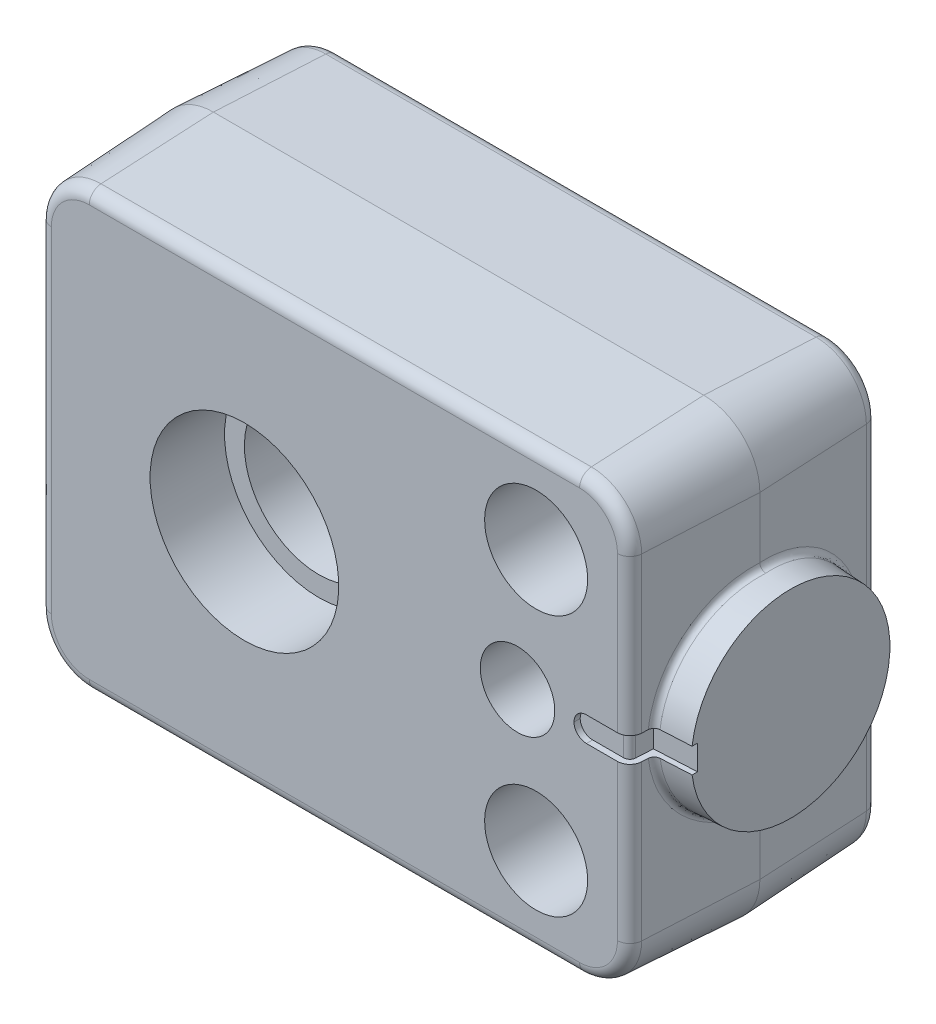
ISO-10303-21;
HEADER;
FILE_DESCRIPTION(('STEP AP214'),'2;1');
FILE_NAME('part.step','',(''),(''),'','','');
FILE_SCHEMA(('AUTOMOTIVE_DESIGN { 1 0 10303 214 1 1 1 1 }'));
ENDSEC;
DATA;
#1=APPLICATION_CONTEXT('core data for automotive mechanical design processes');
#2=APPLICATION_PROTOCOL_DEFINITION('international standard','automotive_design',2000,#1);
#3=PRODUCT_CONTEXT('',#1,'mechanical');
#4=PRODUCT('Part','Part','',(#3));
#5=PRODUCT_RELATED_PRODUCT_CATEGORY('part','',(#4));
#6=PRODUCT_DEFINITION_FORMATION('','',#4);
#7=PRODUCT_DEFINITION_CONTEXT('part definition',#1,'design');
#8=PRODUCT_DEFINITION('design','',#6,#7);
#9=PRODUCT_DEFINITION_SHAPE('','',#8);
#10=(LENGTH_UNIT() NAMED_UNIT(*) SI_UNIT(.MILLI.,.METRE.));
#11=(NAMED_UNIT(*) PLANE_ANGLE_UNIT() SI_UNIT($,.RADIAN.));
#12=(NAMED_UNIT(*) SI_UNIT($,.STERADIAN.) SOLID_ANGLE_UNIT());
#13=UNCERTAINTY_MEASURE_WITH_UNIT(LENGTH_MEASURE(1.E-05),#10,'distance_accuracy_value','');
#14=(GEOMETRIC_REPRESENTATION_CONTEXT(3) GLOBAL_UNCERTAINTY_ASSIGNED_CONTEXT((#13)) GLOBAL_UNIT_ASSIGNED_CONTEXT((#10,
#11,#12)) REPRESENTATION_CONTEXT('',''));
#15=CARTESIAN_POINT('',(0.,0.,0.));
#16=DIRECTION('',(0.,0.,1.));
#17=DIRECTION('',(1.,0.,0.));
#18=AXIS2_PLACEMENT_3D('',#15,#16,#17);
#19=CARTESIAN_POINT('',(-16.5,-17.5,0.));
#20=DIRECTION('',(0.,0.,-1.));
#21=DIRECTION('',(0.,1.,0.));
#22=AXIS2_PLACEMENT_3D('',#19,#20,#21);
#23=PLANE('',#22);
#24=CARTESIAN_POINT('',(23.5,-10.5,0.));
#25=DIRECTION('',(0.,0.,1.));
#26=DIRECTION('',(0.,-1.,0.));
#27=AXIS2_PLACEMENT_3D('',#24,#25,#26);
#28=CIRCLE('',#27,2.3);
#29=CARTESIAN_POINT('',(23.5,-12.8,0.));
#30=VERTEX_POINT('',#29);
#31=EDGE_CURVE('E306',#30,#30,#28,.T.);
#32=ORIENTED_EDGE('',*,*,#31,.T.);
#33=EDGE_LOOP('',(#32));
#34=FACE_BOUND('',#33,.T.);
#35=DIRECTION('',(1.,0.,0.));
#36=VECTOR('',#35,1.);
#37=CARTESIAN_POINT('',(-16.5,-16.5510354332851,0.));
#38=LINE('',#37,#36);
#39=CARTESIAN_POINT('',(27.,-16.5510354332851,0.));
#40=VERTEX_POINT('',#39);
#41=CARTESIAN_POINT('',(-12.5,-16.5510354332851,0.));
#42=VERTEX_POINT('',#41);
#43=EDGE_CURVE('E246',#40,#42,#38,.F.);
#44=ORIENTED_EDGE('',*,*,#43,.T.);
#45=CARTESIAN_POINT('',(-12.5,-13.5,0.));
#46=DIRECTION('',(0.,0.,-1.));
#47=DIRECTION('',(0.,1.,0.));
#48=AXIS2_PLACEMENT_3D('',#45,#46,#47);
#49=CIRCLE('',#48,3.05103543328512);
#50=CARTESIAN_POINT('',(-15.5510354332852,-13.5,0.));
#51=VERTEX_POINT('',#50);
#52=EDGE_CURVE('E285',#42,#51,#49,.T.);
#53=ORIENTED_EDGE('',*,*,#52,.T.);
#54=DIRECTION('',(0.,-1.,0.));
#55=VECTOR('',#54,1.);
#56=CARTESIAN_POINT('',(-15.5510354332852,-17.5,0.));
#57=LINE('',#56,#55);
#58=CARTESIAN_POINT('',(-15.5510354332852,13.5,0.));
#59=VERTEX_POINT('',#58);
#60=EDGE_CURVE('E283',#51,#59,#57,.F.);
#61=ORIENTED_EDGE('',*,*,#60,.T.);
#62=CARTESIAN_POINT('',(-12.5,13.5,0.));
#63=DIRECTION('',(0.,0.,-1.));
#64=DIRECTION('',(0.,1.,0.));
#65=AXIS2_PLACEMENT_3D('',#62,#63,#64);
#66=CIRCLE('',#65,3.05103543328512);
#67=CARTESIAN_POINT('',(-12.5,16.5510354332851,0.));
#68=VERTEX_POINT('',#67);
#69=EDGE_CURVE('E281',#59,#68,#66,.T.);
#70=ORIENTED_EDGE('',*,*,#69,.T.);
#71=DIRECTION('',(-1.,0.,0.));
#72=VECTOR('',#71,1.);
#73=CARTESIAN_POINT('',(-16.5,16.5510354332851,0.));
#74=LINE('',#73,#72);
#75=CARTESIAN_POINT('',(27.,16.5510354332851,0.));
#76=VERTEX_POINT('',#75);
#77=EDGE_CURVE('E279',#68,#76,#74,.F.);
#78=ORIENTED_EDGE('',*,*,#77,.T.);
#79=CARTESIAN_POINT('',(27.,13.5,0.));
#80=DIRECTION('',(0.,0.,-1.));
#81=DIRECTION('',(0.,1.,0.));
#82=AXIS2_PLACEMENT_3D('',#79,#80,#81);
#83=CIRCLE('',#82,3.05103543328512);
#84=CARTESIAN_POINT('',(30.0510354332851,13.5,0.));
#85=VERTEX_POINT('',#84);
#86=EDGE_CURVE('E277',#76,#85,#83,.T.);
#87=ORIENTED_EDGE('',*,*,#86,.T.);
#88=DIRECTION('',(0.,1.,0.));
#89=VECTOR('',#88,1.);
#90=CARTESIAN_POINT('',(30.0510354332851,-17.5,0.));
#91=LINE('',#90,#89);
#92=CARTESIAN_POINT('',(30.0510354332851,-13.5,0.));
#93=VERTEX_POINT('',#92);
#94=EDGE_CURVE('E249',#85,#93,#91,.F.);
#95=ORIENTED_EDGE('',*,*,#94,.T.);
#96=CARTESIAN_POINT('',(27.,-13.5,0.));
#97=DIRECTION('',(0.,0.,-1.));
#98=DIRECTION('',(0.,1.,0.));
#99=AXIS2_PLACEMENT_3D('',#96,#97,#98);
#100=CIRCLE('',#99,3.05103543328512);
#101=EDGE_CURVE('E241',#93,#40,#100,.T.);
#102=ORIENTED_EDGE('',*,*,#101,.T.);
#103=EDGE_LOOP('',(#44,#53,#61,#70,#78,#87,#95,#102));
#104=FACE_BOUND('',#103,.T.);
#105=CARTESIAN_POINT('',(23.5,10.5,0.));
#106=DIRECTION('',(0.,0.,1.));
#107=DIRECTION('',(0.,-1.,0.));
#108=AXIS2_PLACEMENT_3D('',#105,#106,#107);
#109=CIRCLE('',#108,2.3);
#110=CARTESIAN_POINT('',(23.5,8.2,0.));
#111=VERTEX_POINT('',#110);
#112=EDGE_CURVE('E843',#111,#111,#109,.T.);
#113=ORIENTED_EDGE('',*,*,#112,.T.);
#114=EDGE_LOOP('',(#113));
#115=FACE_BOUND('',#114,.T.);
#116=CARTESIAN_POINT('',(0.,0.,0.));
#117=DIRECTION('',(0.,0.,1.));
#118=DIRECTION('',(0.,-1.,0.));
#119=AXIS2_PLACEMENT_3D('',#116,#117,#118);
#120=CIRCLE('',#119,7.6);
#121=CARTESIAN_POINT('',(0.,-7.6,0.));
#122=VERTEX_POINT('',#121);
#123=EDGE_CURVE('E862',#122,#122,#120,.T.);
#124=ORIENTED_EDGE('',*,*,#123,.T.);
#125=EDGE_LOOP('',(#124));
#126=FACE_BOUND('',#125,.T.);
#127=ADVANCED_FACE('F16',(#34,#104,#115,#126),#23,.T.);
#128=CARTESIAN_POINT('',(27.55,0.,12.4957615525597));
#129=DIRECTION('',(0.,0.,1.));
#130=DIRECTION('',(0.,-1.,0.));
#131=AXIS2_PLACEMENT_3D('',#128,#129,#130);
#132=CYLINDRICAL_SURFACE('',#131,1.);
#133=DIRECTION('',(0.,0.,1.));
#134=VECTOR('',#133,1.);
#135=CARTESIAN_POINT('',(27.55,1.,12.4957615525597));
#136=LINE('',#135,#134);
#137=CARTESIAN_POINT('',(27.55,1.,20.));
#138=VERTEX_POINT('',#137);
#139=CARTESIAN_POINT('',(27.55,1.,19.5));
#140=VERTEX_POINT('',#139);
#141=EDGE_CURVE('E705',#138,#140,#136,.F.);
#142=ORIENTED_EDGE('',*,*,#141,.F.);
#143=CARTESIAN_POINT('',(27.55,0.,20.));
#144=DIRECTION('',(0.,0.,-1.));
#145=DIRECTION('',(0.,1.,0.));
#146=AXIS2_PLACEMENT_3D('',#143,#144,#145);
#147=CIRCLE('',#146,1.);
#148=CARTESIAN_POINT('',(26.55,0.,20.));
#149=VERTEX_POINT('',#148);
#150=EDGE_CURVE('E550',#138,#149,#147,.F.);
#151=ORIENTED_EDGE('',*,*,#150,.T.);
#152=DIRECTION('',(0.,0.,1.));
#153=VECTOR('',#152,1.);
#154=CARTESIAN_POINT('',(26.55,0.,12.4957615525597));
#155=LINE('',#154,#153);
#156=CARTESIAN_POINT('',(26.55,0.,19.5));
#157=VERTEX_POINT('',#156);
#158=EDGE_CURVE('E698',#149,#157,#155,.F.);
#159=ORIENTED_EDGE('',*,*,#158,.T.);
#160=CARTESIAN_POINT('',(27.55,0.,19.5));
#161=DIRECTION('',(0.,0.,1.));
#162=DIRECTION('',(-1.,0.,0.));
#163=AXIS2_PLACEMENT_3D('',#160,#161,#162);
#164=CIRCLE('',#163,1.);
#165=EDGE_CURVE('E707',#140,#157,#164,.T.);
#166=ORIENTED_EDGE('',*,*,#165,.F.);
#167=EDGE_LOOP('',(#142,#151,#159,#166));
#168=FACE_BOUND('',#167,.T.);
#169=ADVANCED_FACE('F493',(#168),#132,.F.);
#170=CARTESIAN_POINT('',(27.55,0.,12.4957615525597));
#171=DIRECTION('',(0.,0.,-1.));
#172=DIRECTION('',(0.,1.,0.));
#173=AXIS2_PLACEMENT_3D('',#170,#171,#172);
#174=CYLINDRICAL_SURFACE('',#173,1.);
#175=DIRECTION('',(0.,0.,1.));
#176=VECTOR('',#175,1.);
#177=CARTESIAN_POINT('',(27.55,-1.,12.4957615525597));
#178=LINE('',#177,#176);
#179=CARTESIAN_POINT('',(27.55,-1.,19.5));
#180=VERTEX_POINT('',#179);
#181=CARTESIAN_POINT('',(27.55,-1.,20.));
#182=VERTEX_POINT('',#181);
#183=EDGE_CURVE('E695',#180,#182,#178,.T.);
#184=ORIENTED_EDGE('',*,*,#183,.F.);
#185=CARTESIAN_POINT('',(27.55,0.,19.5));
#186=DIRECTION('',(0.,0.,1.));
#187=DIRECTION('',(-1.,0.,0.));
#188=AXIS2_PLACEMENT_3D('',#185,#186,#187);
#189=CIRCLE('',#188,1.);
#190=EDGE_CURVE('E701',#157,#180,#189,.T.);
#191=ORIENTED_EDGE('',*,*,#190,.F.);
#192=ORIENTED_EDGE('',*,*,#158,.F.);
#193=CARTESIAN_POINT('',(27.55,0.,20.));
#194=DIRECTION('',(0.,0.,-1.));
#195=DIRECTION('',(0.,1.,0.));
#196=AXIS2_PLACEMENT_3D('',#193,#194,#195);
#197=CIRCLE('',#196,1.);
#198=EDGE_CURVE('E703',#149,#182,#197,.F.);
#199=ORIENTED_EDGE('',*,*,#198,.T.);
#200=EDGE_LOOP('',(#184,#191,#192,#199));
#201=FACE_BOUND('',#200,.T.);
#202=ADVANCED_FACE('F500',(#201),#174,.F.);
#203=CARTESIAN_POINT('',(31.,17.5,20.));
#204=DIRECTION('',(0.998629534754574,0.,0.052335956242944));
#205=DIRECTION('',(-0.052335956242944,0.,0.998629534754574));
#206=AXIS2_PLACEMENT_3D('',#203,#204,#205);
#207=PLANE('',#206);
#208=DIRECTION('',(-0.0523359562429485,0.,0.998629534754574));
#209=VECTOR('',#208,1.);
#210=CARTESIAN_POINT('',(31.3902174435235,1.,12.5542076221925));
#211=LINE('',#210,#209);
#212=CARTESIAN_POINT('',(31.0763358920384,1.,18.5434244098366));
#213=VERTEX_POINT('',#212);
#214=CARTESIAN_POINT('',(31.0496649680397,1.,19.0523359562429));
#215=VERTEX_POINT('',#214);
#216=EDGE_CURVE('E375',#213,#215,#211,.T.);
#217=ORIENTED_EDGE('',*,*,#216,.F.);
#218=CARTESIAN_POINT('',(31.5242106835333,0.,9.99746429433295));
#219=DIRECTION('',(0.998629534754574,0.,0.052335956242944));
#220=DIRECTION('',(-0.0523359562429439,0.,0.998629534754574));
#221=AXIS2_PLACEMENT_3D('',#218,#219,#220);
#222=ELLIPSE('',#221,8.61607684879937,8.60423636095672);
#223=CARTESIAN_POINT('',(31.5240777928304,8.60423598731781,10.));
#224=VERTEX_POINT('',#223);
#225=EDGE_CURVE('E537',#213,#224,#222,.F.);
#226=ORIENTED_EDGE('',*,*,#225,.T.);
#227=DIRECTION('',(0.,1.,0.));
#228=VECTOR('',#227,1.);
#229=CARTESIAN_POINT('',(31.5240777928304,17.5,10.));
#230=LINE('',#229,#228);
#231=CARTESIAN_POINT('',(31.5240777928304,13.5,10.));
#232=VERTEX_POINT('',#231);
#233=EDGE_CURVE('E527',#224,#232,#230,.T.);
#234=ORIENTED_EDGE('',*,*,#233,.T.);
#235=DIRECTION('',(0.0523359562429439,0.,-0.998629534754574));
#236=VECTOR('',#235,1.);
#237=CARTESIAN_POINT('',(31.,13.5,20.));
#238=LINE('',#237,#236);
#239=CARTESIAN_POINT('',(31.0496649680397,13.5,19.0523359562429));
#240=VERTEX_POINT('',#239);
#241=EDGE_CURVE('E637',#232,#240,#238,.F.);
#242=ORIENTED_EDGE('',*,*,#241,.T.);
#243=DIRECTION('',(0.,1.,0.));
#244=VECTOR('',#243,1.);
#245=CARTESIAN_POINT('',(31.0496649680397,17.5,19.0523359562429));
#246=LINE('',#245,#244);
#247=EDGE_CURVE('E666',#240,#215,#246,.F.);
#248=ORIENTED_EDGE('',*,*,#247,.T.);
#249=EDGE_LOOP('',(#217,#226,#234,#242,#248));
#250=FACE_BOUND('',#249,.T.);
#251=ADVANCED_FACE('F463',(#250),#207,.T.);
#252=CARTESIAN_POINT('',(-16.5,-17.5,20.));
#253=DIRECTION('',(0.,0.,-1.));
#254=DIRECTION('',(0.,1.,0.));
#255=AXIS2_PLACEMENT_3D('',#252,#253,#254);
#256=PLANE('',#255);
#257=CARTESIAN_POINT('',(22.,0.,20.));
#258=DIRECTION('',(0.,0.,1.));
#259=DIRECTION('',(0.,-1.,0.));
#260=AXIS2_PLACEMENT_3D('',#257,#258,#259);
#261=CIRCLE('',#260,3.);
#262=CARTESIAN_POINT('',(22.,-3.,20.));
#263=VERTEX_POINT('',#262);
#264=EDGE_CURVE('E868',#263,#263,#261,.T.);
#265=ORIENTED_EDGE('',*,*,#264,.F.);
#266=EDGE_LOOP('',(#265));
#267=FACE_BOUND('',#266,.T.);
#268=CARTESIAN_POINT('',(0.,0.,20.));
#269=DIRECTION('',(0.,0.,1.));
#270=DIRECTION('',(0.,-1.,0.));
#271=AXIS2_PLACEMENT_3D('',#268,#269,#270);
#272=CIRCLE('',#271,7.6);
#273=CARTESIAN_POINT('',(0.,-7.6,20.));
#274=VERTEX_POINT('',#273);
#275=EDGE_CURVE('E856',#274,#274,#272,.T.);
#276=ORIENTED_EDGE('',*,*,#275,.F.);
#277=EDGE_LOOP('',(#276));
#278=FACE_BOUND('',#277,.T.);
#279=CARTESIAN_POINT('',(23.5,10.5,20.));
#280=DIRECTION('',(0.,0.,1.));
#281=DIRECTION('',(0.,-1.,0.));
#282=AXIS2_PLACEMENT_3D('',#279,#280,#281);
#283=CIRCLE('',#282,4.15);
#284=CARTESIAN_POINT('',(23.5,6.35,20.));
#285=VERTEX_POINT('',#284);
#286=EDGE_CURVE('E852',#285,#285,#283,.T.);
#287=ORIENTED_EDGE('',*,*,#286,.F.);
#288=EDGE_LOOP('',(#287));
#289=FACE_BOUND('',#288,.T.);
#290=CARTESIAN_POINT('',(23.5,-10.5,20.));
#291=DIRECTION('',(0.,0.,1.));
#292=DIRECTION('',(0.,-1.,0.));
#293=AXIS2_PLACEMENT_3D('',#290,#291,#292);
#294=CIRCLE('',#293,4.15);
#295=CARTESIAN_POINT('',(23.5,-14.65,20.));
#296=VERTEX_POINT('',#295);
#297=EDGE_CURVE('E840',#296,#296,#294,.T.);
#298=ORIENTED_EDGE('',*,*,#297,.F.);
#299=EDGE_LOOP('',(#298));
#300=FACE_BOUND('',#299,.T.);
#301=DIRECTION('',(-1.,0.,0.));
#302=VECTOR('',#301,1.);
#303=CARTESIAN_POINT('',(30.275,1.,20.));
#304=LINE('',#303,#302);
#305=CARTESIAN_POINT('',(30.0510354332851,1.,20.));
#306=VERTEX_POINT('',#305);
#307=EDGE_CURVE('E379',#306,#138,#304,.T.);
#308=ORIENTED_EDGE('',*,*,#307,.F.);
#309=DIRECTION('',(0.,-1.,0.));
#310=VECTOR('',#309,1.);
#311=CARTESIAN_POINT('',(30.0510354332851,-17.5,20.));
#312=LINE('',#311,#310);
#313=CARTESIAN_POINT('',(30.0510354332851,13.5,20.));
#314=VERTEX_POINT('',#313);
#315=EDGE_CURVE('E647',#306,#314,#312,.F.);
#316=ORIENTED_EDGE('',*,*,#315,.T.);
#317=CARTESIAN_POINT('',(27.,13.5,20.));
#318=DIRECTION('',(0.,0.,-1.));
#319=DIRECTION('',(0.,1.,0.));
#320=AXIS2_PLACEMENT_3D('',#317,#318,#319);
#321=CIRCLE('',#320,3.05103543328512);
#322=CARTESIAN_POINT('',(27.,16.5510354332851,20.));
#323=VERTEX_POINT('',#322);
#324=EDGE_CURVE('E651',#314,#323,#321,.F.);
#325=ORIENTED_EDGE('',*,*,#324,.T.);
#326=DIRECTION('',(1.,0.,0.));
#327=VECTOR('',#326,1.);
#328=CARTESIAN_POINT('',(-16.5,16.5510354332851,20.));
#329=LINE('',#328,#327);
#330=CARTESIAN_POINT('',(-12.5,16.5510354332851,20.));
#331=VERTEX_POINT('',#330);
#332=EDGE_CURVE('E653',#323,#331,#329,.F.);
#333=ORIENTED_EDGE('',*,*,#332,.T.);
#334=CARTESIAN_POINT('',(-12.5,13.5,20.));
#335=DIRECTION('',(0.,0.,-1.));
#336=DIRECTION('',(0.,1.,0.));
#337=AXIS2_PLACEMENT_3D('',#334,#335,#336);
#338=CIRCLE('',#337,3.05103543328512);
#339=CARTESIAN_POINT('',(-15.5510354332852,13.5,20.));
#340=VERTEX_POINT('',#339);
#341=EDGE_CURVE('E655',#331,#340,#338,.F.);
#342=ORIENTED_EDGE('',*,*,#341,.T.);
#343=DIRECTION('',(0.,1.,0.));
#344=VECTOR('',#343,1.);
#345=CARTESIAN_POINT('',(-15.5510354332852,-17.5,20.));
#346=LINE('',#345,#344);
#347=CARTESIAN_POINT('',(-15.5510354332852,-13.5,20.));
#348=VERTEX_POINT('',#347);
#349=EDGE_CURVE('E657',#340,#348,#346,.F.);
#350=ORIENTED_EDGE('',*,*,#349,.T.);
#351=CARTESIAN_POINT('',(-12.5,-13.5,20.));
#352=DIRECTION('',(0.,0.,-1.));
#353=DIRECTION('',(0.,1.,0.));
#354=AXIS2_PLACEMENT_3D('',#351,#352,#353);
#355=CIRCLE('',#354,3.05103543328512);
#356=CARTESIAN_POINT('',(-12.5,-16.5510354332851,20.));
#357=VERTEX_POINT('',#356);
#358=EDGE_CURVE('E602',#348,#357,#355,.F.);
#359=ORIENTED_EDGE('',*,*,#358,.T.);
#360=DIRECTION('',(-1.,0.,0.));
#361=VECTOR('',#360,1.);
#362=CARTESIAN_POINT('',(-16.5,-16.5510354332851,20.));
#363=LINE('',#362,#361);
#364=CARTESIAN_POINT('',(27.,-16.5510354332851,20.));
#365=VERTEX_POINT('',#364);
#366=EDGE_CURVE('E643',#357,#365,#363,.F.);
#367=ORIENTED_EDGE('',*,*,#366,.T.);
#368=CARTESIAN_POINT('',(27.,-13.5,20.));
#369=DIRECTION('',(0.,0.,-1.));
#370=DIRECTION('',(0.,1.,0.));
#371=AXIS2_PLACEMENT_3D('',#368,#369,#370);
#372=CIRCLE('',#371,3.05103543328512);
#373=CARTESIAN_POINT('',(30.0510354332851,-13.5,20.));
#374=VERTEX_POINT('',#373);
#375=EDGE_CURVE('E645',#365,#374,#372,.F.);
#376=ORIENTED_EDGE('',*,*,#375,.T.);
#377=CARTESIAN_POINT('',(30.0510354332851,-1.,20.));
#378=VERTEX_POINT('',#377);
#379=EDGE_CURVE('E648',#374,#378,#312,.F.);
#380=ORIENTED_EDGE('',*,*,#379,.T.);
#381=DIRECTION('',(-1.,0.,0.));
#382=VECTOR('',#381,1.);
#383=CARTESIAN_POINT('',(30.275,-1.,20.));
#384=LINE('',#383,#382);
#385=EDGE_CURVE('E396',#378,#182,#384,.T.);
#386=ORIENTED_EDGE('',*,*,#385,.T.);
#387=ORIENTED_EDGE('',*,*,#198,.F.);
#388=ORIENTED_EDGE('',*,*,#150,.F.);
#389=EDGE_LOOP('',(#308,#316,#325,#333,#342,#350,#359,#367,#376,#380,#386,#387,#388));
#390=FACE_BOUND('',#389,.T.);
#391=ADVANCED_FACE('F715',(#267,#278,#289,#300,#390),#256,.F.);
#392=CARTESIAN_POINT('',(30.0510354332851,-17.5,19.));
#393=DIRECTION('',(0.,-1.,0.));
#394=DIRECTION('',(0.,0.,-1.));
#395=AXIS2_PLACEMENT_3D('',#392,#393,#394);
#396=CYLINDRICAL_SURFACE('',#395,1.);
#397=ORIENTED_EDGE('',*,*,#315,.F.);
#398=CARTESIAN_POINT('',(30.0510354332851,1.,19.));
#399=DIRECTION('',(0.,-1.,0.));
#400=DIRECTION('',(0.,0.,-1.));
#401=AXIS2_PLACEMENT_3D('',#398,#399,#400);
#402=CIRCLE('',#401,1.);
#403=EDGE_CURVE('E377',#215,#306,#402,.T.);
#404=ORIENTED_EDGE('',*,*,#403,.F.);
#405=ORIENTED_EDGE('',*,*,#247,.F.);
#406=CARTESIAN_POINT('',(30.0510354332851,13.5,19.));
#407=DIRECTION('',(0.,-1.,0.));
#408=DIRECTION('',(0.,0.,-1.));
#409=AXIS2_PLACEMENT_3D('',#406,#407,#408);
#410=CIRCLE('',#409,1.);
#411=EDGE_CURVE('E685',#240,#314,#410,.T.);
#412=ORIENTED_EDGE('',*,*,#411,.T.);
#413=EDGE_LOOP('',(#397,#404,#405,#412));
#414=FACE_BOUND('',#413,.T.);
#415=ADVANCED_FACE('F570',(#414),#396,.T.);
#416=CARTESIAN_POINT('',(34.,3.13139604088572,10.));
#417=DIRECTION('',(-1.,0.,0.));
#418=DIRECTION('',(0.,0.,-1.));
#419=AXIS2_PLACEMENT_3D('',#416,#417,#418);
#420=PLANE('',#419);
#421=DIRECTION('',(0.,0.,1.));
#422=VECTOR('',#421,1.);
#423=CARTESIAN_POINT('',(34.,1.,10.));
#424=LINE('',#423,#422);
#425=CARTESIAN_POINT('',(34.,1.,17.499313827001));
#426=VERTEX_POINT('',#425);
#427=CARTESIAN_POINT('',(34.,1.,17.9372539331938));
#428=VERTEX_POINT('',#427);
#429=EDGE_CURVE('E692',#426,#428,#424,.T.);
#430=ORIENTED_EDGE('',*,*,#429,.F.);
#431=DIRECTION('',(0.,-1.,0.));
#432=VECTOR('',#431,1.);
#433=CARTESIAN_POINT('',(34.,1.,17.499313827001));
#434=LINE('',#433,#432);
#435=CARTESIAN_POINT('',(34.,-1.,17.499313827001));
#436=VERTEX_POINT('',#435);
#437=EDGE_CURVE('E405',#426,#436,#434,.T.);
#438=ORIENTED_EDGE('',*,*,#437,.T.);
#439=DIRECTION('',(0.,0.,1.));
#440=VECTOR('',#439,1.);
#441=CARTESIAN_POINT('',(34.,-1.,10.));
#442=LINE('',#441,#440);
#443=CARTESIAN_POINT('',(34.,-1.,17.9372539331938));
#444=VERTEX_POINT('',#443);
#445=EDGE_CURVE('E673',#436,#444,#442,.T.);
#446=ORIENTED_EDGE('',*,*,#445,.T.);
#447=CARTESIAN_POINT('',(34.,0.,10.));
#448=DIRECTION('',(-1.,0.,0.));
#449=DIRECTION('',(0.,0.,-1.));
#450=AXIS2_PLACEMENT_3D('',#447,#448,#449);
#451=CIRCLE('',#450,8.);
#452=EDGE_CURVE('E624',#428,#444,#451,.T.);
#453=ORIENTED_EDGE('',*,*,#452,.F.);
#454=EDGE_LOOP('',(#430,#438,#446,#453));
#455=FACE_BOUND('',#454,.T.);
#456=ADVANCED_FACE('F462',(#455),#420,.F.);
#457=CARTESIAN_POINT('',(31.5240777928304,-13.5,10.));
#458=VERTEX_POINT('',#457);
#459=CARTESIAN_POINT('',(31.5240777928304,-8.60423598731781,10.));
#460=VERTEX_POINT('',#459);
#461=EDGE_CURVE('E524',#458,#460,#230,.T.);
#462=ORIENTED_EDGE('',*,*,#461,.T.);
#463=CARTESIAN_POINT('',(31.5242106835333,0.,9.99746429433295));
#464=DIRECTION('',(0.998629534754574,0.,0.052335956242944));
#465=DIRECTION('',(-0.0523359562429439,0.,0.998629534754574));
#466=AXIS2_PLACEMENT_3D('',#463,#464,#465);
#467=ELLIPSE('',#466,8.61607684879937,8.60423636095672);
#468=CARTESIAN_POINT('',(31.0763358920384,-1.,18.5434244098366));
#469=VERTEX_POINT('',#468);
#470=EDGE_CURVE('E36',#460,#469,#467,.F.);
#471=ORIENTED_EDGE('',*,*,#470,.T.);
#472=DIRECTION('',(0.052335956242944,0.,-0.998629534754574));
#473=VECTOR('',#472,1.);
#474=CARTESIAN_POINT('',(31.,-1.,20.));
#475=LINE('',#474,#473);
#476=CARTESIAN_POINT('',(31.0496649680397,-1.,19.0523359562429));
#477=VERTEX_POINT('',#476);
#478=EDGE_CURVE('E419',#469,#477,#475,.F.);
#479=ORIENTED_EDGE('',*,*,#478,.T.);
#480=CARTESIAN_POINT('',(31.0496649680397,-13.5,19.0523359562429));
#481=VERTEX_POINT('',#480);
#482=EDGE_CURVE('E665',#477,#481,#246,.F.);
#483=ORIENTED_EDGE('',*,*,#482,.T.);
#484=DIRECTION('',(0.0523359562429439,0.,-0.998629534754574));
#485=VECTOR('',#484,1.);
#486=CARTESIAN_POINT('',(31.,-13.5,20.));
#487=LINE('',#486,#485);
#488=EDGE_CURVE('E640',#481,#458,#487,.T.);
#489=ORIENTED_EDGE('',*,*,#488,.T.);
#490=EDGE_LOOP('',(#462,#471,#479,#483,#489));
#491=FACE_BOUND('',#490,.T.);
#492=ADVANCED_FACE('F456',(#491),#207,.T.);
#493=CARTESIAN_POINT('',(31.,-17.5,20.));
#494=DIRECTION('',(0.,-0.998629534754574,0.052335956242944));
#495=DIRECTION('',(0.,-0.052335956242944,-0.998629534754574));
#496=AXIS2_PLACEMENT_3D('',#493,#494,#495);
#497=PLANE('',#496);
#498=DIRECTION('',(0.,-0.0523359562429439,-0.998629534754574));
#499=VECTOR('',#498,1.);
#500=CARTESIAN_POINT('',(27.,-17.5,20.));
#501=LINE('',#500,#499);
#502=CARTESIAN_POINT('',(27.,-18.0240777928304,10.));
#503=VERTEX_POINT('',#502);
#504=CARTESIAN_POINT('',(27.,-17.5496649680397,19.0523359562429));
#505=VERTEX_POINT('',#504);
#506=EDGE_CURVE('E636',#503,#505,#501,.F.);
#507=ORIENTED_EDGE('',*,*,#506,.T.);
#508=DIRECTION('',(1.,0.,0.));
#509=VECTOR('',#508,1.);
#510=CARTESIAN_POINT('',(31.,-17.5496649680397,19.0523359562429));
#511=LINE('',#510,#509);
#512=CARTESIAN_POINT('',(-12.5,-17.5496649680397,19.0523359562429));
#513=VERTEX_POINT('',#512);
#514=EDGE_CURVE('E671',#505,#513,#511,.F.);
#515=ORIENTED_EDGE('',*,*,#514,.T.);
#516=DIRECTION('',(0.,-0.0523359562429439,-0.998629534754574));
#517=VECTOR('',#516,1.);
#518=CARTESIAN_POINT('',(-12.5,-17.5,20.));
#519=LINE('',#518,#517);
#520=CARTESIAN_POINT('',(-12.5,-18.0240777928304,10.));
#521=VERTEX_POINT('',#520);
#522=EDGE_CURVE('E619',#513,#521,#519,.T.);
#523=ORIENTED_EDGE('',*,*,#522,.T.);
#524=DIRECTION('',(1.,0.,0.));
#525=VECTOR('',#524,1.);
#526=CARTESIAN_POINT('',(31.,-18.0240777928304,10.));
#527=LINE('',#526,#525);
#528=EDGE_CURVE('E320',#521,#503,#527,.T.);
#529=ORIENTED_EDGE('',*,*,#528,.T.);
#530=EDGE_LOOP('',(#507,#515,#523,#529));
#531=FACE_BOUND('',#530,.T.);
#532=ADVANCED_FACE('F461',(#531),#497,.T.);
#533=CARTESIAN_POINT('',(31.,17.5,20.));
#534=DIRECTION('',(0.,0.998629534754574,0.052335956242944));
#535=DIRECTION('',(0.,-0.052335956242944,0.998629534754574));
#536=AXIS2_PLACEMENT_3D('',#533,#534,#535);
#537=PLANE('',#536);
#538=DIRECTION('',(0.,0.0523359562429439,-0.998629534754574));
#539=VECTOR('',#538,1.);
#540=CARTESIAN_POINT('',(-12.5,17.5,20.));
#541=LINE('',#540,#539);
#542=CARTESIAN_POINT('',(-12.5,18.0240777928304,10.));
#543=VERTEX_POINT('',#542);
#544=CARTESIAN_POINT('',(-12.5,17.5496649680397,19.0523359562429));
#545=VERTEX_POINT('',#544);
#546=EDGE_CURVE('E633',#543,#545,#541,.F.);
#547=ORIENTED_EDGE('',*,*,#546,.T.);
#548=DIRECTION('',(-1.,0.,0.));
#549=VECTOR('',#548,1.);
#550=CARTESIAN_POINT('',(31.,17.5496649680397,19.0523359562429));
#551=LINE('',#550,#549);
#552=CARTESIAN_POINT('',(27.,17.5496649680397,19.0523359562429));
#553=VERTEX_POINT('',#552);
#554=EDGE_CURVE('E661',#545,#553,#551,.F.);
#555=ORIENTED_EDGE('',*,*,#554,.T.);
#556=DIRECTION('',(0.,0.0523359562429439,-0.998629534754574));
#557=VECTOR('',#556,1.);
#558=CARTESIAN_POINT('',(27.,17.5,20.));
#559=LINE('',#558,#557);
#560=CARTESIAN_POINT('',(27.,18.0240777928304,10.));
#561=VERTEX_POINT('',#560);
#562=EDGE_CURVE('E626',#553,#561,#559,.T.);
#563=ORIENTED_EDGE('',*,*,#562,.T.);
#564=DIRECTION('',(-1.,0.,0.));
#565=VECTOR('',#564,1.);
#566=CARTESIAN_POINT('',(31.,18.0240777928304,10.));
#567=LINE('',#566,#565);
#568=EDGE_CURVE('E775',#561,#543,#567,.T.);
#569=ORIENTED_EDGE('',*,*,#568,.T.);
#570=EDGE_LOOP('',(#547,#555,#563,#569));
#571=FACE_BOUND('',#570,.T.);
#572=ADVANCED_FACE('F465',(#571),#537,.T.);
#573=CARTESIAN_POINT('',(-16.5,-17.5,20.));
#574=DIRECTION('',(-0.998629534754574,0.,0.052335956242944));
#575=DIRECTION('',(-0.052335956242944,0.,-0.998629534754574));
#576=AXIS2_PLACEMENT_3D('',#573,#574,#575);
#577=PLANE('',#576);
#578=DIRECTION('',(-0.0523359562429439,0.,-0.998629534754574));
#579=VECTOR('',#578,1.);
#580=CARTESIAN_POINT('',(-16.5,-13.5,20.));
#581=LINE('',#580,#579);
#582=CARTESIAN_POINT('',(-17.0240777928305,-13.5,10.));
#583=VERTEX_POINT('',#582);
#584=CARTESIAN_POINT('',(-16.5496649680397,-13.5,19.0523359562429));
#585=VERTEX_POINT('',#584);
#586=EDGE_CURVE('E617',#583,#585,#581,.F.);
#587=ORIENTED_EDGE('',*,*,#586,.T.);
#588=DIRECTION('',(0.,-1.,0.));
#589=VECTOR('',#588,1.);
#590=CARTESIAN_POINT('',(-16.5496649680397,-17.5,19.0523359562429));
#591=LINE('',#590,#589);
#592=CARTESIAN_POINT('',(-16.5496649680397,13.5,19.0523359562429));
#593=VERTEX_POINT('',#592);
#594=EDGE_CURVE('E608',#585,#593,#591,.F.);
#595=ORIENTED_EDGE('',*,*,#594,.T.);
#596=DIRECTION('',(-0.0523359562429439,0.,-0.998629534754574));
#597=VECTOR('',#596,1.);
#598=CARTESIAN_POINT('',(-16.5,13.5,20.));
#599=LINE('',#598,#597);
#600=CARTESIAN_POINT('',(-17.0240777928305,13.5,10.));
#601=VERTEX_POINT('',#600);
#602=EDGE_CURVE('E623',#593,#601,#599,.T.);
#603=ORIENTED_EDGE('',*,*,#602,.T.);
#604=DIRECTION('',(0.,-1.,0.));
#605=VECTOR('',#604,1.);
#606=CARTESIAN_POINT('',(-17.0240777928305,-17.5,10.));
#607=LINE('',#606,#605);
#608=EDGE_CURVE('E622',#601,#583,#607,.T.);
#609=ORIENTED_EDGE('',*,*,#608,.T.);
#610=EDGE_LOOP('',(#587,#595,#603,#609));
#611=FACE_BOUND('',#610,.T.);
#612=ADVANCED_FACE('F469',(#611),#577,.T.);
#613=CARTESIAN_POINT('',(-12.5,13.5,20.));
#614=DIRECTION('',(0.,0.,-1.));
#615=DIRECTION('',(0.,1.,0.));
#616=AXIS2_PLACEMENT_3D('',#613,#614,#615);
#617=CONICAL_SURFACE('',#616,4.,0.05235987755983);
#618=ORIENTED_EDGE('',*,*,#602,.F.);
#619=CARTESIAN_POINT('',(-12.5,13.5,19.0523359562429));
#620=DIRECTION('',(0.,0.,-1.));
#621=DIRECTION('',(0.,1.,0.));
#622=AXIS2_PLACEMENT_3D('',#619,#620,#621);
#623=CIRCLE('',#622,4.04966496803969);
#624=EDGE_CURVE('E612',#593,#545,#623,.T.);
#625=ORIENTED_EDGE('',*,*,#624,.T.);
#626=ORIENTED_EDGE('',*,*,#546,.F.);
#627=CARTESIAN_POINT('',(-12.5,13.5,10.));
#628=DIRECTION('',(0.,0.,-1.));
#629=DIRECTION('',(0.,1.,0.));
#630=AXIS2_PLACEMENT_3D('',#627,#628,#629);
#631=CIRCLE('',#630,4.52407779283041);
#632=EDGE_CURVE('E778',#543,#601,#631,.F.);
#633=ORIENTED_EDGE('',*,*,#632,.T.);
#634=EDGE_LOOP('',(#618,#625,#626,#633));
#635=FACE_BOUND('',#634,.T.);
#636=ADVANCED_FACE('F475',(#635),#617,.T.);
#637=CARTESIAN_POINT('',(-12.5,-13.5,20.));
#638=DIRECTION('',(0.,0.,-1.));
#639=DIRECTION('',(0.,1.,0.));
#640=AXIS2_PLACEMENT_3D('',#637,#638,#639);
#641=CONICAL_SURFACE('',#640,4.,0.05235987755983);
#642=ORIENTED_EDGE('',*,*,#522,.F.);
#643=CARTESIAN_POINT('',(-12.5,-13.5,19.0523359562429));
#644=DIRECTION('',(0.,0.,-1.));
#645=DIRECTION('',(0.,1.,0.));
#646=AXIS2_PLACEMENT_3D('',#643,#644,#645);
#647=CIRCLE('',#646,4.04966496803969);
#648=EDGE_CURVE('E599',#513,#585,#647,.T.);
#649=ORIENTED_EDGE('',*,*,#648,.T.);
#650=ORIENTED_EDGE('',*,*,#586,.F.);
#651=CARTESIAN_POINT('',(-12.5,-13.5,10.));
#652=DIRECTION('',(0.,0.,-1.));
#653=DIRECTION('',(0.,1.,0.));
#654=AXIS2_PLACEMENT_3D('',#651,#652,#653);
#655=CIRCLE('',#654,4.52407779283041);
#656=EDGE_CURVE('E764',#583,#521,#655,.F.);
#657=ORIENTED_EDGE('',*,*,#656,.T.);
#658=EDGE_LOOP('',(#642,#649,#650,#657));
#659=FACE_BOUND('',#658,.T.);
#660=ADVANCED_FACE('F471',(#659),#641,.T.);
#661=CARTESIAN_POINT('',(27.,-13.5,20.));
#662=DIRECTION('',(0.,0.,-1.));
#663=DIRECTION('',(0.,1.,0.));
#664=AXIS2_PLACEMENT_3D('',#661,#662,#663);
#665=CONICAL_SURFACE('',#664,4.,0.05235987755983);
#666=ORIENTED_EDGE('',*,*,#488,.F.);
#667=CARTESIAN_POINT('',(27.,-13.5,19.0523359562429));
#668=DIRECTION('',(0.,0.,-1.));
#669=DIRECTION('',(0.,1.,0.));
#670=AXIS2_PLACEMENT_3D('',#667,#668,#669);
#671=CIRCLE('',#670,4.04966496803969);
#672=EDGE_CURVE('E669',#481,#505,#671,.T.);
#673=ORIENTED_EDGE('',*,*,#672,.T.);
#674=ORIENTED_EDGE('',*,*,#506,.F.);
#675=CARTESIAN_POINT('',(27.,-13.5,10.));
#676=DIRECTION('',(0.,0.,-1.));
#677=DIRECTION('',(0.,1.,0.));
#678=AXIS2_PLACEMENT_3D('',#675,#676,#677);
#679=CIRCLE('',#678,4.52407779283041);
#680=EDGE_CURVE('E755',#503,#458,#679,.F.);
#681=ORIENTED_EDGE('',*,*,#680,.T.);
#682=EDGE_LOOP('',(#666,#673,#674,#681));
#683=FACE_BOUND('',#682,.T.);
#684=ADVANCED_FACE('F474',(#683),#665,.T.);
#685=CARTESIAN_POINT('',(27.,13.5,20.));
#686=DIRECTION('',(0.,0.,-1.));
#687=DIRECTION('',(0.,1.,0.));
#688=AXIS2_PLACEMENT_3D('',#685,#686,#687);
#689=CONICAL_SURFACE('',#688,4.,0.05235987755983);
#690=ORIENTED_EDGE('',*,*,#562,.F.);
#691=CARTESIAN_POINT('',(27.,13.5,19.0523359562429));
#692=DIRECTION('',(0.,0.,-1.));
#693=DIRECTION('',(0.,1.,0.));
#694=AXIS2_PLACEMENT_3D('',#691,#692,#693);
#695=CIRCLE('',#694,4.04966496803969);
#696=EDGE_CURVE('E663',#553,#240,#695,.T.);
#697=ORIENTED_EDGE('',*,*,#696,.T.);
#698=ORIENTED_EDGE('',*,*,#241,.F.);
#699=CARTESIAN_POINT('',(27.,13.5,10.));
#700=DIRECTION('',(0.,0.,-1.));
#701=DIRECTION('',(0.,1.,0.));
#702=AXIS2_PLACEMENT_3D('',#699,#700,#701);
#703=CIRCLE('',#702,4.52407779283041);
#704=EDGE_CURVE('E767',#232,#561,#703,.F.);
#705=ORIENTED_EDGE('',*,*,#704,.T.);
#706=EDGE_LOOP('',(#690,#697,#698,#705));
#707=FACE_BOUND('',#706,.T.);
#708=ADVANCED_FACE('F477',(#707),#689,.T.);
#709=CARTESIAN_POINT('',(34.,0.,10.));
#710=DIRECTION('',(-1.,0.,0.));
#711=DIRECTION('',(0.,0.,-1.));
#712=AXIS2_PLACEMENT_3D('',#709,#710,#711);
#713=CONICAL_SURFACE('',#712,8.,0.052359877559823);
#714=CARTESIAN_POINT('',(37.0455675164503,-1.,17.7763547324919));
#715=CARTESIAN_POINT('',(35.1879401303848,-1.,17.8745084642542));
#716=CARTESIAN_POINT('',(33.3303113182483,-1.,17.9726351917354));
#717=CARTESIAN_POINT('',(29.6150508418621,-1.,18.1688346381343));
#718=CARTESIAN_POINT('',(27.7574191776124,-1.,18.2669073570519));
#719=CARTESIAN_POINT('',(25.8997860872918,-1.,18.3649530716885));
#720=B_SPLINE_CURVE_WITH_KNOTS('',3,(#714,#715,#716,#717,#718,#719),.UNSPECIFIED.,.F.,.F.,(4,2,
4),(0.,5.58065613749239,11.1613122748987),.UNSPECIFIED.);
#721=CARTESIAN_POINT('',(31.5498711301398,-1.,18.0666586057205));
#722=VERTEX_POINT('',#721);
#723=EDGE_CURVE('E404',#444,#722,#720,.T.);
#724=ORIENTED_EDGE('',*,*,#723,.T.);
#725=CARTESIAN_POINT('',(31.5464268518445,0.,18.1285863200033));
#726=CARTESIAN_POINT('',(31.0968418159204,0.,18.152148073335));
#727=CARTESIAN_POINT('',(31.0732800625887,0.,18.6017331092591));
#728=CARTESIAN_POINT('',(31.5464268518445,-0.353705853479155,18.1285863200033));
#729=CARTESIAN_POINT('',(31.0968418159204,-0.355761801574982,18.152148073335));
#730=CARTESIAN_POINT('',(31.0732800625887,-0.37543294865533,18.6017331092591));
#731=CARTESIAN_POINT('',(31.547716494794,-0.707411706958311,18.1053986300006));
#732=CARTESIAN_POINT('',(31.0980677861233,-0.711571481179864,18.128755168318));
#733=CARTESIAN_POINT('',(31.0745697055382,-0.750865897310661,18.577125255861));
#734=CARTESIAN_POINT('',(31.552852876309,-1.40876818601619,18.0130472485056));
#735=CARTESIAN_POINT('',(31.1029489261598,-1.41695771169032,18.0356174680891));
#736=CARTESIAN_POINT('',(31.0797060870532,-1.49530783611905,18.4791172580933));
#737=CARTESIAN_POINT('',(31.5566997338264,-1.75641852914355,17.9438814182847));
#738=CARTESIAN_POINT('',(31.1066055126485,-1.76662652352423,17.965845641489));
#739=CARTESIAN_POINT('',(31.0835529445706,-1.86431652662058,18.4057148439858));
#740=CARTESIAN_POINT('',(31.5668846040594,-2.43971316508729,17.7607605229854));
#741=CARTESIAN_POINT('',(31.1162829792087,-2.45370866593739,17.7811885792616));
#742=CARTESIAN_POINT('',(31.0937378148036,-2.58959653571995,18.2113759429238));
#743=CARTESIAN_POINT('',(31.5732228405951,-2.77535637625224,17.6468014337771));
#744=CARTESIAN_POINT('',(31.1223065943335,-2.79120402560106,17.6662511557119));
#745=CARTESIAN_POINT('',(31.1000760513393,-2.94586670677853,18.0904351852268));
#746=CARTESIAN_POINT('',(31.588281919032,-3.428892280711,17.3760475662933));
#747=CARTESIAN_POINT('',(31.1366122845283,-3.44813745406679,17.3932823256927));
#748=CARTESIAN_POINT('',(31.1151351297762,-3.63957476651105,17.8030908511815));
#749=CARTESIAN_POINT('',(31.5970030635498,-3.74678271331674,17.2192473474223));
#750=CARTESIAN_POINT('',(31.1448982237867,-3.76764132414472,17.2351771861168));
#751=CARTESIAN_POINT('',(31.123856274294,-3.97701025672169,17.6366815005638));
#752=CARTESIAN_POINT('',(31.6166786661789,-4.35937325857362,16.8654978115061));
#753=CARTESIAN_POINT('',(31.1635837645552,-4.38311160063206,16.8786358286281));
#754=CARTESIAN_POINT('',(31.1435318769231,-4.62727668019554,17.2612486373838));
#755=CARTESIAN_POINT('',(31.6276334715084,-4.6540697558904,16.6685422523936));
#756=CARTESIAN_POINT('',(31.1739880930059,-4.67912275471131,16.6801094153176));
#757=CARTESIAN_POINT('',(31.1544866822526,-4.94010377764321,17.052218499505));
#758=CARTESIAN_POINT('',(31.6515889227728,-5.21523029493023,16.2378554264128));
#759=CARTESIAN_POINT('',(31.1967292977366,-5.24254391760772,16.2461813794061));
#760=CARTESIAN_POINT('',(31.178442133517,-5.53580232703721,16.5951212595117));
#761=CARTESIAN_POINT('',(31.6645899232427,-5.48168943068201,16.0041177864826));
#762=CARTESIAN_POINT('',(31.2090714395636,-5.50997430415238,16.0106792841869));
#763=CARTESIAN_POINT('',(31.1914431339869,-5.81866857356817,16.3470473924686));
#764=CARTESIAN_POINT('',(31.6924153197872,-5.98181690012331,15.5038690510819));
#765=CARTESIAN_POINT('',(31.2354741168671,-6.01167368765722,15.5068861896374));
#766=CARTESIAN_POINT('',(31.2192685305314,-6.34960683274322,15.8161071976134));
#767=CARTESIAN_POINT('',(31.7072400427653,-6.21547933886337,15.2373520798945));
#768=CARTESIAN_POINT('',(31.2495400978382,-6.24593711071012,15.2384912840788));
#769=CARTESIAN_POINT('',(31.2340932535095,-6.59767259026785,15.5332346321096));
#770=CARTESIAN_POINT('',(31.7384592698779,-6.64601665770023,14.6761071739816));
#771=CARTESIAN_POINT('',(31.2791471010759,-6.67732329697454,14.6735560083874));
#772=CARTESIAN_POINT('',(31.2653124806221,-7.05476633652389,14.9375362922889));
#773=CARTESIAN_POINT('',(31.7548540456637,-6.8428851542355,14.3813743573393));
#774=CARTESIAN_POINT('',(31.2946933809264,-6.87441478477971,14.3769153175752));
#775=CARTESIAN_POINT('',(31.2817072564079,-7.26378755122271,14.6247053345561));
#776=CARTESIAN_POINT('',(31.7889329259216,-7.19646760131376,13.7687423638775));
#777=CARTESIAN_POINT('',(31.3269927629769,-7.22812562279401,13.76060639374));
#778=CARTESIAN_POINT('',(31.3157861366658,-7.63921614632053,13.9744415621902));
#779=CARTESIAN_POINT('',(31.8066172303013,-7.35317530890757,13.4508395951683));
#780=CARTESIAN_POINT('',(31.3437505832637,-7.38469004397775,13.4408481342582));
#781=CARTESIAN_POINT('',(31.3334704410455,-7.80561690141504,13.637004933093));
#782=CARTESIAN_POINT('',(31.8429726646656,-7.62375638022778,12.7973081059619));
#783=CARTESIAN_POINT('',(31.3781846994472,-7.65471806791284,12.7838060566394));
#784=CARTESIAN_POINT('',(31.3698258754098,-8.09295704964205,12.9433019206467));
#785=CARTESIAN_POINT('',(31.8616439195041,-7.73762430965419,12.4616771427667));
#786=CARTESIAN_POINT('',(31.3958648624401,-7.76810677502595,12.4464484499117));
#787=CARTESIAN_POINT('',(31.3884971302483,-8.21389067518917,12.5870331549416));
#788=CARTESIAN_POINT('',(31.8996538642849,-7.92057891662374,11.7784324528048));
#789=CARTESIAN_POINT('',(31.4318402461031,-7.94989981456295,11.7599972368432));
#790=CARTESIAN_POINT('',(31.4265070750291,-8.40822626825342,11.8617602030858));
#791=CARTESIAN_POINT('',(31.9189926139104,-7.98966157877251,11.4308176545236));
#792=CARTESIAN_POINT('',(31.4501382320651,-8.01821434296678,11.4108508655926));
#793=CARTESIAN_POINT('',(31.4458458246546,-8.4816239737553,11.4927548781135));
#794=CARTESIAN_POINT('',(31.9580067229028,-8.08186484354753,10.729553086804));
#795=CARTESIAN_POINT('',(31.4870360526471,-8.10874963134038,10.7067985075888));
#796=CARTESIAN_POINT('',(31.484859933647,-8.57963015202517,10.7483213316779));
#797=CARTESIAN_POINT('',(31.977682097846,-8.10498331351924,10.3759030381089));
#798=CARTESIAN_POINT('',(31.505637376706,-8.13087175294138,10.3518641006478));
#799=CARTESIAN_POINT('',(31.5045353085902,-8.60423636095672,10.3728928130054));
#800=CARTESIAN_POINT('',(32.0170328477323,-8.10486364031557,9.66861869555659));
#801=CARTESIAN_POINT('',(31.5428242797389,-8.12870239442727,9.64229572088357));
#802=CARTESIAN_POINT('',(31.5438860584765,-8.60423636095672,9.62203577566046));
#803=CARTESIAN_POINT('',(32.0367082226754,-8.0816254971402,9.31498440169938));
#804=CARTESIAN_POINT('',(31.5614099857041,-8.10431011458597,9.2876593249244));
#805=CARTESIAN_POINT('',(31.5635614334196,-8.57963015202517,9.24660725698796));
#806=CARTESIAN_POINT('',(32.0757223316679,-7.98919104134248,8.61378178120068));
#807=CARTESIAN_POINT('',(31.5982491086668,-8.00958335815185,8.58472698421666));
#808=CARTESIAN_POINT('',(31.6025755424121,-8.4816239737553,8.50217371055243));
#809=CARTESIAN_POINT('',(32.0950610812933,-7.91999686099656,8.26621317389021));
#810=CARTESIAN_POINT('',(31.6165012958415,-7.93915274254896,8.23645450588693));
#811=CARTESIAN_POINT('',(31.6219142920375,-8.40822626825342,8.13316838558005));
#812=CARTESIAN_POINT('',(32.1330710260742,-7.73683497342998,7.58308815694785));
#813=CARTESIAN_POINT('',(31.652363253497,-7.7536001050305,7.55216758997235));
#814=CARTESIAN_POINT('',(31.6599242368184,-8.21389067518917,7.40789543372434));
#815=CARTESIAN_POINT('',(32.1517422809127,-7.62287128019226,7.24753067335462));
#816=CARTESIAN_POINT('',(31.6699705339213,-7.63839312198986,7.21620066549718));
#817=CARTESIAN_POINT('',(31.6785954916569,-8.09295704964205,7.0516266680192));
#818=CARTESIAN_POINT('',(32.1880977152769,-7.35212096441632,6.59416842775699));
#819=CARTESIAN_POINT('',(31.7042441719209,-7.36529299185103,6.56222069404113));
#820=CARTESIAN_POINT('',(31.7149509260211,-7.80561690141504,6.3579236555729));
#821=CARTESIAN_POINT('',(32.2057820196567,-7.19533977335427,6.27636142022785));
#822=CARTESIAN_POINT('',(31.7209069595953,-7.2073318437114,6.24427576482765));
#823=CARTESIAN_POINT('',(31.7326352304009,-7.63921614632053,6.02048702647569));
#824=CARTESIAN_POINT('',(32.2398608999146,-6.84163765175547,5.66393670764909));
#825=CARTESIAN_POINT('',(31.7530096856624,-6.85144575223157,5.63171926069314));
#826=CARTESIAN_POINT('',(31.7667141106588,-7.26378755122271,5.37022325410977));
#827=CARTESIAN_POINT('',(32.2562556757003,-6.64472295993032,5.36931540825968));
#828=CARTESIAN_POINT('',(31.7684452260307,-6.65347443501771,5.3371916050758));
#829=CARTESIAN_POINT('',(31.7831088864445,-7.05476633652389,5.05739229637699));
#830=CARTESIAN_POINT('',(32.2874749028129,-6.21412369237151,4.80830169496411));
#831=CARTESIAN_POINT('',(31.7978327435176,-6.22095868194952,4.77644436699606));
#832=CARTESIAN_POINT('',(31.8143281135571,-6.59767259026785,4.46169395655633));
#833=CARTESIAN_POINT('',(32.3022996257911,-5.98044549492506,4.54190439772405));
#834=CARTESIAN_POINT('',(31.811779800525,-5.98639274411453,4.51031866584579));
#835=CARTESIAN_POINT('',(31.8291528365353,-6.34960683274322,4.1788213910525));
#836=CARTESIAN_POINT('',(32.3301250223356,-5.48031802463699,4.04189501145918));
#837=CARTESIAN_POINT('',(31.8379550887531,-5.48468748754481,4.01086441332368));
#838=CARTESIAN_POINT('',(31.8569782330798,-5.81866857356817,3.64788119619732));
#839=CARTESIAN_POINT('',(32.3431260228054,-5.21387464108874,3.80827704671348));
#840=CARTESIAN_POINT('',(31.8501782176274,-5.21755314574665,3.77763322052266));
#841=CARTESIAN_POINT('',(31.8699792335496,-5.53580232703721,3.39980732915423));
#842=CARTESIAN_POINT('',(32.3670814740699,-4.65277604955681,3.37782141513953));
#843=CARTESIAN_POINT('',(31.8726996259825,-4.65525139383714,3.34789914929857));
#844=CARTESIAN_POINT('',(31.8939346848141,-4.94010377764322,2.94271008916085));
#845=CARTESIAN_POINT('',(32.3780362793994,-4.35812574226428,3.18097737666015));
#846=CARTESIAN_POINT('',(31.8829929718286,-4.36011529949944,3.15149041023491));
#847=CARTESIAN_POINT('',(31.9048894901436,-4.62727668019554,2.73367995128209));
#848=CARTESIAN_POINT('',(32.3977118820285,-3.74565487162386,2.82743512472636));
#849=CARTESIAN_POINT('',(31.9014813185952,-3.74681446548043,2.79871173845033));
#850=CARTESIAN_POINT('',(31.9245650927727,-3.97701025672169,2.35824708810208));
#851=CARTESIAN_POINT('',(32.4064330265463,-3.42783791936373,2.67073067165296));
#852=CARTESIAN_POINT('',(31.9096718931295,-3.42870549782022,2.64242626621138));
#853=CARTESIAN_POINT('',(31.9332862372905,-3.63957476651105,2.19183773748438));
#854=CARTESIAN_POINT('',(32.4214921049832,-2.77447126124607,2.40014605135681));
#855=CARTESIAN_POINT('',(31.9238164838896,-2.77484429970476,2.37253139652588));
#856=CARTESIAN_POINT('',(31.9483453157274,-2.94586670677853,1.90449340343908));
#857=CARTESIAN_POINT('',(32.4278303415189,-2.43892381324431,2.28626044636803));
#858=CARTESIAN_POINT('',(31.9297668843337,-2.43916879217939,2.25899099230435));
#859=CARTESIAN_POINT('',(31.9546835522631,-2.58959653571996,1.78355264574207));
#860=CARTESIAN_POINT('',(32.4380152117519,-1.75583646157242,2.10325922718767));
#861=CARTESIAN_POINT('',(31.939330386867,-1.75585230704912,2.07650849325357));
#862=CARTESIAN_POINT('',(31.9648684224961,-1.86431652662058,1.58921374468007));
#863=CARTESIAN_POINT('',(32.4418620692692,-1.40829763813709,2.03413959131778));
#864=CARTESIAN_POINT('',(31.9429409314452,-1.40830410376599,2.00761519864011));
#865=CARTESIAN_POINT('',(31.9687152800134,-1.49530783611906,1.51581133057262));
#866=CARTESIAN_POINT('',(32.4469984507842,-0.707172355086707,1.94185015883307));
#867=CARTESIAN_POINT('',(31.9477630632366,-0.707119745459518,1.91560344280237));
#868=CARTESIAN_POINT('',(31.9738516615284,-0.750865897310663,1.41780333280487));
#869=CARTESIAN_POINT('',(32.4482880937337,-0.353586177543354,1.91867822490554));
#870=CARTESIAN_POINT('',(31.9489733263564,-0.353586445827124,1.89251024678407));
#871=CARTESIAN_POINT('',(31.9751413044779,-0.375432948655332,1.39319547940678));
#872=CARTESIAN_POINT('',(32.4482880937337,0.353586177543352,1.91867822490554));
#873=CARTESIAN_POINT('',(31.9489733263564,0.353586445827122,1.89251024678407));
#874=CARTESIAN_POINT('',(31.9751413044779,0.37543294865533,1.39319547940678));
#875=CARTESIAN_POINT('',(32.4469984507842,0.707172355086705,1.94185015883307));
#876=CARTESIAN_POINT('',(31.9477630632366,0.707119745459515,1.91560344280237));
#877=CARTESIAN_POINT('',(31.9738516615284,0.750865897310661,1.41780333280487));
#878=CARTESIAN_POINT('',(32.4418620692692,1.40829763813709,2.03413959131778));
#879=CARTESIAN_POINT('',(31.9429409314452,1.40830410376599,2.0076151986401));
#880=CARTESIAN_POINT('',(31.9687152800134,1.49530783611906,1.51581133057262));
#881=CARTESIAN_POINT('',(32.4380152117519,1.75583646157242,2.10325922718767));
#882=CARTESIAN_POINT('',(31.939330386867,1.75585230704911,2.07650849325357));
#883=CARTESIAN_POINT('',(31.9648684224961,1.86431652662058,1.58921374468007));
#884=CARTESIAN_POINT('',(32.4278303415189,2.43892381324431,2.28626044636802));
#885=CARTESIAN_POINT('',(31.9297668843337,2.43916879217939,2.25899099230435));
#886=CARTESIAN_POINT('',(31.9546835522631,2.58959653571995,1.78355264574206));
#887=CARTESIAN_POINT('',(32.4214921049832,2.77447126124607,2.40014605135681));
#888=CARTESIAN_POINT('',(31.9238164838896,2.77484429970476,2.37253139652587));
#889=CARTESIAN_POINT('',(31.9483453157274,2.94586670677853,1.90449340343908));
#890=CARTESIAN_POINT('',(32.4064330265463,3.42783791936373,2.67073067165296));
#891=CARTESIAN_POINT('',(31.9096718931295,3.42870549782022,2.64242626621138));
#892=CARTESIAN_POINT('',(31.9332862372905,3.63957476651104,2.19183773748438));
#893=CARTESIAN_POINT('',(32.3977118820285,3.74565487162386,2.82743512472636));
#894=CARTESIAN_POINT('',(31.9014813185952,3.74681446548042,2.79871173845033));
#895=CARTESIAN_POINT('',(31.9245650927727,3.97701025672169,2.35824708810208));
#896=CARTESIAN_POINT('',(32.3780362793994,4.35812574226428,3.18097737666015));
#897=CARTESIAN_POINT('',(31.8829929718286,4.36011529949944,3.15149041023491));
#898=CARTESIAN_POINT('',(31.9048894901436,4.62727668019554,2.73367995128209));
#899=CARTESIAN_POINT('',(32.3670814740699,4.6527760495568,3.37782141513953));
#900=CARTESIAN_POINT('',(31.8726996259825,4.65525139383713,3.34789914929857));
#901=CARTESIAN_POINT('',(31.8939346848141,4.94010377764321,2.94271008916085));
#902=CARTESIAN_POINT('',(32.3431260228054,5.21387464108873,3.80827704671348));
#903=CARTESIAN_POINT('',(31.8501782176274,5.21755314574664,3.77763322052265));
#904=CARTESIAN_POINT('',(31.8699792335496,5.53580232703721,3.39980732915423));
#905=CARTESIAN_POINT('',(32.3301250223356,5.48031802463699,4.04189501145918));
#906=CARTESIAN_POINT('',(31.8379550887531,5.48468748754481,4.01086441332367));
#907=CARTESIAN_POINT('',(31.8569782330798,5.81866857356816,3.64788119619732));
#908=CARTESIAN_POINT('',(32.3022996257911,5.98044549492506,4.54190439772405));
#909=CARTESIAN_POINT('',(31.811779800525,5.98639274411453,4.51031866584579));
#910=CARTESIAN_POINT('',(31.8291528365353,6.34960683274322,4.1788213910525));
#911=CARTESIAN_POINT('',(32.2874749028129,6.21412369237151,4.8083016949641));
#912=CARTESIAN_POINT('',(31.7978327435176,6.22095868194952,4.77644436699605));
#913=CARTESIAN_POINT('',(31.8143281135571,6.59767259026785,4.46169395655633));
#914=CARTESIAN_POINT('',(32.2562556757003,6.64472295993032,5.36931540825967));
#915=CARTESIAN_POINT('',(31.7684452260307,6.65347443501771,5.3371916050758));
#916=CARTESIAN_POINT('',(31.7831088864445,7.05476633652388,5.05739229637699));
#917=CARTESIAN_POINT('',(32.2398608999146,6.84163765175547,5.66393670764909));
#918=CARTESIAN_POINT('',(31.7530096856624,6.85144575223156,5.63171926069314));
#919=CARTESIAN_POINT('',(31.7667141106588,7.26378755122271,5.37022325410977));
#920=CARTESIAN_POINT('',(32.2057820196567,7.19533977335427,6.27636142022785));
#921=CARTESIAN_POINT('',(31.7209069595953,7.2073318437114,6.24427576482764));
#922=CARTESIAN_POINT('',(31.7326352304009,7.63921614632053,6.02048702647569));
#923=CARTESIAN_POINT('',(32.1880977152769,7.35212096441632,6.59416842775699));
#924=CARTESIAN_POINT('',(31.7042441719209,7.36529299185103,6.56222069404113));
#925=CARTESIAN_POINT('',(31.7149509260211,7.80561690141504,6.35792365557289));
#926=CARTESIAN_POINT('',(32.1517422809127,7.62287128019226,7.24753067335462));
#927=CARTESIAN_POINT('',(31.6699705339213,7.63839312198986,7.21620066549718));
#928=CARTESIAN_POINT('',(31.6785954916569,8.09295704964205,7.0516266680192));
#929=CARTESIAN_POINT('',(32.1330710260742,7.73683497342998,7.58308815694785));
#930=CARTESIAN_POINT('',(31.652363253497,7.7536001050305,7.55216758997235));
#931=CARTESIAN_POINT('',(31.6599242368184,8.21389067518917,7.40789543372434));
#932=CARTESIAN_POINT('',(32.0950610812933,7.91999686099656,8.26621317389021));
#933=CARTESIAN_POINT('',(31.6165012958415,7.93915274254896,8.23645450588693));
#934=CARTESIAN_POINT('',(31.6219142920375,8.40822626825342,8.13316838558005));
#935=CARTESIAN_POINT('',(32.0757223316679,7.98919104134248,8.61378178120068));
#936=CARTESIAN_POINT('',(31.5982491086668,8.00958335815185,8.58472698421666));
#937=CARTESIAN_POINT('',(31.6025755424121,8.4816239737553,8.50217371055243));
#938=CARTESIAN_POINT('',(32.0367082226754,8.0816254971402,9.31498440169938));
#939=CARTESIAN_POINT('',(31.5614099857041,8.10431011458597,9.28765932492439));
#940=CARTESIAN_POINT('',(31.5635614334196,8.57963015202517,9.24660725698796));
#941=CARTESIAN_POINT('',(32.0170328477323,8.10486364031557,9.66861869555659));
#942=CARTESIAN_POINT('',(31.5428242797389,8.12870239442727,9.64229572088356));
#943=CARTESIAN_POINT('',(31.5438860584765,8.60423636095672,9.62203577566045));
#944=CARTESIAN_POINT('',(31.977682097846,8.10498331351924,10.3759030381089));
#945=CARTESIAN_POINT('',(31.505637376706,8.13087175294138,10.3518641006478));
#946=CARTESIAN_POINT('',(31.5045353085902,8.60423636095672,10.3728928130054));
#947=CARTESIAN_POINT('',(31.9580067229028,8.08186484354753,10.729553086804));
#948=CARTESIAN_POINT('',(31.4870360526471,8.10874963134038,10.7067985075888));
#949=CARTESIAN_POINT('',(31.484859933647,8.57963015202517,10.7483213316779));
#950=CARTESIAN_POINT('',(31.9189926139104,7.98966157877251,11.4308176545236));
#951=CARTESIAN_POINT('',(31.4501382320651,8.01821434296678,11.4108508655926));
#952=CARTESIAN_POINT('',(31.4458458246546,8.4816239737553,11.4927548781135));
#953=CARTESIAN_POINT('',(31.8996538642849,7.92057891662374,11.7784324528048));
#954=CARTESIAN_POINT('',(31.4318402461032,7.94989981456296,11.7599972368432));
#955=CARTESIAN_POINT('',(31.4265070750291,8.40822626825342,11.8617602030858));
#956=CARTESIAN_POINT('',(31.8616439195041,7.73762430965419,12.4616771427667));
#957=CARTESIAN_POINT('',(31.3958648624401,7.76810677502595,12.4464484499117));
#958=CARTESIAN_POINT('',(31.3884971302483,8.21389067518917,12.5870331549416));
#959=CARTESIAN_POINT('',(31.8429726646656,7.62375638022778,12.7973081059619));
#960=CARTESIAN_POINT('',(31.3781846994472,7.65471806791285,12.7838060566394));
#961=CARTESIAN_POINT('',(31.3698258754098,8.09295704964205,12.9433019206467));
#962=CARTESIAN_POINT('',(31.8066172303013,7.35317530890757,13.4508395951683));
#963=CARTESIAN_POINT('',(31.3437505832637,7.38469004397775,13.4408481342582));
#964=CARTESIAN_POINT('',(31.3334704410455,7.80561690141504,13.637004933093));
#965=CARTESIAN_POINT('',(31.7889329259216,7.19646760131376,13.7687423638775));
#966=CARTESIAN_POINT('',(31.3269927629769,7.22812562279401,13.76060639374));
#967=CARTESIAN_POINT('',(31.3157861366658,7.63921614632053,13.9744415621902));
#968=CARTESIAN_POINT('',(31.7548540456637,6.8428851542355,14.3813743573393));
#969=CARTESIAN_POINT('',(31.2946933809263,6.87441478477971,14.3769153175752));
#970=CARTESIAN_POINT('',(31.2817072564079,7.26378755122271,14.6247053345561));
#971=CARTESIAN_POINT('',(31.7384592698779,6.64601665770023,14.6761071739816));
#972=CARTESIAN_POINT('',(31.2791471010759,6.67732329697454,14.6735560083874));
#973=CARTESIAN_POINT('',(31.2653124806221,7.05476633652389,14.9375362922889));
#974=CARTESIAN_POINT('',(31.7072400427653,6.21547933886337,15.2373520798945));
#975=CARTESIAN_POINT('',(31.2495400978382,6.24593711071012,15.2384912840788));
#976=CARTESIAN_POINT('',(31.2340932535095,6.59767259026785,15.5332346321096));
#977=CARTESIAN_POINT('',(31.6924153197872,5.98181690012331,15.5038690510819));
#978=CARTESIAN_POINT('',(31.235474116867,6.01167368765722,15.5068861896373));
#979=CARTESIAN_POINT('',(31.2192685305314,6.34960683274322,15.8161071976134));
#980=CARTESIAN_POINT('',(31.6645899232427,5.48168943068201,16.0041177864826));
#981=CARTESIAN_POINT('',(31.2090714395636,5.50997430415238,16.0106792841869));
#982=CARTESIAN_POINT('',(31.1914431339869,5.81866857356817,16.3470473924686));
#983=CARTESIAN_POINT('',(31.6515889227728,5.21523029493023,16.2378554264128));
#984=CARTESIAN_POINT('',(31.1967292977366,5.24254391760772,16.2461813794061));
#985=CARTESIAN_POINT('',(31.178442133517,5.53580232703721,16.5951212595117));
#986=CARTESIAN_POINT('',(31.6276334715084,4.6540697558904,16.6685422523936));
#987=CARTESIAN_POINT('',(31.1739880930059,4.67912275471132,16.6801094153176));
#988=CARTESIAN_POINT('',(31.1544866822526,4.94010377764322,17.052218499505));
#989=CARTESIAN_POINT('',(31.6166786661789,4.35937325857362,16.8654978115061));
#990=CARTESIAN_POINT('',(31.1635837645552,4.38311160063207,16.8786358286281));
#991=CARTESIAN_POINT('',(31.1435318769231,4.62727668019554,17.2612486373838));
#992=CARTESIAN_POINT('',(31.5970030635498,3.74678271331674,17.2192473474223));
#993=CARTESIAN_POINT('',(31.1448982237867,3.76764132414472,17.2351771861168));
#994=CARTESIAN_POINT('',(31.123856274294,3.97701025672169,17.6366815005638));
#995=CARTESIAN_POINT('',(31.588281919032,3.428892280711,17.3760475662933));
#996=CARTESIAN_POINT('',(31.1366122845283,3.44813745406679,17.3932823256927));
#997=CARTESIAN_POINT('',(31.1151351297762,3.63957476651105,17.8030908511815));
#998=CARTESIAN_POINT('',(31.5732228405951,2.77535637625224,17.6468014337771));
#999=CARTESIAN_POINT('',(31.1223065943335,2.79120402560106,17.6662511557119));
#1000=CARTESIAN_POINT('',(31.1000760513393,2.94586670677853,18.0904351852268));
#1001=CARTESIAN_POINT('',(31.5668846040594,2.43971316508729,17.7607605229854));
#1002=CARTESIAN_POINT('',(31.1162829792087,2.4537086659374,17.7811885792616));
#1003=CARTESIAN_POINT('',(31.0937378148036,2.58959653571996,18.2113759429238));
#1004=CARTESIAN_POINT('',(31.5566997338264,1.75641852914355,17.9438814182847));
#1005=CARTESIAN_POINT('',(31.1066055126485,1.76662652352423,17.965845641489));
#1006=CARTESIAN_POINT('',(31.0835529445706,1.86431652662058,18.4057148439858));
#1007=CARTESIAN_POINT('',(31.552852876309,1.4087681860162,18.0130472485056));
#1008=CARTESIAN_POINT('',(31.1029489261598,1.41695771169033,18.0356174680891));
#1009=CARTESIAN_POINT('',(31.0797060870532,1.49530783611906,18.4791172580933));
#1010=CARTESIAN_POINT('',(31.547716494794,0.707411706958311,18.1053986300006));
#1011=CARTESIAN_POINT('',(31.0980677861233,0.711571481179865,18.128755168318));
#1012=CARTESIAN_POINT('',(31.0745697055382,0.750865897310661,18.577125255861));
#1013=CARTESIAN_POINT('',(31.5464268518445,0.353705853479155,18.1285863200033));
#1014=CARTESIAN_POINT('',(31.0968418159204,0.355761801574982,18.152148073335));
#1015=CARTESIAN_POINT('',(31.0732800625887,0.37543294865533,18.6017331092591));
#1016=CARTESIAN_POINT('',(31.5464268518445,0.,18.1285863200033));
#1017=CARTESIAN_POINT('',(31.0968418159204,0.,18.152148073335));
#1018=CARTESIAN_POINT('',(31.0732800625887,0.,18.6017331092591));
#1019=(BOUNDED_SURFACE() B_SPLINE_SURFACE(3,2,((#725,#726,#727),(#728,#729,#730),(#731,#732,
#733),(#734,#735,#736),(#737,#738,#739),(#740,#741,#742),(#743,#744,#745),(#746,#747,#748),
(#749,#750,#751),(#752,#753,#754),(#755,#756,#757),(#758,#759,#760),(#761,#762,#763),(#764,#765,
#766),(#767,#768,#769),(#770,#771,#772),(#773,#774,#775),(#776,#777,#778),(#779,#780,#781),
(#782,#783,#784),(#785,#786,#787),(#788,#789,#790),(#791,#792,#793),(#794,#795,#796),(#797,#798,
#799),(#800,#801,#802),(#803,#804,#805),(#806,#807,#808),(#809,#810,#811),(#812,#813,#814),
(#815,#816,#817),(#818,#819,#820),(#821,#822,#823),(#824,#825,#826),(#827,#828,#829),(#830,#831,
#832),(#833,#834,#835),(#836,#837,#838),(#839,#840,#841),(#842,#843,#844),(#845,#846,#847),
(#848,#849,#850),(#851,#852,#853),(#854,#855,#856),(#857,#858,#859),(#860,#861,#862),(#863,#864,
#865),(#866,#867,#868),(#869,#870,#871),(#872,#873,#874),(#875,#876,#877),(#878,#879,#880),
(#881,#882,#883),(#884,#885,#886),(#887,#888,#889),(#890,#891,#892),(#893,#894,#895),(#896,#897,
#898),(#899,#900,#901),(#902,#903,#904),(#905,#906,#907),(#908,#909,#910),(#911,#912,#913),
(#914,#915,#916),(#917,#918,#919),(#920,#921,#922),(#923,#924,#925),(#926,#927,#928),(#929,#930,
#931),(#932,#933,#934),(#935,#936,#937),(#938,#939,#940),(#941,#942,#943),(#944,#945,#946),
(#947,#948,#949),(#950,#951,#952),(#953,#954,#955),(#956,#957,#958),(#959,#960,#961),(#962,#963,
#964),(#965,#966,#967),(#968,#969,#970),(#971,#972,#973),(#974,#975,#976),(#977,#978,#979),
(#980,#981,#982),(#983,#984,#985),(#986,#987,#988),(#989,#990,#991),(#992,#993,#994),(#995,#996,
#997),(#998,#999,#1000),(#1001,#1002,#1003),(#1004,#1005,#1006),(#1007,#1008,#1009),(#1010,
#1011,#1012),(#1013,#1014,#1015),(#1016,#1017,#1018)),.UNSPECIFIED.,.T.,.F.,
.F.) B_SPLINE_SURFACE_WITH_KNOTS((4,2,2,2,2,2,2,2,2,2,2,2,2,2,2,2,2,2,2,2,2,2,2,2,2,2,2,2,2,2,2,
2,2,2,2,2,2,2,2,2,2,2,2,2,2,2,2,2,4),(3,3),(0.,1.12549459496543,2.25104154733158,
3.37668963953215,4.502480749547,5.62844699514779,6.75460854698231,7.88097225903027,
9.00753120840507,10.1342651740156,11.2611420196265,12.3881198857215,13.5151500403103,
14.6421801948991,15.7691580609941,16.896034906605,18.0227688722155,19.1493278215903,
20.2756915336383,21.4018530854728,22.5278193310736,23.6536104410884,24.779258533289,
25.9048054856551,27.0303000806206,28.155794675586,29.2813416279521,30.4069897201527,
31.5327808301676,32.6587470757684,33.7849086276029,34.9112723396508,36.0378312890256,
37.1645652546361,38.2914421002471,39.4184199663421,40.5454501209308,41.6724802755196,
42.7994581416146,43.9263349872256,45.053068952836,46.1796279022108,47.3059916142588,
48.4321531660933,49.5581194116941,50.683910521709,51.8095586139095,52.9351055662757,
54.0606001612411),(0.,1.),
.UNSPECIFIED.) GEOMETRIC_REPRESENTATION_ITEM() RATIONAL_B_SPLINE_SURFACE(((1.,0.74314482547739,
1.),(1.,0.74314482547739,1.),(1.,0.743094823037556,1.),(1.,0.742895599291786,1.),(1.,
0.74274637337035,1.),(1.,0.742351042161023,1.),(1.,0.742104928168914,1.),(1.,0.741519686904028,
1.),(1.,0.741180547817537,1.),(1.,0.74041460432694,1.),(1.,0.739987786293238,1.),(1.,
0.739053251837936,1.),(1.,0.73854552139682,1.),(1.,0.737457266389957,1.),(1.,0.736876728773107,
1.),(1.,0.73565220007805,1.),(1.,0.735008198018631,1.),(1.,0.733667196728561,1.),(1.,
0.732970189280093,1.),(1.,0.731534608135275,1.),(1.,0.73079602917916,1.),(1.,0.729289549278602,
1.),(1.,0.728521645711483,1.),(1.,0.726969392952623,1.),(1.,0.726185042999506,1.),(1.,
0.724613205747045,1.),(1.,0.723825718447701,1.),(1.,0.722261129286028,1.),(1.,0.721484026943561,
1.),(1.,0.719953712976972,1.),(1.,0.719200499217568,1.),(1.,0.717731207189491,1.),(1.,
0.717015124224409,1.),(1.,0.715632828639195,1.),(1.,0.71496660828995,1.),(1.,0.713696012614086,
1.),(1.,0.713091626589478,1.),(1.,0.711955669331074,1.),(1.,0.711424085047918,1.),(1.,
0.710443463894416,1.),(1.,0.70999441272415,1.),(1.,0.709187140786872,1.),(1.,0.708828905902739,
1.),(1.,0.708209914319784,1.),(1.,0.707949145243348,1.),(1.,0.707529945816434,1.),(1.,
0.707371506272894,1.),(1.,0.707159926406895,1.),(1.,0.707106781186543,1.),(1.,0.707106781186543,
1.),(1.,0.707159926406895,1.),(1.,0.707371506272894,1.),(1.,0.707529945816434,1.),(1.,
0.707949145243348,1.),(1.,0.708209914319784,1.),(1.,0.708828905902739,1.),(1.,0.709187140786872,
1.),(1.,0.70999441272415,1.),(1.,0.710443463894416,1.),(1.,0.711424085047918,1.),(1.,
0.711955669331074,1.),(1.,0.713091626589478,1.),(1.,0.713696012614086,1.),(1.,0.71496660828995,
1.),(1.,0.715632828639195,1.),(1.,0.717015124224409,1.),(1.,0.717731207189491,1.),(1.,
0.719200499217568,1.),(1.,0.719953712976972,1.),(1.,0.721484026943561,1.),(1.,0.722261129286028,
1.),(1.,0.723825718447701,1.),(1.,0.724613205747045,1.),(1.,0.726185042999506,1.),(1.,
0.726969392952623,1.),(1.,0.728521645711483,1.),(1.,0.729289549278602,1.),(1.,0.73079602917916,
1.),(1.,0.731534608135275,1.),(1.,0.732970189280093,1.),(1.,0.733667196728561,1.),(1.,
0.735008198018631,1.),(1.,0.73565220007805,1.),(1.,0.736876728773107,1.),(1.,0.737457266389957,
1.),(1.,0.73854552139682,1.),(1.,0.739053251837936,1.),(1.,0.739987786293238,1.),(1.,
0.74041460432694,1.),(1.,0.741180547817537,1.),(1.,0.741519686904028,1.),(1.,0.742104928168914,
1.),(1.,0.742351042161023,1.),(1.,0.74274637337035,1.),(1.,0.742895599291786,1.),(1.,
0.743094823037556,1.),(1.,0.74314482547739,1.),(1.,0.74314482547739,1.))) REPRESENTATION_ITEM('') SURFACE());
#1020=CARTESIAN_POINT('',(31.5464268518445,0.,18.1285863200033));
#1021=CARTESIAN_POINT('',(31.5464268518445,-0.353705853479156,18.1285863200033));
#1022=CARTESIAN_POINT('',(31.547716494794,-0.707411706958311,18.1053986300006));
#1023=CARTESIAN_POINT('',(31.552852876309,-1.40876818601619,18.0130472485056));
#1024=CARTESIAN_POINT('',(31.5566997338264,-1.75641852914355,17.9438814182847));
#1025=CARTESIAN_POINT('',(31.5668846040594,-2.43971316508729,17.7607605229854));
#1026=CARTESIAN_POINT('',(31.5732228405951,-2.77535637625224,17.6468014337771));
#1027=CARTESIAN_POINT('',(31.588281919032,-3.428892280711,17.3760475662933));
#1028=CARTESIAN_POINT('',(31.5970030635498,-3.74678271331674,17.2192473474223));
#1029=CARTESIAN_POINT('',(31.6166786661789,-4.35937325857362,16.8654978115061));
#1030=CARTESIAN_POINT('',(31.6276334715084,-4.6540697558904,16.6685422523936));
#1031=CARTESIAN_POINT('',(31.6515889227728,-5.21523029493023,16.2378554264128));
#1032=CARTESIAN_POINT('',(31.6645899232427,-5.48168943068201,16.0041177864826));
#1033=CARTESIAN_POINT('',(31.6924153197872,-5.98181690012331,15.5038690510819));
#1034=CARTESIAN_POINT('',(31.7072400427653,-6.21547933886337,15.2373520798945));
#1035=CARTESIAN_POINT('',(31.7384592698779,-6.64601665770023,14.6761071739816));
#1036=CARTESIAN_POINT('',(31.7548540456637,-6.8428851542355,14.3813743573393));
#1037=CARTESIAN_POINT('',(31.7889329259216,-7.19646760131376,13.7687423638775));
#1038=CARTESIAN_POINT('',(31.8066172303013,-7.35317530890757,13.4508395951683));
#1039=CARTESIAN_POINT('',(31.8429726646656,-7.62375638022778,12.7973081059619));
#1040=CARTESIAN_POINT('',(31.8616439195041,-7.73762430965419,12.4616771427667));
#1041=CARTESIAN_POINT('',(31.8996538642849,-7.92057891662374,11.7784324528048));
#1042=CARTESIAN_POINT('',(31.9189926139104,-7.98966157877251,11.4308176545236));
#1043=CARTESIAN_POINT('',(31.9580067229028,-8.08186484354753,10.729553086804));
#1044=CARTESIAN_POINT('',(31.977682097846,-8.10498331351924,10.3759030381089));
#1045=CARTESIAN_POINT('',(32.0170328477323,-8.10486364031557,9.66861869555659));
#1046=CARTESIAN_POINT('',(32.0367082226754,-8.0816254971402,9.31498440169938));
#1047=CARTESIAN_POINT('',(32.0757223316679,-7.98919104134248,8.61378178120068));
#1048=CARTESIAN_POINT('',(32.0950610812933,-7.91999686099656,8.26621317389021));
#1049=CARTESIAN_POINT('',(32.1330710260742,-7.73683497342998,7.58308815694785));
#1050=CARTESIAN_POINT('',(32.1517422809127,-7.62287128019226,7.24753067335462));
#1051=CARTESIAN_POINT('',(32.1880977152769,-7.35212096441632,6.59416842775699));
#1052=CARTESIAN_POINT('',(32.2057820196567,-7.19533977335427,6.27636142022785));
#1053=CARTESIAN_POINT('',(32.2398608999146,-6.84163765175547,5.66393670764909));
#1054=CARTESIAN_POINT('',(32.2562556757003,-6.64472295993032,5.36931540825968));
#1055=CARTESIAN_POINT('',(32.2874749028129,-6.21412369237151,4.80830169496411));
#1056=CARTESIAN_POINT('',(32.3022996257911,-5.98044549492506,4.54190439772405));
#1057=CARTESIAN_POINT('',(32.3301250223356,-5.48031802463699,4.04189501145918));
#1058=CARTESIAN_POINT('',(32.3431260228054,-5.21387464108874,3.80827704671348));
#1059=CARTESIAN_POINT('',(32.3670814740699,-4.65277604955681,3.37782141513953));
#1060=CARTESIAN_POINT('',(32.3780362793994,-4.35812574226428,3.18097737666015));
#1061=CARTESIAN_POINT('',(32.3977118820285,-3.74565487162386,2.82743512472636));
#1062=CARTESIAN_POINT('',(32.4064330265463,-3.42783791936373,2.67073067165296));
#1063=CARTESIAN_POINT('',(32.4214921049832,-2.77447126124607,2.40014605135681));
#1064=CARTESIAN_POINT('',(32.4278303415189,-2.43892381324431,2.28626044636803));
#1065=CARTESIAN_POINT('',(32.4380152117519,-1.75583646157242,2.10325922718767));
#1066=CARTESIAN_POINT('',(32.4418620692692,-1.40829763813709,2.03413959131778));
#1067=CARTESIAN_POINT('',(32.4469984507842,-0.707172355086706,1.94185015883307));
#1068=CARTESIAN_POINT('',(32.4482880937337,-0.353586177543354,1.91867822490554));
#1069=CARTESIAN_POINT('',(32.4482880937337,0.353586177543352,1.91867822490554));
#1070=CARTESIAN_POINT('',(32.4469984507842,0.707172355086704,1.94185015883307));
#1071=CARTESIAN_POINT('',(32.4418620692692,1.40829763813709,2.03413959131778));
#1072=CARTESIAN_POINT('',(32.4380152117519,1.75583646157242,2.10325922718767));
#1073=CARTESIAN_POINT('',(32.4278303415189,2.43892381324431,2.28626044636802));
#1074=CARTESIAN_POINT('',(32.4214921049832,2.77447126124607,2.40014605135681));
#1075=CARTESIAN_POINT('',(32.4064330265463,3.42783791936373,2.67073067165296));
#1076=CARTESIAN_POINT('',(32.3977118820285,3.74565487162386,2.82743512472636));
#1077=CARTESIAN_POINT('',(32.3780362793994,4.35812574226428,3.18097737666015));
#1078=CARTESIAN_POINT('',(32.3670814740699,4.6527760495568,3.37782141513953));
#1079=CARTESIAN_POINT('',(32.3431260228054,5.21387464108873,3.80827704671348));
#1080=CARTESIAN_POINT('',(32.3301250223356,5.48031802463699,4.04189501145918));
#1081=CARTESIAN_POINT('',(32.3022996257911,5.98044549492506,4.54190439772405));
#1082=CARTESIAN_POINT('',(32.2874749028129,6.21412369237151,4.8083016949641));
#1083=CARTESIAN_POINT('',(32.2562556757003,6.64472295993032,5.36931540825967));
#1084=CARTESIAN_POINT('',(32.2398608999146,6.84163765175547,5.66393670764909));
#1085=CARTESIAN_POINT('',(32.2057820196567,7.19533977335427,6.27636142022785));
#1086=CARTESIAN_POINT('',(32.1880977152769,7.35212096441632,6.59416842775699));
#1087=CARTESIAN_POINT('',(32.1517422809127,7.62287128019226,7.24753067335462));
#1088=CARTESIAN_POINT('',(32.1330710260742,7.73683497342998,7.58308815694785));
#1089=CARTESIAN_POINT('',(32.0950610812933,7.91999686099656,8.26621317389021));
#1090=CARTESIAN_POINT('',(32.0757223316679,7.98919104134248,8.61378178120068));
#1091=CARTESIAN_POINT('',(32.0367082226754,8.0816254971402,9.31498440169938));
#1092=CARTESIAN_POINT('',(32.0170328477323,8.10486364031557,9.66861869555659));
#1093=CARTESIAN_POINT('',(31.977682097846,8.10498331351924,10.3759030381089));
#1094=CARTESIAN_POINT('',(31.9580067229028,8.08186484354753,10.729553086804));
#1095=CARTESIAN_POINT('',(31.9189926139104,7.98966157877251,11.4308176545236));
#1096=CARTESIAN_POINT('',(31.8996538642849,7.92057891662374,11.7784324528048));
#1097=CARTESIAN_POINT('',(31.8616439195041,7.73762430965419,12.4616771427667));
#1098=CARTESIAN_POINT('',(31.8429726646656,7.62375638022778,12.7973081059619));
#1099=CARTESIAN_POINT('',(31.8066172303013,7.35317530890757,13.4508395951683));
#1100=CARTESIAN_POINT('',(31.7889329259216,7.19646760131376,13.7687423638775));
#1101=CARTESIAN_POINT('',(31.7548540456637,6.8428851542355,14.3813743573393));
#1102=CARTESIAN_POINT('',(31.7384592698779,6.64601665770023,14.6761071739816));
#1103=CARTESIAN_POINT('',(31.7072400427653,6.21547933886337,15.2373520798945));
#1104=CARTESIAN_POINT('',(31.6924153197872,5.98181690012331,15.5038690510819));
#1105=CARTESIAN_POINT('',(31.6645899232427,5.48168943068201,16.0041177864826));
#1106=CARTESIAN_POINT('',(31.6515889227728,5.21523029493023,16.2378554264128));
#1107=CARTESIAN_POINT('',(31.6276334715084,4.6540697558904,16.6685422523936));
#1108=CARTESIAN_POINT('',(31.6166786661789,4.35937325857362,16.8654978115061));
#1109=CARTESIAN_POINT('',(31.5970030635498,3.74678271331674,17.2192473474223));
#1110=CARTESIAN_POINT('',(31.588281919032,3.428892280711,17.3760475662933));
#1111=CARTESIAN_POINT('',(31.5732228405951,2.77535637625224,17.6468014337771));
#1112=CARTESIAN_POINT('',(31.5668846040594,2.43971316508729,17.7607605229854));
#1113=CARTESIAN_POINT('',(31.5566997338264,1.75641852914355,17.9438814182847));
#1114=CARTESIAN_POINT('',(31.552852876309,1.4087681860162,18.0130472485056));
#1115=CARTESIAN_POINT('',(31.547716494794,0.707411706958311,18.1053986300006));
#1116=CARTESIAN_POINT('',(31.5464268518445,0.353705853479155,18.1285863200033));
#1117=CARTESIAN_POINT('',(31.5464268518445,0.,18.1285863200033));
#1118=B_SPLINE_CURVE_WITH_KNOTS('',3,(#1020,#1021,#1022,#1023,#1024,#1025,#1026,#1027,#1028,
#1029,#1030,#1031,#1032,#1033,#1034,#1035,#1036,#1037,#1038,#1039,#1040,#1041,#1042,#1043,#1044,
#1045,#1046,#1047,#1048,#1049,#1050,#1051,#1052,#1053,#1054,#1055,#1056,#1057,#1058,#1059,#1060,
#1061,#1062,#1063,#1064,#1065,#1066,#1067,#1068,#1069,#1070,#1071,#1072,#1073,#1074,#1075,#1076,
#1077,#1078,#1079,#1080,#1081,#1082,#1083,#1084,#1085,#1086,#1087,#1088,#1089,#1090,#1091,#1092,
#1093,#1094,#1095,#1096,#1097,#1098,#1099,#1100,#1101,#1102,#1103,#1104,#1105,#1106,#1107,#1108,
#1109,#1110,#1111,#1112,#1113,#1114,#1115,#1116,#1117),.UNSPECIFIED.,.T.,.F.,(4,2,2,2,2,2,2,2,2,
2,2,2,2,2,2,2,2,2,2,2,2,2,2,2,2,2,2,2,2,2,2,2,2,2,2,2,2,2,2,2,2,2,2,2,2,2,2,2,4),(0.,
1.12549459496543,2.25104154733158,3.37668963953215,4.502480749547,5.62844699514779,
6.75460854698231,7.88097225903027,9.00753120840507,10.1342651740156,11.2611420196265,
12.3881198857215,13.5151500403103,14.6421801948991,15.7691580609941,16.896034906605,
18.0227688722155,19.1493278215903,20.2756915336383,21.4018530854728,22.5278193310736,
23.6536104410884,24.779258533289,25.9048054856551,27.0303000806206,28.155794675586,
29.2813416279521,30.4069897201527,31.5327808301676,32.6587470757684,33.7849086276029,
34.9112723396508,36.0378312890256,37.1645652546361,38.2914421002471,39.4184199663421,
40.5454501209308,41.6724802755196,42.7994581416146,43.9263349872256,45.053068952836,
46.1796279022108,47.3059916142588,48.4321531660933,49.5581194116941,50.683910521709,
51.8095586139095,52.9351055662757,54.0606001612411),.UNSPECIFIED.);
#1119=CARTESIAN_POINT('',(31.9985959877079,-8.10488913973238,10.));
#1120=VERTEX_POINT('',#1119);
#1121=EDGE_CURVE('E534',#722,#1120,#1118,.T.);
#1122=ORIENTED_EDGE('',*,*,#1121,.T.);
#1123=CARTESIAN_POINT('',(31.5464268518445,0.,1.87141367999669));
#1124=CARTESIAN_POINT('',(31.0968418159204,0.,1.84785192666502));
#1125=CARTESIAN_POINT('',(31.0732800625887,0.,1.39826689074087));
#1126=CARTESIAN_POINT('',(31.5464268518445,0.353705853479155,1.87141367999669));
#1127=CARTESIAN_POINT('',(31.0968418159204,0.355761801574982,1.84785192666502));
#1128=CARTESIAN_POINT('',(31.0732800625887,0.37543294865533,1.39826689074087));
#1129=CARTESIAN_POINT('',(31.547716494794,0.70741170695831,1.89460136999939));
#1130=CARTESIAN_POINT('',(31.0980677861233,0.711571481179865,1.87124483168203));
#1131=CARTESIAN_POINT('',(31.0745697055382,0.750865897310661,1.42287474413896));
#1132=CARTESIAN_POINT('',(31.552852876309,1.40876818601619,1.98695275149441));
#1133=CARTESIAN_POINT('',(31.1029489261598,1.41695771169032,1.96438253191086));
#1134=CARTESIAN_POINT('',(31.0797060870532,1.49530783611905,1.52088274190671));
#1135=CARTESIAN_POINT('',(31.5566997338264,1.75641852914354,2.05611858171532));
#1136=CARTESIAN_POINT('',(31.1066055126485,1.76662652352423,2.03415435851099));
#1137=CARTESIAN_POINT('',(31.0835529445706,1.86431652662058,1.59428515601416));
#1138=CARTESIAN_POINT('',(31.5668846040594,2.43971316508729,2.23923947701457));
#1139=CARTESIAN_POINT('',(31.1162829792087,2.45370866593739,2.21881142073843));
#1140=CARTESIAN_POINT('',(31.0937378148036,2.58959653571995,1.78862405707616));
#1141=CARTESIAN_POINT('',(31.5732228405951,2.77535637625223,2.35319856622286));
#1142=CARTESIAN_POINT('',(31.1223065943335,2.79120402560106,2.33374884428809));
#1143=CARTESIAN_POINT('',(31.1000760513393,2.94586670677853,1.90956481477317));
#1144=CARTESIAN_POINT('',(31.588281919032,3.428892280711,2.62395243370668));
#1145=CARTESIAN_POINT('',(31.1366122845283,3.44813745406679,2.60671767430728));
#1146=CARTESIAN_POINT('',(31.1151351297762,3.63957476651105,2.19690914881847));
#1147=CARTESIAN_POINT('',(31.5970030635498,3.74678271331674,2.78075265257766));
#1148=CARTESIAN_POINT('',(31.1448982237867,3.76764132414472,2.76482281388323));
#1149=CARTESIAN_POINT('',(31.123856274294,3.97701025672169,2.36331849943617));
#1150=CARTESIAN_POINT('',(31.6166786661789,4.35937325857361,3.13450218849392));
#1151=CARTESIAN_POINT('',(31.1635837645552,4.38311160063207,3.12136417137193));
#1152=CARTESIAN_POINT('',(31.1435318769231,4.62727668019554,2.73875136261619));
#1153=CARTESIAN_POINT('',(31.6276334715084,4.65406975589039,3.33145774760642));
#1154=CARTESIAN_POINT('',(31.1739880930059,4.67912275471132,3.31989058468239));
#1155=CARTESIAN_POINT('',(31.1544866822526,4.94010377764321,2.94778150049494));
#1156=CARTESIAN_POINT('',(31.6515889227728,5.21523029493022,3.76214457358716));
#1157=CARTESIAN_POINT('',(31.1967292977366,5.24254391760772,3.75381862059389));
#1158=CARTESIAN_POINT('',(31.178442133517,5.53580232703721,3.40487874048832));
#1159=CARTESIAN_POINT('',(31.6645899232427,5.481689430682,3.99588221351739));
#1160=CARTESIAN_POINT('',(31.2090714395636,5.50997430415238,3.98932071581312));
#1161=CARTESIAN_POINT('',(31.1914431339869,5.81866857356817,3.65295260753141));
#1162=CARTESIAN_POINT('',(31.6924153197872,5.9818169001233,4.49613094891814));
#1163=CARTESIAN_POINT('',(31.235474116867,6.01167368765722,4.49311381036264));
#1164=CARTESIAN_POINT('',(31.2192685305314,6.34960683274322,4.18389280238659));
#1165=CARTESIAN_POINT('',(31.7072400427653,6.21547933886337,4.76264792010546));
#1166=CARTESIAN_POINT('',(31.2495400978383,6.24593711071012,4.7615087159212));
#1167=CARTESIAN_POINT('',(31.2340932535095,6.59767259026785,4.46676536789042));
#1168=CARTESIAN_POINT('',(31.7384592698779,6.64601665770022,5.32389282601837));
#1169=CARTESIAN_POINT('',(31.2791471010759,6.67732329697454,5.32644399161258));
#1170=CARTESIAN_POINT('',(31.2653124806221,7.05476633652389,5.06246370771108));
#1171=CARTESIAN_POINT('',(31.7548540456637,6.8428851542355,5.61862564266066));
#1172=CARTESIAN_POINT('',(31.2946933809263,6.87441478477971,5.62308468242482));
#1173=CARTESIAN_POINT('',(31.2817072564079,7.26378755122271,5.37529466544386));
#1174=CARTESIAN_POINT('',(31.7889329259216,7.19646760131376,6.23125763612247));
#1175=CARTESIAN_POINT('',(31.3269927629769,7.22812562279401,6.23939360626));
#1176=CARTESIAN_POINT('',(31.3157861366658,7.63921614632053,6.02555843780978));
#1177=CARTESIAN_POINT('',(31.8066172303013,7.35317530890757,6.5491604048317));
#1178=CARTESIAN_POINT('',(31.3437505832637,7.38469004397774,6.55915186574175));
#1179=CARTESIAN_POINT('',(31.3334704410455,7.80561690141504,6.36299506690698));
#1180=CARTESIAN_POINT('',(31.8429726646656,7.62375638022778,7.20269189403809));
#1181=CARTESIAN_POINT('',(31.3781846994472,7.65471806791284,7.21619394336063));
#1182=CARTESIAN_POINT('',(31.3698258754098,8.09295704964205,7.05669807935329));
#1183=CARTESIAN_POINT('',(31.8616439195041,7.73762430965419,7.53832285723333));
#1184=CARTESIAN_POINT('',(31.3958648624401,7.76810677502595,7.55355155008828));
#1185=CARTESIAN_POINT('',(31.3884971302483,8.21389067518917,7.41296684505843));
#1186=CARTESIAN_POINT('',(31.8996538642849,7.92057891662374,8.22156754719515));
#1187=CARTESIAN_POINT('',(31.4318402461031,7.94989981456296,8.24000276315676));
#1188=CARTESIAN_POINT('',(31.4265070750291,8.40822626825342,8.13823979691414));
#1189=CARTESIAN_POINT('',(31.9189926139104,7.98966157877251,8.5691823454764));
#1190=CARTESIAN_POINT('',(31.4501382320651,8.01821434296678,8.58914913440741));
#1191=CARTESIAN_POINT('',(31.4458458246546,8.4816239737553,8.50724512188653));
#1192=CARTESIAN_POINT('',(31.9580067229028,8.08186484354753,9.27044691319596));
#1193=CARTESIAN_POINT('',(31.4870360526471,8.10874963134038,9.29320149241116));
#1194=CARTESIAN_POINT('',(31.484859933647,8.57963015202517,9.25167866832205));
#1195=CARTESIAN_POINT('',(31.977682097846,8.10498331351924,9.62409696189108));
#1196=CARTESIAN_POINT('',(31.505637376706,8.13087175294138,9.6481358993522));
#1197=CARTESIAN_POINT('',(31.5045353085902,8.60423636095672,9.62710718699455));
#1198=CARTESIAN_POINT('',(32.0170328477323,8.10486364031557,10.3313813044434));
#1199=CARTESIAN_POINT('',(31.5428242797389,8.12870239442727,10.3577042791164));
#1200=CARTESIAN_POINT('',(31.5438860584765,8.60423636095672,10.3779642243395));
#1201=CARTESIAN_POINT('',(32.0367082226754,8.0816254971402,10.6850155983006));
#1202=CARTESIAN_POINT('',(31.5614099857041,8.10431011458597,10.7123406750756));
#1203=CARTESIAN_POINT('',(31.5635614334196,8.57963015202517,10.753392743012));
#1204=CARTESIAN_POINT('',(32.0757223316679,7.98919104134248,11.3862182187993));
#1205=CARTESIAN_POINT('',(31.5982491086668,8.00958335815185,11.4152730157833));
#1206=CARTESIAN_POINT('',(31.6025755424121,8.4816239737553,11.4978262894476));
#1207=CARTESIAN_POINT('',(32.0950610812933,7.91999686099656,11.7337868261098));
#1208=CARTESIAN_POINT('',(31.6165012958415,7.93915274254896,11.7635454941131));
#1209=CARTESIAN_POINT('',(31.6219142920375,8.40822626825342,11.8668316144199));
#1210=CARTESIAN_POINT('',(32.1330710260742,7.73683497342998,12.4169118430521));
#1211=CARTESIAN_POINT('',(31.652363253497,7.7536001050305,12.4478324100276));
#1212=CARTESIAN_POINT('',(31.6599242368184,8.21389067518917,12.5921045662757));
#1213=CARTESIAN_POINT('',(32.1517422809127,7.62287128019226,12.7524693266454));
#1214=CARTESIAN_POINT('',(31.6699705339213,7.63839312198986,12.7837993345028));
#1215=CARTESIAN_POINT('',(31.6785954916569,8.09295704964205,12.9483733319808));
#1216=CARTESIAN_POINT('',(32.1880977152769,7.35212096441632,13.405831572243));
#1217=CARTESIAN_POINT('',(31.7042441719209,7.36529299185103,13.4377793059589));
#1218=CARTESIAN_POINT('',(31.7149509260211,7.80561690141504,13.6420763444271));
#1219=CARTESIAN_POINT('',(32.2057820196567,7.19533977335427,13.7236385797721));
#1220=CARTESIAN_POINT('',(31.7209069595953,7.2073318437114,13.7557242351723));
#1221=CARTESIAN_POINT('',(31.7326352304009,7.63921614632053,13.9795129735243));
#1222=CARTESIAN_POINT('',(32.2398608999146,6.84163765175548,14.3360632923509));
#1223=CARTESIAN_POINT('',(31.7530096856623,6.85144575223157,14.3682807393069));
#1224=CARTESIAN_POINT('',(31.7667141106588,7.26378755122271,14.6297767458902));
#1225=CARTESIAN_POINT('',(32.2562556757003,6.64472295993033,14.6306845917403));
#1226=CARTESIAN_POINT('',(31.7684452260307,6.65347443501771,14.6628083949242));
#1227=CARTESIAN_POINT('',(31.7831088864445,7.05476633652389,14.942607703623));
#1228=CARTESIAN_POINT('',(32.2874749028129,6.21412369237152,15.1916983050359));
#1229=CARTESIAN_POINT('',(31.7978327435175,6.22095868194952,15.2235556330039));
#1230=CARTESIAN_POINT('',(31.8143281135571,6.59767259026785,15.5383060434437));
#1231=CARTESIAN_POINT('',(32.3022996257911,5.98044549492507,15.4580956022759));
#1232=CARTESIAN_POINT('',(31.811779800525,5.98639274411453,15.4896813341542));
#1233=CARTESIAN_POINT('',(31.8291528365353,6.34960683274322,15.8211786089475));
#1234=CARTESIAN_POINT('',(32.3301250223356,5.480318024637,15.9581049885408));
#1235=CARTESIAN_POINT('',(31.8379550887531,5.48468748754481,15.9891355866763));
#1236=CARTESIAN_POINT('',(31.8569782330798,5.81866857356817,16.3521188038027));
#1237=CARTESIAN_POINT('',(32.3431260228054,5.21387464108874,16.1917229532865));
#1238=CARTESIAN_POINT('',(31.8501782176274,5.21755314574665,16.2223667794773));
#1239=CARTESIAN_POINT('',(31.8699792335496,5.53580232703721,16.6001926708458));
#1240=CARTESIAN_POINT('',(32.3670814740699,4.65277604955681,16.6221785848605));
#1241=CARTESIAN_POINT('',(31.8726996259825,4.65525139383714,16.6521008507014));
#1242=CARTESIAN_POINT('',(31.8939346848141,4.94010377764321,17.0572899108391));
#1243=CARTESIAN_POINT('',(32.3780362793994,4.35812574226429,16.8190226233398));
#1244=CARTESIAN_POINT('',(31.8829929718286,4.36011529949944,16.8485095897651));
#1245=CARTESIAN_POINT('',(31.9048894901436,4.62727668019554,17.2663200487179));
#1246=CARTESIAN_POINT('',(32.3977118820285,3.74565487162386,17.1725648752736));
#1247=CARTESIAN_POINT('',(31.9014813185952,3.74681446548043,17.2012882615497));
#1248=CARTESIAN_POINT('',(31.9245650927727,3.97701025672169,17.6417529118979));
#1249=CARTESIAN_POINT('',(32.4064330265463,3.42783791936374,17.329269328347));
#1250=CARTESIAN_POINT('',(31.9096718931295,3.42870549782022,17.3575737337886));
#1251=CARTESIAN_POINT('',(31.9332862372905,3.63957476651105,17.8081622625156));
#1252=CARTESIAN_POINT('',(32.4214921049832,2.77447126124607,17.5998539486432));
#1253=CARTESIAN_POINT('',(31.9238164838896,2.77484429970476,17.6274686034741));
#1254=CARTESIAN_POINT('',(31.9483453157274,2.94586670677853,18.0955065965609));
#1255=CARTESIAN_POINT('',(32.4278303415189,2.43892381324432,17.713739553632));
#1256=CARTESIAN_POINT('',(31.9297668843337,2.43916879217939,17.7410090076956));
#1257=CARTESIAN_POINT('',(31.9546835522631,2.58959653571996,18.2164473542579));
#1258=CARTESIAN_POINT('',(32.4380152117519,1.75583646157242,17.8967407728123));
#1259=CARTESIAN_POINT('',(31.939330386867,1.75585230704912,17.9234915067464));
#1260=CARTESIAN_POINT('',(31.9648684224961,1.86431652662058,18.4107862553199));
#1261=CARTESIAN_POINT('',(32.4418620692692,1.4082976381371,17.9658604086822));
#1262=CARTESIAN_POINT('',(31.9429409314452,1.40830410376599,17.9923848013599));
#1263=CARTESIAN_POINT('',(31.9687152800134,1.49530783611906,18.4841886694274));
#1264=CARTESIAN_POINT('',(32.4469984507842,0.707172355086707,18.0581498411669));
#1265=CARTESIAN_POINT('',(31.9477630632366,0.707119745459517,18.0843965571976));
#1266=CARTESIAN_POINT('',(31.9738516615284,0.750865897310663,18.5821966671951));
#1267=CARTESIAN_POINT('',(32.4482880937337,0.353586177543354,18.0813217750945));
#1268=CARTESIAN_POINT('',(31.9489733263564,0.353586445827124,18.1074897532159));
#1269=CARTESIAN_POINT('',(31.9751413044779,0.375432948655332,18.6068045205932));
#1270=CARTESIAN_POINT('',(32.4482880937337,-0.353586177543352,18.0813217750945));
#1271=CARTESIAN_POINT('',(31.9489733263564,-0.353586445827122,18.1074897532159));
#1272=CARTESIAN_POINT('',(31.9751413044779,-0.37543294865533,18.6068045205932));
#1273=CARTESIAN_POINT('',(32.4469984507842,-0.707172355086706,18.0581498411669));
#1274=CARTESIAN_POINT('',(31.9477630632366,-0.707119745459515,18.0843965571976));
#1275=CARTESIAN_POINT('',(31.9738516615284,-0.750865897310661,18.5821966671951));
#1276=CARTESIAN_POINT('',(32.4418620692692,-1.40829763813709,17.9658604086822));
#1277=CARTESIAN_POINT('',(31.9429409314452,-1.40830410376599,17.9923848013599));
#1278=CARTESIAN_POINT('',(31.9687152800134,-1.49530783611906,18.4841886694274));
#1279=CARTESIAN_POINT('',(32.4380152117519,-1.75583646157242,17.8967407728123));
#1280=CARTESIAN_POINT('',(31.939330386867,-1.75585230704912,17.9234915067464));
#1281=CARTESIAN_POINT('',(31.9648684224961,-1.86431652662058,18.4107862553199));
#1282=CARTESIAN_POINT('',(32.4278303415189,-2.43892381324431,17.713739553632));
#1283=CARTESIAN_POINT('',(31.9297668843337,-2.43916879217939,17.7410090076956));
#1284=CARTESIAN_POINT('',(31.9546835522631,-2.58959653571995,18.2164473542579));
#1285=CARTESIAN_POINT('',(32.4214921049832,-2.77447126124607,17.5998539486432));
#1286=CARTESIAN_POINT('',(31.9238164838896,-2.77484429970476,17.6274686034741));
#1287=CARTESIAN_POINT('',(31.9483453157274,-2.94586670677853,18.0955065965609));
#1288=CARTESIAN_POINT('',(32.4064330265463,-3.42783791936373,17.329269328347));
#1289=CARTESIAN_POINT('',(31.9096718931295,-3.42870549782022,17.3575737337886));
#1290=CARTESIAN_POINT('',(31.9332862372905,-3.63957476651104,17.8081622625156));
#1291=CARTESIAN_POINT('',(32.3977118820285,-3.74565487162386,17.1725648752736));
#1292=CARTESIAN_POINT('',(31.9014813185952,-3.74681446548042,17.2012882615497));
#1293=CARTESIAN_POINT('',(31.9245650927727,-3.97701025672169,17.6417529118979));
#1294=CARTESIAN_POINT('',(32.3780362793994,-4.35812574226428,16.8190226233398));
#1295=CARTESIAN_POINT('',(31.8829929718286,-4.36011529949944,16.8485095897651));
#1296=CARTESIAN_POINT('',(31.9048894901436,-4.62727668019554,17.2663200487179));
#1297=CARTESIAN_POINT('',(32.3670814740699,-4.65277604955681,16.6221785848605));
#1298=CARTESIAN_POINT('',(31.8726996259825,-4.65525139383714,16.6521008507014));
#1299=CARTESIAN_POINT('',(31.8939346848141,-4.94010377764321,17.0572899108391));
#1300=CARTESIAN_POINT('',(32.3431260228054,-5.21387464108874,16.1917229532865));
#1301=CARTESIAN_POINT('',(31.8501782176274,-5.21755314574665,16.2223667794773));
#1302=CARTESIAN_POINT('',(31.8699792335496,-5.53580232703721,16.6001926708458));
#1303=CARTESIAN_POINT('',(32.3301250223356,-5.480318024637,15.9581049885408));
#1304=CARTESIAN_POINT('',(31.8379550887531,-5.48468748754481,15.9891355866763));
#1305=CARTESIAN_POINT('',(31.8569782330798,-5.81866857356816,16.3521188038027));
#1306=CARTESIAN_POINT('',(32.3022996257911,-5.98044549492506,15.4580956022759));
#1307=CARTESIAN_POINT('',(31.811779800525,-5.98639274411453,15.4896813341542));
#1308=CARTESIAN_POINT('',(31.8291528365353,-6.34960683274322,15.8211786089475));
#1309=CARTESIAN_POINT('',(32.2874749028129,-6.21412369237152,15.1916983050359));
#1310=CARTESIAN_POINT('',(31.7978327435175,-6.22095868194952,15.2235556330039));
#1311=CARTESIAN_POINT('',(31.8143281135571,-6.59767259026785,15.5383060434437));
#1312=CARTESIAN_POINT('',(32.2562556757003,-6.64472295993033,14.6306845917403));
#1313=CARTESIAN_POINT('',(31.7684452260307,-6.65347443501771,14.6628083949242));
#1314=CARTESIAN_POINT('',(31.7831088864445,-7.05476633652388,14.942607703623));
#1315=CARTESIAN_POINT('',(32.2398608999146,-6.84163765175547,14.3360632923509));
#1316=CARTESIAN_POINT('',(31.7530096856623,-6.85144575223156,14.3682807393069));
#1317=CARTESIAN_POINT('',(31.7667141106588,-7.26378755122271,14.6297767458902));
#1318=CARTESIAN_POINT('',(32.2057820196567,-7.19533977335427,13.7236385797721));
#1319=CARTESIAN_POINT('',(31.7209069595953,-7.2073318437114,13.7557242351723));
#1320=CARTESIAN_POINT('',(31.7326352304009,-7.63921614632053,13.9795129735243));
#1321=CARTESIAN_POINT('',(32.1880977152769,-7.35212096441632,13.405831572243));
#1322=CARTESIAN_POINT('',(31.7042441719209,-7.36529299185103,13.4377793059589));
#1323=CARTESIAN_POINT('',(31.7149509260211,-7.80561690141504,13.6420763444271));
#1324=CARTESIAN_POINT('',(32.1517422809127,-7.62287128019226,12.7524693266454));
#1325=CARTESIAN_POINT('',(31.6699705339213,-7.63839312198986,12.7837993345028));
#1326=CARTESIAN_POINT('',(31.6785954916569,-8.09295704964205,12.9483733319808));
#1327=CARTESIAN_POINT('',(32.1330710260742,-7.73683497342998,12.4169118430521));
#1328=CARTESIAN_POINT('',(31.652363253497,-7.7536001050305,12.4478324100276));
#1329=CARTESIAN_POINT('',(31.6599242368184,-8.21389067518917,12.5921045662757));
#1330=CARTESIAN_POINT('',(32.0950610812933,-7.91999686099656,11.7337868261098));
#1331=CARTESIAN_POINT('',(31.6165012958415,-7.93915274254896,11.7635454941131));
#1332=CARTESIAN_POINT('',(31.6219142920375,-8.40822626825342,11.8668316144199));
#1333=CARTESIAN_POINT('',(32.0757223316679,-7.98919104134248,11.3862182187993));
#1334=CARTESIAN_POINT('',(31.5982491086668,-8.00958335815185,11.4152730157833));
#1335=CARTESIAN_POINT('',(31.6025755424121,-8.4816239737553,11.4978262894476));
#1336=CARTESIAN_POINT('',(32.0367082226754,-8.0816254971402,10.6850155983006));
#1337=CARTESIAN_POINT('',(31.5614099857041,-8.10431011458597,10.7123406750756));
#1338=CARTESIAN_POINT('',(31.5635614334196,-8.57963015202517,10.753392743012));
#1339=CARTESIAN_POINT('',(32.0170328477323,-8.10486364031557,10.3313813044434));
#1340=CARTESIAN_POINT('',(31.5428242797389,-8.12870239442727,10.3577042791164));
#1341=CARTESIAN_POINT('',(31.5438860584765,-8.60423636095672,10.3779642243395));
#1342=CARTESIAN_POINT('',(31.977682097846,-8.10498331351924,9.62409696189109));
#1343=CARTESIAN_POINT('',(31.505637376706,-8.13087175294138,9.6481358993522));
#1344=CARTESIAN_POINT('',(31.5045353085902,-8.60423636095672,9.62710718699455));
#1345=CARTESIAN_POINT('',(31.9580067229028,-8.08186484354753,9.27044691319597));
#1346=CARTESIAN_POINT('',(31.4870360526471,-8.10874963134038,9.29320149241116));
#1347=CARTESIAN_POINT('',(31.484859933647,-8.57963015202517,9.25167866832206));
#1348=CARTESIAN_POINT('',(31.9189926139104,-7.98966157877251,8.5691823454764));
#1349=CARTESIAN_POINT('',(31.4501382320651,-8.01821434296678,8.58914913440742));
#1350=CARTESIAN_POINT('',(31.4458458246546,-8.4816239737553,8.50724512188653));
#1351=CARTESIAN_POINT('',(31.8996538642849,-7.92057891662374,8.22156754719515));
#1352=CARTESIAN_POINT('',(31.4318402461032,-7.94989981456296,8.24000276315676));
#1353=CARTESIAN_POINT('',(31.4265070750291,-8.40822626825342,8.13823979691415));
#1354=CARTESIAN_POINT('',(31.8616439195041,-7.73762430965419,7.53832285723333));
#1355=CARTESIAN_POINT('',(31.3958648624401,-7.76810677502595,7.55355155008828));
#1356=CARTESIAN_POINT('',(31.3884971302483,-8.21389067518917,7.41296684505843));
#1357=CARTESIAN_POINT('',(31.8429726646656,-7.62375638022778,7.20269189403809));
#1358=CARTESIAN_POINT('',(31.3781846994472,-7.65471806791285,7.21619394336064));
#1359=CARTESIAN_POINT('',(31.3698258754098,-8.09295704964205,7.0566980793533));
#1360=CARTESIAN_POINT('',(31.8066172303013,-7.35317530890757,6.5491604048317));
#1361=CARTESIAN_POINT('',(31.3437505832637,-7.38469004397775,6.55915186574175));
#1362=CARTESIAN_POINT('',(31.3334704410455,-7.80561690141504,6.36299506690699));
#1363=CARTESIAN_POINT('',(31.7889329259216,-7.19646760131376,6.23125763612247));
#1364=CARTESIAN_POINT('',(31.3269927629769,-7.22812562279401,6.23939360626));
#1365=CARTESIAN_POINT('',(31.3157861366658,-7.63921614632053,6.02555843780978));
#1366=CARTESIAN_POINT('',(31.7548540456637,-6.8428851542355,5.61862564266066));
#1367=CARTESIAN_POINT('',(31.2946933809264,-6.87441478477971,5.62308468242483));
#1368=CARTESIAN_POINT('',(31.2817072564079,-7.26378755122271,5.37529466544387));
#1369=CARTESIAN_POINT('',(31.7384592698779,-6.64601665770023,5.32389282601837));
#1370=CARTESIAN_POINT('',(31.2791471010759,-6.67732329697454,5.32644399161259));
#1371=CARTESIAN_POINT('',(31.2653124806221,-7.05476633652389,5.06246370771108));
#1372=CARTESIAN_POINT('',(31.7072400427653,-6.21547933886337,4.76264792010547));
#1373=CARTESIAN_POINT('',(31.2495400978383,-6.24593711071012,4.7615087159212));
#1374=CARTESIAN_POINT('',(31.2340932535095,-6.59767259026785,4.46676536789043));
#1375=CARTESIAN_POINT('',(31.6924153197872,-5.98181690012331,4.49613094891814));
#1376=CARTESIAN_POINT('',(31.235474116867,-6.01167368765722,4.49311381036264));
#1377=CARTESIAN_POINT('',(31.2192685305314,-6.34960683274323,4.1838928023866));
#1378=CARTESIAN_POINT('',(31.6645899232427,-5.48168943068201,3.99588221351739));
#1379=CARTESIAN_POINT('',(31.2090714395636,-5.50997430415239,3.98932071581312));
#1380=CARTESIAN_POINT('',(31.1914431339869,-5.81866857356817,3.65295260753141));
#1381=CARTESIAN_POINT('',(31.6515889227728,-5.21523029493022,3.76214457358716));
#1382=CARTESIAN_POINT('',(31.1967292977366,-5.24254391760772,3.75381862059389));
#1383=CARTESIAN_POINT('',(31.178442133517,-5.53580232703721,3.40487874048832));
#1384=CARTESIAN_POINT('',(31.6276334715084,-4.6540697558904,3.33145774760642));
#1385=CARTESIAN_POINT('',(31.1739880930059,-4.67912275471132,3.31989058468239));
#1386=CARTESIAN_POINT('',(31.1544866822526,-4.94010377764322,2.94778150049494));
#1387=CARTESIAN_POINT('',(31.6166786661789,-4.35937325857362,3.13450218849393));
#1388=CARTESIAN_POINT('',(31.1635837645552,-4.38311160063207,3.12136417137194));
#1389=CARTESIAN_POINT('',(31.1435318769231,-4.62727668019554,2.73875136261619));
#1390=CARTESIAN_POINT('',(31.5970030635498,-3.74678271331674,2.78075265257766));
#1391=CARTESIAN_POINT('',(31.1448982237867,-3.76764132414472,2.76482281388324));
#1392=CARTESIAN_POINT('',(31.123856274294,-3.97701025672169,2.36331849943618));
#1393=CARTESIAN_POINT('',(31.588281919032,-3.428892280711,2.62395243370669));
#1394=CARTESIAN_POINT('',(31.1366122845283,-3.44813745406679,2.60671767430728));
#1395=CARTESIAN_POINT('',(31.1151351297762,-3.63957476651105,2.19690914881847));
#1396=CARTESIAN_POINT('',(31.5732228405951,-2.77535637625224,2.35319856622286));
#1397=CARTESIAN_POINT('',(31.1223065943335,-2.79120402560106,2.33374884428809));
#1398=CARTESIAN_POINT('',(31.1000760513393,-2.94586670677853,1.90956481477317));
#1399=CARTESIAN_POINT('',(31.5668846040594,-2.43971316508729,2.23923947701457));
#1400=CARTESIAN_POINT('',(31.1162829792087,-2.4537086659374,2.21881142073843));
#1401=CARTESIAN_POINT('',(31.0937378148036,-2.58959653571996,1.78862405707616));
#1402=CARTESIAN_POINT('',(31.5566997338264,-1.75641852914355,2.05611858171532));
#1403=CARTESIAN_POINT('',(31.1066055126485,-1.76662652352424,2.03415435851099));
#1404=CARTESIAN_POINT('',(31.0835529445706,-1.86431652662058,1.59428515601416));
#1405=CARTESIAN_POINT('',(31.552852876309,-1.40876818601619,1.98695275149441));
#1406=CARTESIAN_POINT('',(31.1029489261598,-1.41695771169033,1.96438253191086));
#1407=CARTESIAN_POINT('',(31.0797060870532,-1.49530783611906,1.52088274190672));
#1408=CARTESIAN_POINT('',(31.547716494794,-0.70741170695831,1.89460136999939));
#1409=CARTESIAN_POINT('',(31.0980677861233,-0.711571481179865,1.87124483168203));
#1410=CARTESIAN_POINT('',(31.0745697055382,-0.750865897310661,1.42287474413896));
#1411=CARTESIAN_POINT('',(31.5464268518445,-0.353705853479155,1.87141367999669));
#1412=CARTESIAN_POINT('',(31.0968418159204,-0.355761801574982,1.84785192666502));
#1413=CARTESIAN_POINT('',(31.0732800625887,-0.37543294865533,1.39826689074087));
#1414=CARTESIAN_POINT('',(31.5464268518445,0.,1.87141367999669));
#1415=CARTESIAN_POINT('',(31.0968418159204,0.,1.84785192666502));
#1416=CARTESIAN_POINT('',(31.0732800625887,0.,1.39826689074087));
#1417=(BOUNDED_SURFACE() B_SPLINE_SURFACE(3,2,((#1123,#1124,#1125),(#1126,#1127,#1128),(#1129,
#1130,#1131),(#1132,#1133,#1134),(#1135,#1136,#1137),(#1138,#1139,#1140),(#1141,#1142,#1143),
(#1144,#1145,#1146),(#1147,#1148,#1149),(#1150,#1151,#1152),(#1153,#1154,#1155),(#1156,#1157,
#1158),(#1159,#1160,#1161),(#1162,#1163,#1164),(#1165,#1166,#1167),(#1168,#1169,#1170),(#1171,
#1172,#1173),(#1174,#1175,#1176),(#1177,#1178,#1179),(#1180,#1181,#1182),(#1183,#1184,#1185),
(#1186,#1187,#1188),(#1189,#1190,#1191),(#1192,#1193,#1194),(#1195,#1196,#1197),(#1198,#1199,
#1200),(#1201,#1202,#1203),(#1204,#1205,#1206),(#1207,#1208,#1209),(#1210,#1211,#1212),(#1213,
#1214,#1215),(#1216,#1217,#1218),(#1219,#1220,#1221),(#1222,#1223,#1224),(#1225,#1226,#1227),
(#1228,#1229,#1230),(#1231,#1232,#1233),(#1234,#1235,#1236),(#1237,#1238,#1239),(#1240,#1241,
#1242),(#1243,#1244,#1245),(#1246,#1247,#1248),(#1249,#1250,#1251),(#1252,#1253,#1254),(#1255,
#1256,#1257),(#1258,#1259,#1260),(#1261,#1262,#1263),(#1264,#1265,#1266),(#1267,#1268,#1269),
(#1270,#1271,#1272),(#1273,#1274,#1275),(#1276,#1277,#1278),(#1279,#1280,#1281),(#1282,#1283,
#1284),(#1285,#1286,#1287),(#1288,#1289,#1290),(#1291,#1292,#1293),(#1294,#1295,#1296),(#1297,
#1298,#1299),(#1300,#1301,#1302),(#1303,#1304,#1305),(#1306,#1307,#1308),(#1309,#1310,#1311),
(#1312,#1313,#1314),(#1315,#1316,#1317),(#1318,#1319,#1320),(#1321,#1322,#1323),(#1324,#1325,
#1326),(#1327,#1328,#1329),(#1330,#1331,#1332),(#1333,#1334,#1335),(#1336,#1337,#1338),(#1339,
#1340,#1341),(#1342,#1343,#1344),(#1345,#1346,#1347),(#1348,#1349,#1350),(#1351,#1352,#1353),
(#1354,#1355,#1356),(#1357,#1358,#1359),(#1360,#1361,#1362),(#1363,#1364,#1365),(#1366,#1367,
#1368),(#1369,#1370,#1371),(#1372,#1373,#1374),(#1375,#1376,#1377),(#1378,#1379,#1380),(#1381,
#1382,#1383),(#1384,#1385,#1386),(#1387,#1388,#1389),(#1390,#1391,#1392),(#1393,#1394,#1395),
(#1396,#1397,#1398),(#1399,#1400,#1401),(#1402,#1403,#1404),(#1405,#1406,#1407),(#1408,#1409,
#1410),(#1411,#1412,#1413),(#1414,#1415,#1416)),.UNSPECIFIED.,.T.,.F.,
.F.) B_SPLINE_SURFACE_WITH_KNOTS((4,2,2,2,2,2,2,2,2,2,2,2,2,2,2,2,2,2,2,2,2,2,2,2,2,2,2,2,2,2,2,
2,2,2,2,2,2,2,2,2,2,2,2,2,2,2,2,2,4),(3,3),(0.,1.12549459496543,2.25104154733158,
3.37668963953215,4.502480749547,5.62844699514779,6.75460854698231,7.88097225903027,
9.00753120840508,10.1342651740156,11.2611420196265,12.3881198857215,13.5151500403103,
14.6421801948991,15.7691580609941,16.896034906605,18.0227688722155,19.1493278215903,
20.2756915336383,21.4018530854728,22.5278193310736,23.6536104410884,24.779258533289,
25.9048054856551,27.0303000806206,28.155794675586,29.2813416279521,30.4069897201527,
31.5327808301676,32.6587470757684,33.7849086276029,34.9112723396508,36.0378312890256,
37.1645652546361,38.2914421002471,39.4184199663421,40.5454501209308,41.6724802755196,
42.7994581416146,43.9263349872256,45.053068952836,46.1796279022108,47.3059916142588,
48.4321531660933,49.5581194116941,50.683910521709,51.8095586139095,52.9351055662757,
54.0606001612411),(0.,1.),
.UNSPECIFIED.) GEOMETRIC_REPRESENTATION_ITEM() RATIONAL_B_SPLINE_SURFACE(((1.,0.74314482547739,
1.),(1.,0.74314482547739,1.),(1.,0.743094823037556,1.),(1.,0.742895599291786,1.),(1.,
0.74274637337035,1.),(1.,0.742351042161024,1.),(1.,0.742104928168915,1.),(1.,0.741519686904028,
1.),(1.,0.741180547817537,1.),(1.,0.74041460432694,1.),(1.,0.739987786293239,1.),(1.,
0.739053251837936,1.),(1.,0.73854552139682,1.),(1.,0.737457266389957,1.),(1.,0.736876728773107,
1.),(1.,0.735652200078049,1.),(1.,0.735008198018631,1.),(1.,0.733667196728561,1.),(1.,
0.732970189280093,1.),(1.,0.731534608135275,1.),(1.,0.73079602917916,1.),(1.,0.729289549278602,
1.),(1.,0.728521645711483,1.),(1.,0.726969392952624,1.),(1.,0.726185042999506,1.),(1.,
0.724613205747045,1.),(1.,0.723825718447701,1.),(1.,0.722261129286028,1.),(1.,0.721484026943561,
1.),(1.,0.719953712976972,1.),(1.,0.719200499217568,1.),(1.,0.717731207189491,1.),(1.,
0.717015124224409,1.),(1.,0.715632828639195,1.),(1.,0.71496660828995,1.),(1.,0.713696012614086,
1.),(1.,0.713091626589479,1.),(1.,0.711955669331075,1.),(1.,0.711424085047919,1.),(1.,
0.710443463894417,1.),(1.,0.709994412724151,1.),(1.,0.709187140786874,1.),(1.,0.70882890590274,
1.),(1.,0.708209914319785,1.),(1.,0.707949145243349,1.),(1.,0.707529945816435,1.),(1.,
0.707371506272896,1.),(1.,0.707159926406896,1.),(1.,0.707106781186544,1.),(1.,0.707106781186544,
1.),(1.,0.707159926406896,1.),(1.,0.707371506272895,1.),(1.,0.707529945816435,1.),(1.,
0.707949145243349,1.),(1.,0.708209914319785,1.),(1.,0.70882890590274,1.),(1.,0.709187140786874,
1.),(1.,0.709994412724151,1.),(1.,0.710443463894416,1.),(1.,0.711424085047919,1.),(1.,
0.711955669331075,1.),(1.,0.713091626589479,1.),(1.,0.713696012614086,1.),(1.,0.71496660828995,
1.),(1.,0.715632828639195,1.),(1.,0.717015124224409,1.),(1.,0.717731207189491,1.),(1.,
0.719200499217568,1.),(1.,0.719953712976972,1.),(1.,0.721484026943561,1.),(1.,0.722261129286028,
1.),(1.,0.723825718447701,1.),(1.,0.724613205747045,1.),(1.,0.726185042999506,1.),(1.,
0.726969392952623,1.),(1.,0.728521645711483,1.),(1.,0.729289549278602,1.),(1.,0.73079602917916,
1.),(1.,0.731534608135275,1.),(1.,0.732970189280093,1.),(1.,0.733667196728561,1.),(1.,
0.735008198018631,1.),(1.,0.735652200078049,1.),(1.,0.736876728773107,1.),(1.,0.737457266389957,
1.),(1.,0.73854552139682,1.),(1.,0.739053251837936,1.),(1.,0.739987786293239,1.),(1.,
0.74041460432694,1.),(1.,0.741180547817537,1.),(1.,0.741519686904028,1.),(1.,0.742104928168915,
1.),(1.,0.742351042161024,1.),(1.,0.74274637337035,1.),(1.,0.742895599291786,1.),(1.,
0.743094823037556,1.),(1.,0.74314482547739,1.),(1.,0.74314482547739,1.))) REPRESENTATION_ITEM('') SURFACE());
#1418=CARTESIAN_POINT('',(31.9985959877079,-8.10488913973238,10.));
#1419=CARTESIAN_POINT('',(31.9800652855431,-8.10641071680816,9.66693286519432));
#1420=CARTESIAN_POINT('',(31.9614952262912,-8.08658039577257,9.33315054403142));
#1421=CARTESIAN_POINT('',(31.8927588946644,-7.93570886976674,8.09764278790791));
#1422=CARTESIAN_POINT('',(31.8433096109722,-7.67188541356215,7.20876011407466));
#1423=CARTESIAN_POINT('',(31.7521776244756,-6.86431501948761,5.57052370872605));
#1424=CARTESIAN_POINT('',(31.7104942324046,-6.32059294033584,4.82115759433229));
#1425=CARTESIAN_POINT('',(31.6395133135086,-5.01574378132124,3.54504985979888));
#1426=CARTESIAN_POINT('',(31.6102011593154,-4.25487524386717,3.01804532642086));
#1427=CARTESIAN_POINT('',(31.5672955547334,-2.60236138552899,2.24663127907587));
#1428=CARTESIAN_POINT('',(31.5536783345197,-1.71091613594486,2.0017944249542));
#1429=CARTESIAN_POINT('',(31.5436283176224,0.101811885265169,1.82109645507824));
#1430=CARTESIAN_POINT('',(31.5471752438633,1.02305817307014,1.8848707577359));
#1431=CARTESIAN_POINT('',(31.5710040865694,2.79203248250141,2.313306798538));
#1432=CARTESIAN_POINT('',(31.5912805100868,3.63978453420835,2.67786977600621));
#1433=CARTESIAN_POINT('',(31.6462690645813,5.1677730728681,3.66650542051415));
#1434=CARTESIAN_POINT('',(31.6809908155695,5.847897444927,4.29075102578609));
#1435=CARTESIAN_POINT('',(31.7610429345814,6.96277809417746,5.72989187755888));
#1436=CARTESIAN_POINT('',(31.8063877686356,7.39719700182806,6.54504709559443));
#1437=CARTESIAN_POINT('',(31.9007647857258,7.9673571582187,8.24155019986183));
#1438=CARTESIAN_POINT('',(31.949616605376,8.11285328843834,9.11965896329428));
#1439=CARTESIAN_POINT('',(31.9985959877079,8.10488913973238,10.));
#1440=B_SPLINE_CURVE_WITH_KNOTS('',3,(#1418,#1419,#1420,#1421,#1422,#1423,#1424,#1425,#1426,
#1427,#1428,#1429,#1430,#1431,#1432,#1433,#1434,#1435,#1436,#1437,#1438,#1439),.UNSPECIFIED.,
.F.,.F.,(4,2,2,2,2,2,2,2,2,2,4),(0.,1.00190380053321,3.73094689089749,6.45974764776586,
9.18531285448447,11.9067447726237,14.6249624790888,17.3422880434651,20.061426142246,
22.7842887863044,25.4135412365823),.UNSPECIFIED.);
#1441=CARTESIAN_POINT('',(31.9985959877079,8.10488913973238,10.));
#1442=VERTEX_POINT('',#1441);
#1443=EDGE_CURVE('E303',#1120,#1442,#1440,.T.);
#1444=ORIENTED_EDGE('',*,*,#1443,.T.);
#1445=CARTESIAN_POINT('',(31.5464268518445,0.,18.1285863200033));
#1446=CARTESIAN_POINT('',(31.0968418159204,0.,18.152148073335));
#1447=CARTESIAN_POINT('',(31.0732800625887,0.,18.6017331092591));
#1448=CARTESIAN_POINT('',(31.5464268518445,-0.353705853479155,18.1285863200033));
#1449=CARTESIAN_POINT('',(31.0968418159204,-0.355761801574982,18.152148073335));
#1450=CARTESIAN_POINT('',(31.0732800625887,-0.37543294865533,18.6017331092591));
#1451=CARTESIAN_POINT('',(31.547716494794,-0.707411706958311,18.1053986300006));
#1452=CARTESIAN_POINT('',(31.0980677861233,-0.711571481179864,18.128755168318));
#1453=CARTESIAN_POINT('',(31.0745697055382,-0.750865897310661,18.577125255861));
#1454=CARTESIAN_POINT('',(31.552852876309,-1.40876818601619,18.0130472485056));
#1455=CARTESIAN_POINT('',(31.1029489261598,-1.41695771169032,18.0356174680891));
#1456=CARTESIAN_POINT('',(31.0797060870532,-1.49530783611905,18.4791172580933));
#1457=CARTESIAN_POINT('',(31.5566997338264,-1.75641852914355,17.9438814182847));
#1458=CARTESIAN_POINT('',(31.1066055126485,-1.76662652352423,17.965845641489));
#1459=CARTESIAN_POINT('',(31.0835529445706,-1.86431652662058,18.4057148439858));
#1460=CARTESIAN_POINT('',(31.5668846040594,-2.43971316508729,17.7607605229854));
#1461=CARTESIAN_POINT('',(31.1162829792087,-2.45370866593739,17.7811885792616));
#1462=CARTESIAN_POINT('',(31.0937378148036,-2.58959653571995,18.2113759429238));
#1463=CARTESIAN_POINT('',(31.5732228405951,-2.77535637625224,17.6468014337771));
#1464=CARTESIAN_POINT('',(31.1223065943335,-2.79120402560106,17.6662511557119));
#1465=CARTESIAN_POINT('',(31.1000760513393,-2.94586670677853,18.0904351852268));
#1466=CARTESIAN_POINT('',(31.588281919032,-3.428892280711,17.3760475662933));
#1467=CARTESIAN_POINT('',(31.1366122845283,-3.44813745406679,17.3932823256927));
#1468=CARTESIAN_POINT('',(31.1151351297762,-3.63957476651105,17.8030908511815));
#1469=CARTESIAN_POINT('',(31.5970030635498,-3.74678271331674,17.2192473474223));
#1470=CARTESIAN_POINT('',(31.1448982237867,-3.76764132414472,17.2351771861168));
#1471=CARTESIAN_POINT('',(31.123856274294,-3.97701025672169,17.6366815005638));
#1472=CARTESIAN_POINT('',(31.6166786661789,-4.35937325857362,16.8654978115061));
#1473=CARTESIAN_POINT('',(31.1635837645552,-4.38311160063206,16.8786358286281));
#1474=CARTESIAN_POINT('',(31.1435318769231,-4.62727668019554,17.2612486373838));
#1475=CARTESIAN_POINT('',(31.6276334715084,-4.6540697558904,16.6685422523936));
#1476=CARTESIAN_POINT('',(31.1739880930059,-4.67912275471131,16.6801094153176));
#1477=CARTESIAN_POINT('',(31.1544866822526,-4.94010377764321,17.052218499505));
#1478=CARTESIAN_POINT('',(31.6515889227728,-5.21523029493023,16.2378554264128));
#1479=CARTESIAN_POINT('',(31.1967292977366,-5.24254391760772,16.2461813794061));
#1480=CARTESIAN_POINT('',(31.178442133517,-5.53580232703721,16.5951212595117));
#1481=CARTESIAN_POINT('',(31.6645899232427,-5.48168943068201,16.0041177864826));
#1482=CARTESIAN_POINT('',(31.2090714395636,-5.50997430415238,16.0106792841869));
#1483=CARTESIAN_POINT('',(31.1914431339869,-5.81866857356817,16.3470473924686));
#1484=CARTESIAN_POINT('',(31.6924153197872,-5.98181690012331,15.5038690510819));
#1485=CARTESIAN_POINT('',(31.2354741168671,-6.01167368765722,15.5068861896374));
#1486=CARTESIAN_POINT('',(31.2192685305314,-6.34960683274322,15.8161071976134));
#1487=CARTESIAN_POINT('',(31.7072400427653,-6.21547933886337,15.2373520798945));
#1488=CARTESIAN_POINT('',(31.2495400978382,-6.24593711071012,15.2384912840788));
#1489=CARTESIAN_POINT('',(31.2340932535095,-6.59767259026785,15.5332346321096));
#1490=CARTESIAN_POINT('',(31.7384592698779,-6.64601665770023,14.6761071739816));
#1491=CARTESIAN_POINT('',(31.2791471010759,-6.67732329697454,14.6735560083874));
#1492=CARTESIAN_POINT('',(31.2653124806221,-7.05476633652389,14.9375362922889));
#1493=CARTESIAN_POINT('',(31.7548540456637,-6.8428851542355,14.3813743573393));
#1494=CARTESIAN_POINT('',(31.2946933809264,-6.87441478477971,14.3769153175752));
#1495=CARTESIAN_POINT('',(31.2817072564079,-7.26378755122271,14.6247053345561));
#1496=CARTESIAN_POINT('',(31.7889329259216,-7.19646760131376,13.7687423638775));
#1497=CARTESIAN_POINT('',(31.3269927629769,-7.22812562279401,13.76060639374));
#1498=CARTESIAN_POINT('',(31.3157861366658,-7.63921614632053,13.9744415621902));
#1499=CARTESIAN_POINT('',(31.8066172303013,-7.35317530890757,13.4508395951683));
#1500=CARTESIAN_POINT('',(31.3437505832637,-7.38469004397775,13.4408481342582));
#1501=CARTESIAN_POINT('',(31.3334704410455,-7.80561690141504,13.637004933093));
#1502=CARTESIAN_POINT('',(31.8429726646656,-7.62375638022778,12.7973081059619));
#1503=CARTESIAN_POINT('',(31.3781846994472,-7.65471806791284,12.7838060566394));
#1504=CARTESIAN_POINT('',(31.3698258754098,-8.09295704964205,12.9433019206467));
#1505=CARTESIAN_POINT('',(31.8616439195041,-7.73762430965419,12.4616771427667));
#1506=CARTESIAN_POINT('',(31.3958648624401,-7.76810677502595,12.4464484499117));
#1507=CARTESIAN_POINT('',(31.3884971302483,-8.21389067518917,12.5870331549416));
#1508=CARTESIAN_POINT('',(31.8996538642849,-7.92057891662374,11.7784324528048));
#1509=CARTESIAN_POINT('',(31.4318402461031,-7.94989981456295,11.7599972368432));
#1510=CARTESIAN_POINT('',(31.4265070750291,-8.40822626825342,11.8617602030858));
#1511=CARTESIAN_POINT('',(31.9189926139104,-7.98966157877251,11.4308176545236));
#1512=CARTESIAN_POINT('',(31.4501382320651,-8.01821434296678,11.4108508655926));
#1513=CARTESIAN_POINT('',(31.4458458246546,-8.4816239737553,11.4927548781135));
#1514=CARTESIAN_POINT('',(31.9580067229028,-8.08186484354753,10.729553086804));
#1515=CARTESIAN_POINT('',(31.4870360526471,-8.10874963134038,10.7067985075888));
#1516=CARTESIAN_POINT('',(31.484859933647,-8.57963015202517,10.7483213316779));
#1517=CARTESIAN_POINT('',(31.977682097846,-8.10498331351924,10.3759030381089));
#1518=CARTESIAN_POINT('',(31.505637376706,-8.13087175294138,10.3518641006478));
#1519=CARTESIAN_POINT('',(31.5045353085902,-8.60423636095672,10.3728928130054));
#1520=CARTESIAN_POINT('',(32.0170328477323,-8.10486364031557,9.66861869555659));
#1521=CARTESIAN_POINT('',(31.5428242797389,-8.12870239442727,9.64229572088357));
#1522=CARTESIAN_POINT('',(31.5438860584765,-8.60423636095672,9.62203577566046));
#1523=CARTESIAN_POINT('',(32.0367082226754,-8.0816254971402,9.31498440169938));
#1524=CARTESIAN_POINT('',(31.5614099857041,-8.10431011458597,9.2876593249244));
#1525=CARTESIAN_POINT('',(31.5635614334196,-8.57963015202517,9.24660725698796));
#1526=CARTESIAN_POINT('',(32.0757223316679,-7.98919104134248,8.61378178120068));
#1527=CARTESIAN_POINT('',(31.5982491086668,-8.00958335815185,8.58472698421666));
#1528=CARTESIAN_POINT('',(31.6025755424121,-8.4816239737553,8.50217371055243));
#1529=CARTESIAN_POINT('',(32.0950610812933,-7.91999686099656,8.26621317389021));
#1530=CARTESIAN_POINT('',(31.6165012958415,-7.93915274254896,8.23645450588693));
#1531=CARTESIAN_POINT('',(31.6219142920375,-8.40822626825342,8.13316838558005));
#1532=CARTESIAN_POINT('',(32.1330710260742,-7.73683497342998,7.58308815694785));
#1533=CARTESIAN_POINT('',(31.652363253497,-7.7536001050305,7.55216758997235));
#1534=CARTESIAN_POINT('',(31.6599242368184,-8.21389067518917,7.40789543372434));
#1535=CARTESIAN_POINT('',(32.1517422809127,-7.62287128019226,7.24753067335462));
#1536=CARTESIAN_POINT('',(31.6699705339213,-7.63839312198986,7.21620066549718));
#1537=CARTESIAN_POINT('',(31.6785954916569,-8.09295704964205,7.0516266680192));
#1538=CARTESIAN_POINT('',(32.1880977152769,-7.35212096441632,6.59416842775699));
#1539=CARTESIAN_POINT('',(31.7042441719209,-7.36529299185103,6.56222069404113));
#1540=CARTESIAN_POINT('',(31.7149509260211,-7.80561690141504,6.3579236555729));
#1541=CARTESIAN_POINT('',(32.2057820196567,-7.19533977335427,6.27636142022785));
#1542=CARTESIAN_POINT('',(31.7209069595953,-7.2073318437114,6.24427576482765));
#1543=CARTESIAN_POINT('',(31.7326352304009,-7.63921614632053,6.02048702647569));
#1544=CARTESIAN_POINT('',(32.2398608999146,-6.84163765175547,5.66393670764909));
#1545=CARTESIAN_POINT('',(31.7530096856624,-6.85144575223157,5.63171926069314));
#1546=CARTESIAN_POINT('',(31.7667141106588,-7.26378755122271,5.37022325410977));
#1547=CARTESIAN_POINT('',(32.2562556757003,-6.64472295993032,5.36931540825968));
#1548=CARTESIAN_POINT('',(31.7684452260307,-6.65347443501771,5.3371916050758));
#1549=CARTESIAN_POINT('',(31.7831088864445,-7.05476633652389,5.05739229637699));
#1550=CARTESIAN_POINT('',(32.2874749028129,-6.21412369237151,4.80830169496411));
#1551=CARTESIAN_POINT('',(31.7978327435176,-6.22095868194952,4.77644436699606));
#1552=CARTESIAN_POINT('',(31.8143281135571,-6.59767259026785,4.46169395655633));
#1553=CARTESIAN_POINT('',(32.3022996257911,-5.98044549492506,4.54190439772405));
#1554=CARTESIAN_POINT('',(31.811779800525,-5.98639274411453,4.51031866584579));
#1555=CARTESIAN_POINT('',(31.8291528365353,-6.34960683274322,4.1788213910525));
#1556=CARTESIAN_POINT('',(32.3301250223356,-5.48031802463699,4.04189501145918));
#1557=CARTESIAN_POINT('',(31.8379550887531,-5.48468748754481,4.01086441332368));
#1558=CARTESIAN_POINT('',(31.8569782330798,-5.81866857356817,3.64788119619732));
#1559=CARTESIAN_POINT('',(32.3431260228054,-5.21387464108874,3.80827704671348));
#1560=CARTESIAN_POINT('',(31.8501782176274,-5.21755314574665,3.77763322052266));
#1561=CARTESIAN_POINT('',(31.8699792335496,-5.53580232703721,3.39980732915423));
#1562=CARTESIAN_POINT('',(32.3670814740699,-4.65277604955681,3.37782141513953));
#1563=CARTESIAN_POINT('',(31.8726996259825,-4.65525139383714,3.34789914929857));
#1564=CARTESIAN_POINT('',(31.8939346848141,-4.94010377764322,2.94271008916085));
#1565=CARTESIAN_POINT('',(32.3780362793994,-4.35812574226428,3.18097737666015));
#1566=CARTESIAN_POINT('',(31.8829929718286,-4.36011529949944,3.15149041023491));
#1567=CARTESIAN_POINT('',(31.9048894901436,-4.62727668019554,2.73367995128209));
#1568=CARTESIAN_POINT('',(32.3977118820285,-3.74565487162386,2.82743512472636));
#1569=CARTESIAN_POINT('',(31.9014813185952,-3.74681446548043,2.79871173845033));
#1570=CARTESIAN_POINT('',(31.9245650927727,-3.97701025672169,2.35824708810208));
#1571=CARTESIAN_POINT('',(32.4064330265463,-3.42783791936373,2.67073067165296));
#1572=CARTESIAN_POINT('',(31.9096718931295,-3.42870549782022,2.64242626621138));
#1573=CARTESIAN_POINT('',(31.9332862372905,-3.63957476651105,2.19183773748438));
#1574=CARTESIAN_POINT('',(32.4214921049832,-2.77447126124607,2.40014605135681));
#1575=CARTESIAN_POINT('',(31.9238164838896,-2.77484429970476,2.37253139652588));
#1576=CARTESIAN_POINT('',(31.9483453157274,-2.94586670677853,1.90449340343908));
#1577=CARTESIAN_POINT('',(32.4278303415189,-2.43892381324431,2.28626044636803));
#1578=CARTESIAN_POINT('',(31.9297668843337,-2.43916879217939,2.25899099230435));
#1579=CARTESIAN_POINT('',(31.9546835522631,-2.58959653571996,1.78355264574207));
#1580=CARTESIAN_POINT('',(32.4380152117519,-1.75583646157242,2.10325922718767));
#1581=CARTESIAN_POINT('',(31.939330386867,-1.75585230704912,2.07650849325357));
#1582=CARTESIAN_POINT('',(31.9648684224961,-1.86431652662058,1.58921374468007));
#1583=CARTESIAN_POINT('',(32.4418620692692,-1.40829763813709,2.03413959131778));
#1584=CARTESIAN_POINT('',(31.9429409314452,-1.40830410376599,2.00761519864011));
#1585=CARTESIAN_POINT('',(31.9687152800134,-1.49530783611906,1.51581133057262));
#1586=CARTESIAN_POINT('',(32.4469984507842,-0.707172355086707,1.94185015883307));
#1587=CARTESIAN_POINT('',(31.9477630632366,-0.707119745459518,1.91560344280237));
#1588=CARTESIAN_POINT('',(31.9738516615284,-0.750865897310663,1.41780333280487));
#1589=CARTESIAN_POINT('',(32.4482880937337,-0.353586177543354,1.91867822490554));
#1590=CARTESIAN_POINT('',(31.9489733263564,-0.353586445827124,1.89251024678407));
#1591=CARTESIAN_POINT('',(31.9751413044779,-0.375432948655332,1.39319547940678));
#1592=CARTESIAN_POINT('',(32.4482880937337,0.353586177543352,1.91867822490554));
#1593=CARTESIAN_POINT('',(31.9489733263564,0.353586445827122,1.89251024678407));
#1594=CARTESIAN_POINT('',(31.9751413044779,0.37543294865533,1.39319547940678));
#1595=CARTESIAN_POINT('',(32.4469984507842,0.707172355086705,1.94185015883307));
#1596=CARTESIAN_POINT('',(31.9477630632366,0.707119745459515,1.91560344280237));
#1597=CARTESIAN_POINT('',(31.9738516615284,0.750865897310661,1.41780333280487));
#1598=CARTESIAN_POINT('',(32.4418620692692,1.40829763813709,2.03413959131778));
#1599=CARTESIAN_POINT('',(31.9429409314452,1.40830410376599,2.0076151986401));
#1600=CARTESIAN_POINT('',(31.9687152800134,1.49530783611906,1.51581133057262));
#1601=CARTESIAN_POINT('',(32.4380152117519,1.75583646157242,2.10325922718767));
#1602=CARTESIAN_POINT('',(31.939330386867,1.75585230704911,2.07650849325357));
#1603=CARTESIAN_POINT('',(31.9648684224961,1.86431652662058,1.58921374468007));
#1604=CARTESIAN_POINT('',(32.4278303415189,2.43892381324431,2.28626044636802));
#1605=CARTESIAN_POINT('',(31.9297668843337,2.43916879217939,2.25899099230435));
#1606=CARTESIAN_POINT('',(31.9546835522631,2.58959653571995,1.78355264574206));
#1607=CARTESIAN_POINT('',(32.4214921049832,2.77447126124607,2.40014605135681));
#1608=CARTESIAN_POINT('',(31.9238164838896,2.77484429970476,2.37253139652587));
#1609=CARTESIAN_POINT('',(31.9483453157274,2.94586670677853,1.90449340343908));
#1610=CARTESIAN_POINT('',(32.4064330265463,3.42783791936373,2.67073067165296));
#1611=CARTESIAN_POINT('',(31.9096718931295,3.42870549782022,2.64242626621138));
#1612=CARTESIAN_POINT('',(31.9332862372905,3.63957476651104,2.19183773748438));
#1613=CARTESIAN_POINT('',(32.3977118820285,3.74565487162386,2.82743512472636));
#1614=CARTESIAN_POINT('',(31.9014813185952,3.74681446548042,2.79871173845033));
#1615=CARTESIAN_POINT('',(31.9245650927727,3.97701025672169,2.35824708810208));
#1616=CARTESIAN_POINT('',(32.3780362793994,4.35812574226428,3.18097737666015));
#1617=CARTESIAN_POINT('',(31.8829929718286,4.36011529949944,3.15149041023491));
#1618=CARTESIAN_POINT('',(31.9048894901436,4.62727668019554,2.73367995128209));
#1619=CARTESIAN_POINT('',(32.3670814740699,4.6527760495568,3.37782141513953));
#1620=CARTESIAN_POINT('',(31.8726996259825,4.65525139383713,3.34789914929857));
#1621=CARTESIAN_POINT('',(31.8939346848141,4.94010377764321,2.94271008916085));
#1622=CARTESIAN_POINT('',(32.3431260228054,5.21387464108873,3.80827704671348));
#1623=CARTESIAN_POINT('',(31.8501782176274,5.21755314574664,3.77763322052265));
#1624=CARTESIAN_POINT('',(31.8699792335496,5.53580232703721,3.39980732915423));
#1625=CARTESIAN_POINT('',(32.3301250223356,5.48031802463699,4.04189501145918));
#1626=CARTESIAN_POINT('',(31.8379550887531,5.48468748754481,4.01086441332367));
#1627=CARTESIAN_POINT('',(31.8569782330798,5.81866857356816,3.64788119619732));
#1628=CARTESIAN_POINT('',(32.3022996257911,5.98044549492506,4.54190439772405));
#1629=CARTESIAN_POINT('',(31.811779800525,5.98639274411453,4.51031866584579));
#1630=CARTESIAN_POINT('',(31.8291528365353,6.34960683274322,4.1788213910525));
#1631=CARTESIAN_POINT('',(32.2874749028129,6.21412369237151,4.8083016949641));
#1632=CARTESIAN_POINT('',(31.7978327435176,6.22095868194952,4.77644436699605));
#1633=CARTESIAN_POINT('',(31.8143281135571,6.59767259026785,4.46169395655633));
#1634=CARTESIAN_POINT('',(32.2562556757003,6.64472295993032,5.36931540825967));
#1635=CARTESIAN_POINT('',(31.7684452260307,6.65347443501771,5.3371916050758));
#1636=CARTESIAN_POINT('',(31.7831088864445,7.05476633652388,5.05739229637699));
#1637=CARTESIAN_POINT('',(32.2398608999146,6.84163765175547,5.66393670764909));
#1638=CARTESIAN_POINT('',(31.7530096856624,6.85144575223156,5.63171926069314));
#1639=CARTESIAN_POINT('',(31.7667141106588,7.26378755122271,5.37022325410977));
#1640=CARTESIAN_POINT('',(32.2057820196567,7.19533977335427,6.27636142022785));
#1641=CARTESIAN_POINT('',(31.7209069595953,7.2073318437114,6.24427576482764));
#1642=CARTESIAN_POINT('',(31.7326352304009,7.63921614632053,6.02048702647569));
#1643=CARTESIAN_POINT('',(32.1880977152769,7.35212096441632,6.59416842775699));
#1644=CARTESIAN_POINT('',(31.7042441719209,7.36529299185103,6.56222069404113));
#1645=CARTESIAN_POINT('',(31.7149509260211,7.80561690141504,6.35792365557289));
#1646=CARTESIAN_POINT('',(32.1517422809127,7.62287128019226,7.24753067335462));
#1647=CARTESIAN_POINT('',(31.6699705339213,7.63839312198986,7.21620066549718));
#1648=CARTESIAN_POINT('',(31.6785954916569,8.09295704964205,7.0516266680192));
#1649=CARTESIAN_POINT('',(32.1330710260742,7.73683497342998,7.58308815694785));
#1650=CARTESIAN_POINT('',(31.652363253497,7.7536001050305,7.55216758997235));
#1651=CARTESIAN_POINT('',(31.6599242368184,8.21389067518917,7.40789543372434));
#1652=CARTESIAN_POINT('',(32.0950610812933,7.91999686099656,8.26621317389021));
#1653=CARTESIAN_POINT('',(31.6165012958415,7.93915274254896,8.23645450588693));
#1654=CARTESIAN_POINT('',(31.6219142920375,8.40822626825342,8.13316838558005));
#1655=CARTESIAN_POINT('',(32.0757223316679,7.98919104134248,8.61378178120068));
#1656=CARTESIAN_POINT('',(31.5982491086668,8.00958335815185,8.58472698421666));
#1657=CARTESIAN_POINT('',(31.6025755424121,8.4816239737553,8.50217371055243));
#1658=CARTESIAN_POINT('',(32.0367082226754,8.0816254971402,9.31498440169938));
#1659=CARTESIAN_POINT('',(31.5614099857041,8.10431011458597,9.28765932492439));
#1660=CARTESIAN_POINT('',(31.5635614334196,8.57963015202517,9.24660725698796));
#1661=CARTESIAN_POINT('',(32.0170328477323,8.10486364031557,9.66861869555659));
#1662=CARTESIAN_POINT('',(31.5428242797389,8.12870239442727,9.64229572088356));
#1663=CARTESIAN_POINT('',(31.5438860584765,8.60423636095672,9.62203577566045));
#1664=CARTESIAN_POINT('',(31.977682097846,8.10498331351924,10.3759030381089));
#1665=CARTESIAN_POINT('',(31.505637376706,8.13087175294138,10.3518641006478));
#1666=CARTESIAN_POINT('',(31.5045353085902,8.60423636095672,10.3728928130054));
#1667=CARTESIAN_POINT('',(31.9580067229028,8.08186484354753,10.729553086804));
#1668=CARTESIAN_POINT('',(31.4870360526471,8.10874963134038,10.7067985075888));
#1669=CARTESIAN_POINT('',(31.484859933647,8.57963015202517,10.7483213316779));
#1670=CARTESIAN_POINT('',(31.9189926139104,7.98966157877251,11.4308176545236));
#1671=CARTESIAN_POINT('',(31.4501382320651,8.01821434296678,11.4108508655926));
#1672=CARTESIAN_POINT('',(31.4458458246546,8.4816239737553,11.4927548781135));
#1673=CARTESIAN_POINT('',(31.8996538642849,7.92057891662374,11.7784324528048));
#1674=CARTESIAN_POINT('',(31.4318402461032,7.94989981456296,11.7599972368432));
#1675=CARTESIAN_POINT('',(31.4265070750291,8.40822626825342,11.8617602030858));
#1676=CARTESIAN_POINT('',(31.8616439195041,7.73762430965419,12.4616771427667));
#1677=CARTESIAN_POINT('',(31.3958648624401,7.76810677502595,12.4464484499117));
#1678=CARTESIAN_POINT('',(31.3884971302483,8.21389067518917,12.5870331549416));
#1679=CARTESIAN_POINT('',(31.8429726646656,7.62375638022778,12.7973081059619));
#1680=CARTESIAN_POINT('',(31.3781846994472,7.65471806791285,12.7838060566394));
#1681=CARTESIAN_POINT('',(31.3698258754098,8.09295704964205,12.9433019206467));
#1682=CARTESIAN_POINT('',(31.8066172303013,7.35317530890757,13.4508395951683));
#1683=CARTESIAN_POINT('',(31.3437505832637,7.38469004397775,13.4408481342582));
#1684=CARTESIAN_POINT('',(31.3334704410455,7.80561690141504,13.637004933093));
#1685=CARTESIAN_POINT('',(31.7889329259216,7.19646760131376,13.7687423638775));
#1686=CARTESIAN_POINT('',(31.3269927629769,7.22812562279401,13.76060639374));
#1687=CARTESIAN_POINT('',(31.3157861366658,7.63921614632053,13.9744415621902));
#1688=CARTESIAN_POINT('',(31.7548540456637,6.8428851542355,14.3813743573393));
#1689=CARTESIAN_POINT('',(31.2946933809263,6.87441478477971,14.3769153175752));
#1690=CARTESIAN_POINT('',(31.2817072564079,7.26378755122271,14.6247053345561));
#1691=CARTESIAN_POINT('',(31.7384592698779,6.64601665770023,14.6761071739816));
#1692=CARTESIAN_POINT('',(31.2791471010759,6.67732329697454,14.6735560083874));
#1693=CARTESIAN_POINT('',(31.2653124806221,7.05476633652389,14.9375362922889));
#1694=CARTESIAN_POINT('',(31.7072400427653,6.21547933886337,15.2373520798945));
#1695=CARTESIAN_POINT('',(31.2495400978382,6.24593711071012,15.2384912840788));
#1696=CARTESIAN_POINT('',(31.2340932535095,6.59767259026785,15.5332346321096));
#1697=CARTESIAN_POINT('',(31.6924153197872,5.98181690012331,15.5038690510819));
#1698=CARTESIAN_POINT('',(31.235474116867,6.01167368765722,15.5068861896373));
#1699=CARTESIAN_POINT('',(31.2192685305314,6.34960683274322,15.8161071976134));
#1700=CARTESIAN_POINT('',(31.6645899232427,5.48168943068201,16.0041177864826));
#1701=CARTESIAN_POINT('',(31.2090714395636,5.50997430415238,16.0106792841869));
#1702=CARTESIAN_POINT('',(31.1914431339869,5.81866857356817,16.3470473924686));
#1703=CARTESIAN_POINT('',(31.6515889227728,5.21523029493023,16.2378554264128));
#1704=CARTESIAN_POINT('',(31.1967292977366,5.24254391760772,16.2461813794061));
#1705=CARTESIAN_POINT('',(31.178442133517,5.53580232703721,16.5951212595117));
#1706=CARTESIAN_POINT('',(31.6276334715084,4.6540697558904,16.6685422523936));
#1707=CARTESIAN_POINT('',(31.1739880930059,4.67912275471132,16.6801094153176));
#1708=CARTESIAN_POINT('',(31.1544866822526,4.94010377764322,17.052218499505));
#1709=CARTESIAN_POINT('',(31.6166786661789,4.35937325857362,16.8654978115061));
#1710=CARTESIAN_POINT('',(31.1635837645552,4.38311160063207,16.8786358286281));
#1711=CARTESIAN_POINT('',(31.1435318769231,4.62727668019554,17.2612486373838));
#1712=CARTESIAN_POINT('',(31.5970030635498,3.74678271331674,17.2192473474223));
#1713=CARTESIAN_POINT('',(31.1448982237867,3.76764132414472,17.2351771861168));
#1714=CARTESIAN_POINT('',(31.123856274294,3.97701025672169,17.6366815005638));
#1715=CARTESIAN_POINT('',(31.588281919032,3.428892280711,17.3760475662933));
#1716=CARTESIAN_POINT('',(31.1366122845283,3.44813745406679,17.3932823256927));
#1717=CARTESIAN_POINT('',(31.1151351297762,3.63957476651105,17.8030908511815));
#1718=CARTESIAN_POINT('',(31.5732228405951,2.77535637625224,17.6468014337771));
#1719=CARTESIAN_POINT('',(31.1223065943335,2.79120402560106,17.6662511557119));
#1720=CARTESIAN_POINT('',(31.1000760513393,2.94586670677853,18.0904351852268));
#1721=CARTESIAN_POINT('',(31.5668846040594,2.43971316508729,17.7607605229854));
#1722=CARTESIAN_POINT('',(31.1162829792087,2.4537086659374,17.7811885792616));
#1723=CARTESIAN_POINT('',(31.0937378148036,2.58959653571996,18.2113759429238));
#1724=CARTESIAN_POINT('',(31.5566997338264,1.75641852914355,17.9438814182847));
#1725=CARTESIAN_POINT('',(31.1066055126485,1.76662652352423,17.965845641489));
#1726=CARTESIAN_POINT('',(31.0835529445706,1.86431652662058,18.4057148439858));
#1727=CARTESIAN_POINT('',(31.552852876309,1.4087681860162,18.0130472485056));
#1728=CARTESIAN_POINT('',(31.1029489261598,1.41695771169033,18.0356174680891));
#1729=CARTESIAN_POINT('',(31.0797060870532,1.49530783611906,18.4791172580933));
#1730=CARTESIAN_POINT('',(31.547716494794,0.707411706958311,18.1053986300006));
#1731=CARTESIAN_POINT('',(31.0980677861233,0.711571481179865,18.128755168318));
#1732=CARTESIAN_POINT('',(31.0745697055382,0.750865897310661,18.577125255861));
#1733=CARTESIAN_POINT('',(31.5464268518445,0.353705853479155,18.1285863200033));
#1734=CARTESIAN_POINT('',(31.0968418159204,0.355761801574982,18.152148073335));
#1735=CARTESIAN_POINT('',(31.0732800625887,0.37543294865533,18.6017331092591));
#1736=CARTESIAN_POINT('',(31.5464268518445,0.,18.1285863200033));
#1737=CARTESIAN_POINT('',(31.0968418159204,0.,18.152148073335));
#1738=CARTESIAN_POINT('',(31.0732800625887,0.,18.6017331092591));
#1739=(BOUNDED_SURFACE() B_SPLINE_SURFACE(3,2,((#1445,#1446,#1447),(#1448,#1449,#1450),(#1451,
#1452,#1453),(#1454,#1455,#1456),(#1457,#1458,#1459),(#1460,#1461,#1462),(#1463,#1464,#1465),
(#1466,#1467,#1468),(#1469,#1470,#1471),(#1472,#1473,#1474),(#1475,#1476,#1477),(#1478,#1479,
#1480),(#1481,#1482,#1483),(#1484,#1485,#1486),(#1487,#1488,#1489),(#1490,#1491,#1492),(#1493,
#1494,#1495),(#1496,#1497,#1498),(#1499,#1500,#1501),(#1502,#1503,#1504),(#1505,#1506,#1507),
(#1508,#1509,#1510),(#1511,#1512,#1513),(#1514,#1515,#1516),(#1517,#1518,#1519),(#1520,#1521,
#1522),(#1523,#1524,#1525),(#1526,#1527,#1528),(#1529,#1530,#1531),(#1532,#1533,#1534),(#1535,
#1536,#1537),(#1538,#1539,#1540),(#1541,#1542,#1543),(#1544,#1545,#1546),(#1547,#1548,#1549),
(#1550,#1551,#1552),(#1553,#1554,#1555),(#1556,#1557,#1558),(#1559,#1560,#1561),(#1562,#1563,
#1564),(#1565,#1566,#1567),(#1568,#1569,#1570),(#1571,#1572,#1573),(#1574,#1575,#1576),(#1577,
#1578,#1579),(#1580,#1581,#1582),(#1583,#1584,#1585),(#1586,#1587,#1588),(#1589,#1590,#1591),
(#1592,#1593,#1594),(#1595,#1596,#1597),(#1598,#1599,#1600),(#1601,#1602,#1603),(#1604,#1605,
#1606),(#1607,#1608,#1609),(#1610,#1611,#1612),(#1613,#1614,#1615),(#1616,#1617,#1618),(#1619,
#1620,#1621),(#1622,#1623,#1624),(#1625,#1626,#1627),(#1628,#1629,#1630),(#1631,#1632,#1633),
(#1634,#1635,#1636),(#1637,#1638,#1639),(#1640,#1641,#1642),(#1643,#1644,#1645),(#1646,#1647,
#1648),(#1649,#1650,#1651),(#1652,#1653,#1654),(#1655,#1656,#1657),(#1658,#1659,#1660),(#1661,
#1662,#1663),(#1664,#1665,#1666),(#1667,#1668,#1669),(#1670,#1671,#1672),(#1673,#1674,#1675),
(#1676,#1677,#1678),(#1679,#1680,#1681),(#1682,#1683,#1684),(#1685,#1686,#1687),(#1688,#1689,
#1690),(#1691,#1692,#1693),(#1694,#1695,#1696),(#1697,#1698,#1699),(#1700,#1701,#1702),(#1703,
#1704,#1705),(#1706,#1707,#1708),(#1709,#1710,#1711),(#1712,#1713,#1714),(#1715,#1716,#1717),
(#1718,#1719,#1720),(#1721,#1722,#1723),(#1724,#1725,#1726),(#1727,#1728,#1729),(#1730,#1731,
#1732),(#1733,#1734,#1735),(#1736,#1737,#1738)),.UNSPECIFIED.,.T.,.F.,
.F.) B_SPLINE_SURFACE_WITH_KNOTS((4,2,2,2,2,2,2,2,2,2,2,2,2,2,2,2,2,2,2,2,2,2,2,2,2,2,2,2,2,2,2,
2,2,2,2,2,2,2,2,2,2,2,2,2,2,2,2,2,4),(3,3),(0.,1.12549459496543,2.25104154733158,
3.37668963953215,4.502480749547,5.62844699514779,6.75460854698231,7.88097225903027,
9.00753120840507,10.1342651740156,11.2611420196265,12.3881198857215,13.5151500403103,
14.6421801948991,15.7691580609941,16.896034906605,18.0227688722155,19.1493278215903,
20.2756915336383,21.4018530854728,22.5278193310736,23.6536104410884,24.779258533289,
25.9048054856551,27.0303000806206,28.155794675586,29.2813416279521,30.4069897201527,
31.5327808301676,32.6587470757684,33.7849086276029,34.9112723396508,36.0378312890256,
37.1645652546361,38.2914421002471,39.4184199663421,40.5454501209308,41.6724802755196,
42.7994581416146,43.9263349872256,45.053068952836,46.1796279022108,47.3059916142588,
48.4321531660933,49.5581194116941,50.683910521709,51.8095586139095,52.9351055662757,
54.0606001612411),(0.,1.),
.UNSPECIFIED.) GEOMETRIC_REPRESENTATION_ITEM() RATIONAL_B_SPLINE_SURFACE(((1.,0.74314482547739,
1.),(1.,0.74314482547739,1.),(1.,0.743094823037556,1.),(1.,0.742895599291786,1.),(1.,
0.74274637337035,1.),(1.,0.742351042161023,1.),(1.,0.742104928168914,1.),(1.,0.741519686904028,
1.),(1.,0.741180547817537,1.),(1.,0.74041460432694,1.),(1.,0.739987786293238,1.),(1.,
0.739053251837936,1.),(1.,0.73854552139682,1.),(1.,0.737457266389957,1.),(1.,0.736876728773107,
1.),(1.,0.73565220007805,1.),(1.,0.735008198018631,1.),(1.,0.733667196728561,1.),(1.,
0.732970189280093,1.),(1.,0.731534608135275,1.),(1.,0.73079602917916,1.),(1.,0.729289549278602,
1.),(1.,0.728521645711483,1.),(1.,0.726969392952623,1.),(1.,0.726185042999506,1.),(1.,
0.724613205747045,1.),(1.,0.723825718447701,1.),(1.,0.722261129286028,1.),(1.,0.721484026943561,
1.),(1.,0.719953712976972,1.),(1.,0.719200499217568,1.),(1.,0.717731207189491,1.),(1.,
0.717015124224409,1.),(1.,0.715632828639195,1.),(1.,0.71496660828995,1.),(1.,0.713696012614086,
1.),(1.,0.713091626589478,1.),(1.,0.711955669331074,1.),(1.,0.711424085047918,1.),(1.,
0.710443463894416,1.),(1.,0.70999441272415,1.),(1.,0.709187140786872,1.),(1.,0.708828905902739,
1.),(1.,0.708209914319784,1.),(1.,0.707949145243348,1.),(1.,0.707529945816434,1.),(1.,
0.707371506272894,1.),(1.,0.707159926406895,1.),(1.,0.707106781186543,1.),(1.,0.707106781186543,
1.),(1.,0.707159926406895,1.),(1.,0.707371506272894,1.),(1.,0.707529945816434,1.),(1.,
0.707949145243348,1.),(1.,0.708209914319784,1.),(1.,0.708828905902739,1.),(1.,0.709187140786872,
1.),(1.,0.70999441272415,1.),(1.,0.710443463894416,1.),(1.,0.711424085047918,1.),(1.,
0.711955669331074,1.),(1.,0.713091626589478,1.),(1.,0.713696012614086,1.),(1.,0.71496660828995,
1.),(1.,0.715632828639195,1.),(1.,0.717015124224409,1.),(1.,0.717731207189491,1.),(1.,
0.719200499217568,1.),(1.,0.719953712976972,1.),(1.,0.721484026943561,1.),(1.,0.722261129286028,
1.),(1.,0.723825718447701,1.),(1.,0.724613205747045,1.),(1.,0.726185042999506,1.),(1.,
0.726969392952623,1.),(1.,0.728521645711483,1.),(1.,0.729289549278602,1.),(1.,0.73079602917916,
1.),(1.,0.731534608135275,1.),(1.,0.732970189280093,1.),(1.,0.733667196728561,1.),(1.,
0.735008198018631,1.),(1.,0.73565220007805,1.),(1.,0.736876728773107,1.),(1.,0.737457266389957,
1.),(1.,0.73854552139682,1.),(1.,0.739053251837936,1.),(1.,0.739987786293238,1.),(1.,
0.74041460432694,1.),(1.,0.741180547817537,1.),(1.,0.741519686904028,1.),(1.,0.742104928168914,
1.),(1.,0.742351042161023,1.),(1.,0.74274637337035,1.),(1.,0.742895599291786,1.),(1.,
0.743094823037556,1.),(1.,0.74314482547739,1.),(1.,0.74314482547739,1.))) REPRESENTATION_ITEM('') SURFACE());
#1740=CARTESIAN_POINT('',(31.5464268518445,0.,18.1285863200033));
#1741=CARTESIAN_POINT('',(31.5464268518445,-0.353705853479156,18.1285863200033));
#1742=CARTESIAN_POINT('',(31.547716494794,-0.707411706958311,18.1053986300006));
#1743=CARTESIAN_POINT('',(31.552852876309,-1.40876818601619,18.0130472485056));
#1744=CARTESIAN_POINT('',(31.5566997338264,-1.75641852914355,17.9438814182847));
#1745=CARTESIAN_POINT('',(31.5668846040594,-2.43971316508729,17.7607605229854));
#1746=CARTESIAN_POINT('',(31.5732228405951,-2.77535637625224,17.6468014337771));
#1747=CARTESIAN_POINT('',(31.588281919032,-3.428892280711,17.3760475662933));
#1748=CARTESIAN_POINT('',(31.5970030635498,-3.74678271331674,17.2192473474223));
#1749=CARTESIAN_POINT('',(31.6166786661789,-4.35937325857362,16.8654978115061));
#1750=CARTESIAN_POINT('',(31.6276334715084,-4.6540697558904,16.6685422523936));
#1751=CARTESIAN_POINT('',(31.6515889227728,-5.21523029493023,16.2378554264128));
#1752=CARTESIAN_POINT('',(31.6645899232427,-5.48168943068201,16.0041177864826));
#1753=CARTESIAN_POINT('',(31.6924153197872,-5.98181690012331,15.5038690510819));
#1754=CARTESIAN_POINT('',(31.7072400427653,-6.21547933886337,15.2373520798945));
#1755=CARTESIAN_POINT('',(31.7384592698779,-6.64601665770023,14.6761071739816));
#1756=CARTESIAN_POINT('',(31.7548540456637,-6.8428851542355,14.3813743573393));
#1757=CARTESIAN_POINT('',(31.7889329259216,-7.19646760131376,13.7687423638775));
#1758=CARTESIAN_POINT('',(31.8066172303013,-7.35317530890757,13.4508395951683));
#1759=CARTESIAN_POINT('',(31.8429726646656,-7.62375638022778,12.7973081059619));
#1760=CARTESIAN_POINT('',(31.8616439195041,-7.73762430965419,12.4616771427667));
#1761=CARTESIAN_POINT('',(31.8996538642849,-7.92057891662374,11.7784324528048));
#1762=CARTESIAN_POINT('',(31.9189926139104,-7.98966157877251,11.4308176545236));
#1763=CARTESIAN_POINT('',(31.9580067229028,-8.08186484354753,10.729553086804));
#1764=CARTESIAN_POINT('',(31.977682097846,-8.10498331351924,10.3759030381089));
#1765=CARTESIAN_POINT('',(32.0170328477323,-8.10486364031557,9.66861869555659));
#1766=CARTESIAN_POINT('',(32.0367082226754,-8.0816254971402,9.31498440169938));
#1767=CARTESIAN_POINT('',(32.0757223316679,-7.98919104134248,8.61378178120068));
#1768=CARTESIAN_POINT('',(32.0950610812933,-7.91999686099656,8.26621317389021));
#1769=CARTESIAN_POINT('',(32.1330710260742,-7.73683497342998,7.58308815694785));
#1770=CARTESIAN_POINT('',(32.1517422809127,-7.62287128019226,7.24753067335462));
#1771=CARTESIAN_POINT('',(32.1880977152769,-7.35212096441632,6.59416842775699));
#1772=CARTESIAN_POINT('',(32.2057820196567,-7.19533977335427,6.27636142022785));
#1773=CARTESIAN_POINT('',(32.2398608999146,-6.84163765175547,5.66393670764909));
#1774=CARTESIAN_POINT('',(32.2562556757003,-6.64472295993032,5.36931540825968));
#1775=CARTESIAN_POINT('',(32.2874749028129,-6.21412369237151,4.80830169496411));
#1776=CARTESIAN_POINT('',(32.3022996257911,-5.98044549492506,4.54190439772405));
#1777=CARTESIAN_POINT('',(32.3301250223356,-5.48031802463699,4.04189501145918));
#1778=CARTESIAN_POINT('',(32.3431260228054,-5.21387464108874,3.80827704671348));
#1779=CARTESIAN_POINT('',(32.3670814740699,-4.65277604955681,3.37782141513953));
#1780=CARTESIAN_POINT('',(32.3780362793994,-4.35812574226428,3.18097737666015));
#1781=CARTESIAN_POINT('',(32.3977118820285,-3.74565487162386,2.82743512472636));
#1782=CARTESIAN_POINT('',(32.4064330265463,-3.42783791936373,2.67073067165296));
#1783=CARTESIAN_POINT('',(32.4214921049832,-2.77447126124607,2.40014605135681));
#1784=CARTESIAN_POINT('',(32.4278303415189,-2.43892381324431,2.28626044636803));
#1785=CARTESIAN_POINT('',(32.4380152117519,-1.75583646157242,2.10325922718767));
#1786=CARTESIAN_POINT('',(32.4418620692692,-1.40829763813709,2.03413959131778));
#1787=CARTESIAN_POINT('',(32.4469984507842,-0.707172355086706,1.94185015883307));
#1788=CARTESIAN_POINT('',(32.4482880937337,-0.353586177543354,1.91867822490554));
#1789=CARTESIAN_POINT('',(32.4482880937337,0.353586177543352,1.91867822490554));
#1790=CARTESIAN_POINT('',(32.4469984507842,0.707172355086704,1.94185015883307));
#1791=CARTESIAN_POINT('',(32.4418620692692,1.40829763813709,2.03413959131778));
#1792=CARTESIAN_POINT('',(32.4380152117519,1.75583646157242,2.10325922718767));
#1793=CARTESIAN_POINT('',(32.4278303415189,2.43892381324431,2.28626044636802));
#1794=CARTESIAN_POINT('',(32.4214921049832,2.77447126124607,2.40014605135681));
#1795=CARTESIAN_POINT('',(32.4064330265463,3.42783791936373,2.67073067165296));
#1796=CARTESIAN_POINT('',(32.3977118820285,3.74565487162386,2.82743512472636));
#1797=CARTESIAN_POINT('',(32.3780362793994,4.35812574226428,3.18097737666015));
#1798=CARTESIAN_POINT('',(32.3670814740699,4.6527760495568,3.37782141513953));
#1799=CARTESIAN_POINT('',(32.3431260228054,5.21387464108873,3.80827704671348));
#1800=CARTESIAN_POINT('',(32.3301250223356,5.48031802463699,4.04189501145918));
#1801=CARTESIAN_POINT('',(32.3022996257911,5.98044549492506,4.54190439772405));
#1802=CARTESIAN_POINT('',(32.2874749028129,6.21412369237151,4.8083016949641));
#1803=CARTESIAN_POINT('',(32.2562556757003,6.64472295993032,5.36931540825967));
#1804=CARTESIAN_POINT('',(32.2398608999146,6.84163765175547,5.66393670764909));
#1805=CARTESIAN_POINT('',(32.2057820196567,7.19533977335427,6.27636142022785));
#1806=CARTESIAN_POINT('',(32.1880977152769,7.35212096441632,6.59416842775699));
#1807=CARTESIAN_POINT('',(32.1517422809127,7.62287128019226,7.24753067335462));
#1808=CARTESIAN_POINT('',(32.1330710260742,7.73683497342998,7.58308815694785));
#1809=CARTESIAN_POINT('',(32.0950610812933,7.91999686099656,8.26621317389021));
#1810=CARTESIAN_POINT('',(32.0757223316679,7.98919104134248,8.61378178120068));
#1811=CARTESIAN_POINT('',(32.0367082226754,8.0816254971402,9.31498440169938));
#1812=CARTESIAN_POINT('',(32.0170328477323,8.10486364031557,9.66861869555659));
#1813=CARTESIAN_POINT('',(31.977682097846,8.10498331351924,10.3759030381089));
#1814=CARTESIAN_POINT('',(31.9580067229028,8.08186484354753,10.729553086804));
#1815=CARTESIAN_POINT('',(31.9189926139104,7.98966157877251,11.4308176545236));
#1816=CARTESIAN_POINT('',(31.8996538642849,7.92057891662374,11.7784324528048));
#1817=CARTESIAN_POINT('',(31.8616439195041,7.73762430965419,12.4616771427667));
#1818=CARTESIAN_POINT('',(31.8429726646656,7.62375638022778,12.7973081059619));
#1819=CARTESIAN_POINT('',(31.8066172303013,7.35317530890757,13.4508395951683));
#1820=CARTESIAN_POINT('',(31.7889329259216,7.19646760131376,13.7687423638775));
#1821=CARTESIAN_POINT('',(31.7548540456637,6.8428851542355,14.3813743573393));
#1822=CARTESIAN_POINT('',(31.7384592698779,6.64601665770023,14.6761071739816));
#1823=CARTESIAN_POINT('',(31.7072400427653,6.21547933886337,15.2373520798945));
#1824=CARTESIAN_POINT('',(31.6924153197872,5.98181690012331,15.5038690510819));
#1825=CARTESIAN_POINT('',(31.6645899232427,5.48168943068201,16.0041177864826));
#1826=CARTESIAN_POINT('',(31.6515889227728,5.21523029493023,16.2378554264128));
#1827=CARTESIAN_POINT('',(31.6276334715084,4.6540697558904,16.6685422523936));
#1828=CARTESIAN_POINT('',(31.6166786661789,4.35937325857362,16.8654978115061));
#1829=CARTESIAN_POINT('',(31.5970030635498,3.74678271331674,17.2192473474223));
#1830=CARTESIAN_POINT('',(31.588281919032,3.428892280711,17.3760475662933));
#1831=CARTESIAN_POINT('',(31.5732228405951,2.77535637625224,17.6468014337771));
#1832=CARTESIAN_POINT('',(31.5668846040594,2.43971316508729,17.7607605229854));
#1833=CARTESIAN_POINT('',(31.5566997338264,1.75641852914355,17.9438814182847));
#1834=CARTESIAN_POINT('',(31.552852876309,1.4087681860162,18.0130472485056));
#1835=CARTESIAN_POINT('',(31.547716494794,0.707411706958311,18.1053986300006));
#1836=CARTESIAN_POINT('',(31.5464268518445,0.353705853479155,18.1285863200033));
#1837=CARTESIAN_POINT('',(31.5464268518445,0.,18.1285863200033));
#1838=B_SPLINE_CURVE_WITH_KNOTS('',3,(#1740,#1741,#1742,#1743,#1744,#1745,#1746,#1747,#1748,
#1749,#1750,#1751,#1752,#1753,#1754,#1755,#1756,#1757,#1758,#1759,#1760,#1761,#1762,#1763,#1764,
#1765,#1766,#1767,#1768,#1769,#1770,#1771,#1772,#1773,#1774,#1775,#1776,#1777,#1778,#1779,#1780,
#1781,#1782,#1783,#1784,#1785,#1786,#1787,#1788,#1789,#1790,#1791,#1792,#1793,#1794,#1795,#1796,
#1797,#1798,#1799,#1800,#1801,#1802,#1803,#1804,#1805,#1806,#1807,#1808,#1809,#1810,#1811,#1812,
#1813,#1814,#1815,#1816,#1817,#1818,#1819,#1820,#1821,#1822,#1823,#1824,#1825,#1826,#1827,#1828,
#1829,#1830,#1831,#1832,#1833,#1834,#1835,#1836,#1837),.UNSPECIFIED.,.T.,.F.,(4,2,2,2,2,2,2,2,2,
2,2,2,2,2,2,2,2,2,2,2,2,2,2,2,2,2,2,2,2,2,2,2,2,2,2,2,2,2,2,2,2,2,2,2,2,2,2,2,4),(0.,
1.12549459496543,2.25104154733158,3.37668963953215,4.502480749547,5.62844699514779,
6.75460854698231,7.88097225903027,9.00753120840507,10.1342651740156,11.2611420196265,
12.3881198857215,13.5151500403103,14.6421801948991,15.7691580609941,16.896034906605,
18.0227688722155,19.1493278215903,20.2756915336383,21.4018530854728,22.5278193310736,
23.6536104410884,24.779258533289,25.9048054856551,27.0303000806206,28.155794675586,
29.2813416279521,30.4069897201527,31.5327808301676,32.6587470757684,33.7849086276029,
34.9112723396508,36.0378312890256,37.1645652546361,38.2914421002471,39.4184199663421,
40.5454501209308,41.6724802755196,42.7994581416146,43.9263349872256,45.053068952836,
46.1796279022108,47.3059916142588,48.4321531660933,49.5581194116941,50.683910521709,
51.8095586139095,52.9351055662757,54.0606001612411),.UNSPECIFIED.);
#1839=CARTESIAN_POINT('',(31.5498711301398,1.,18.0666586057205));
#1840=VERTEX_POINT('',#1839);
#1841=EDGE_CURVE('E532',#1442,#1840,#1838,.T.);
#1842=ORIENTED_EDGE('',*,*,#1841,.T.);
#1843=CARTESIAN_POINT('',(37.0455675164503,1.,17.7763547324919));
#1844=CARTESIAN_POINT('',(35.1879401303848,1.,17.8745084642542));
#1845=CARTESIAN_POINT('',(33.3303113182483,1.,17.9726351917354));
#1846=CARTESIAN_POINT('',(29.6150508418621,1.,18.1688346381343));
#1847=CARTESIAN_POINT('',(27.7574191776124,1.,18.2669073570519));
#1848=CARTESIAN_POINT('',(25.8997860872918,1.,18.3649530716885));
#1849=B_SPLINE_CURVE_WITH_KNOTS('',3,(#1843,#1844,#1845,#1846,#1847,#1848),.UNSPECIFIED.,.F.,
.F.,(4,2,4),(0.,5.58065613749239,11.1613122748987),.UNSPECIFIED.);
#1850=EDGE_CURVE('E674',#428,#1840,#1849,.T.);
#1851=ORIENTED_EDGE('',*,*,#1850,.F.);
#1852=ORIENTED_EDGE('',*,*,#452,.T.);
#1853=EDGE_LOOP('',(#724,#1122,#1444,#1842,#1851,#1852));
#1854=FACE_BOUND('',#1853,.T.);
#1855=ADVANCED_FACE('F421',(#1854),#713,.T.);
#1856=CARTESIAN_POINT('',(27.,13.5,19.));
#1857=DIRECTION('',(0.,0.,-1.));
#1858=DIRECTION('',(0.,1.,0.));
#1859=AXIS2_PLACEMENT_3D('',#1856,#1857,#1858);
#1860=TOROIDAL_SURFACE('',#1859,3.05103543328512,1.);
#1861=ORIENTED_EDGE('',*,*,#411,.F.);
#1862=ORIENTED_EDGE('',*,*,#696,.F.);
#1863=CARTESIAN_POINT('',(27.,16.5510354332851,19.));
#1864=DIRECTION('',(-1.,0.,0.));
#1865=DIRECTION('',(0.,0.,-1.));
#1866=AXIS2_PLACEMENT_3D('',#1863,#1864,#1865);
#1867=CIRCLE('',#1866,1.);
#1868=EDGE_CURVE('E628',#323,#553,#1867,.T.);
#1869=ORIENTED_EDGE('',*,*,#1868,.F.);
#1870=ORIENTED_EDGE('',*,*,#324,.F.);
#1871=EDGE_LOOP('',(#1861,#1862,#1869,#1870));
#1872=FACE_BOUND('',#1871,.T.);
#1873=ADVANCED_FACE('F557',(#1872),#1860,.T.);
#1874=CARTESIAN_POINT('',(-16.5,16.5510354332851,19.));
#1875=DIRECTION('',(1.,0.,0.));
#1876=DIRECTION('',(0.,1.,0.));
#1877=AXIS2_PLACEMENT_3D('',#1874,#1875,#1876);
#1878=CYLINDRICAL_SURFACE('',#1877,1.);
#1879=ORIENTED_EDGE('',*,*,#1868,.T.);
#1880=ORIENTED_EDGE('',*,*,#554,.F.);
#1881=CARTESIAN_POINT('',(-12.5,16.5510354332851,19.));
#1882=DIRECTION('',(-1.,0.,0.));
#1883=DIRECTION('',(0.,0.,-1.));
#1884=AXIS2_PLACEMENT_3D('',#1881,#1882,#1883);
#1885=CIRCLE('',#1884,1.);
#1886=EDGE_CURVE('E682',#331,#545,#1885,.T.);
#1887=ORIENTED_EDGE('',*,*,#1886,.F.);
#1888=ORIENTED_EDGE('',*,*,#332,.F.);
#1889=EDGE_LOOP('',(#1879,#1880,#1887,#1888));
#1890=FACE_BOUND('',#1889,.T.);
#1891=ADVANCED_FACE('F560',(#1890),#1878,.T.);
#1892=CARTESIAN_POINT('',(30.0510354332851,-1.,19.));
#1893=DIRECTION('',(0.,-1.,0.));
#1894=DIRECTION('',(0.,0.,-1.));
#1895=AXIS2_PLACEMENT_3D('',#1892,#1893,#1894);
#1896=CIRCLE('',#1895,1.);
#1897=EDGE_CURVE('E393',#477,#378,#1896,.T.);
#1898=ORIENTED_EDGE('',*,*,#1897,.T.);
#1899=ORIENTED_EDGE('',*,*,#379,.F.);
#1900=CARTESIAN_POINT('',(30.0510354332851,-13.5,19.));
#1901=DIRECTION('',(0.,-1.,0.));
#1902=DIRECTION('',(0.,0.,-1.));
#1903=AXIS2_PLACEMENT_3D('',#1900,#1901,#1902);
#1904=CIRCLE('',#1903,1.);
#1905=EDGE_CURVE('E679',#481,#374,#1904,.T.);
#1906=ORIENTED_EDGE('',*,*,#1905,.F.);
#1907=ORIENTED_EDGE('',*,*,#482,.F.);
#1908=EDGE_LOOP('',(#1898,#1899,#1906,#1907));
#1909=FACE_BOUND('',#1908,.T.);
#1910=ADVANCED_FACE('F564',(#1909),#396,.T.);
#1911=CARTESIAN_POINT('',(-12.5,13.5,19.));
#1912=DIRECTION('',(0.,0.,-1.));
#1913=DIRECTION('',(0.,1.,0.));
#1914=AXIS2_PLACEMENT_3D('',#1911,#1912,#1913);
#1915=TOROIDAL_SURFACE('',#1914,3.05103543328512,1.);
#1916=ORIENTED_EDGE('',*,*,#1886,.T.);
#1917=ORIENTED_EDGE('',*,*,#624,.F.);
#1918=CARTESIAN_POINT('',(-15.5510354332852,13.5,19.));
#1919=DIRECTION('',(0.,-1.,0.));
#1920=DIRECTION('',(0.,0.,-1.));
#1921=AXIS2_PLACEMENT_3D('',#1918,#1919,#1920);
#1922=CIRCLE('',#1921,1.);
#1923=EDGE_CURVE('E610',#340,#593,#1922,.T.);
#1924=ORIENTED_EDGE('',*,*,#1923,.F.);
#1925=ORIENTED_EDGE('',*,*,#341,.F.);
#1926=EDGE_LOOP('',(#1916,#1917,#1924,#1925));
#1927=FACE_BOUND('',#1926,.T.);
#1928=ADVANCED_FACE('F568',(#1927),#1915,.T.);
#1929=CARTESIAN_POINT('',(27.,-13.5,19.));
#1930=DIRECTION('',(0.,0.,-1.));
#1931=DIRECTION('',(0.,1.,0.));
#1932=AXIS2_PLACEMENT_3D('',#1929,#1930,#1931);
#1933=TOROIDAL_SURFACE('',#1932,3.05103543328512,1.);
#1934=ORIENTED_EDGE('',*,*,#1905,.T.);
#1935=ORIENTED_EDGE('',*,*,#375,.F.);
#1936=CARTESIAN_POINT('',(27.,-16.5510354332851,19.));
#1937=DIRECTION('',(-1.,0.,0.));
#1938=DIRECTION('',(0.,0.,-1.));
#1939=AXIS2_PLACEMENT_3D('',#1936,#1937,#1938);
#1940=CIRCLE('',#1939,1.);
#1941=EDGE_CURVE('E604',#505,#365,#1940,.T.);
#1942=ORIENTED_EDGE('',*,*,#1941,.F.);
#1943=ORIENTED_EDGE('',*,*,#672,.F.);
#1944=EDGE_LOOP('',(#1934,#1935,#1942,#1943));
#1945=FACE_BOUND('',#1944,.T.);
#1946=ADVANCED_FACE('F573',(#1945),#1933,.T.);
#1947=CARTESIAN_POINT('',(-15.5510354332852,-17.5,19.));
#1948=DIRECTION('',(0.,1.,0.));
#1949=DIRECTION('',(0.,0.,1.));
#1950=AXIS2_PLACEMENT_3D('',#1947,#1948,#1949);
#1951=CYLINDRICAL_SURFACE('',#1950,1.);
#1952=ORIENTED_EDGE('',*,*,#1923,.T.);
#1953=ORIENTED_EDGE('',*,*,#594,.F.);
#1954=CARTESIAN_POINT('',(-15.5510354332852,-13.5,19.));
#1955=DIRECTION('',(0.,-1.,0.));
#1956=DIRECTION('',(0.,0.,-1.));
#1957=AXIS2_PLACEMENT_3D('',#1954,#1955,#1956);
#1958=CIRCLE('',#1957,1.);
#1959=EDGE_CURVE('E596',#348,#585,#1958,.T.);
#1960=ORIENTED_EDGE('',*,*,#1959,.F.);
#1961=ORIENTED_EDGE('',*,*,#349,.F.);
#1962=EDGE_LOOP('',(#1952,#1953,#1960,#1961));
#1963=FACE_BOUND('',#1962,.T.);
#1964=ADVANCED_FACE('F577',(#1963),#1951,.T.);
#1965=CARTESIAN_POINT('',(-16.5,-16.5510354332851,19.));
#1966=DIRECTION('',(-1.,0.,0.));
#1967=DIRECTION('',(0.,-1.,0.));
#1968=AXIS2_PLACEMENT_3D('',#1965,#1966,#1967);
#1969=CYLINDRICAL_SURFACE('',#1968,1.);
#1970=ORIENTED_EDGE('',*,*,#1941,.T.);
#1971=ORIENTED_EDGE('',*,*,#366,.F.);
#1972=CARTESIAN_POINT('',(-12.5,-16.5510354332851,19.));
#1973=DIRECTION('',(-1.,0.,0.));
#1974=DIRECTION('',(0.,0.,-1.));
#1975=AXIS2_PLACEMENT_3D('',#1972,#1973,#1974);
#1976=CIRCLE('',#1975,1.);
#1977=EDGE_CURVE('E605',#513,#357,#1976,.T.);
#1978=ORIENTED_EDGE('',*,*,#1977,.F.);
#1979=ORIENTED_EDGE('',*,*,#514,.F.);
#1980=EDGE_LOOP('',(#1970,#1971,#1978,#1979));
#1981=FACE_BOUND('',#1980,.T.);
#1982=ADVANCED_FACE('F581',(#1981),#1969,.T.);
#1983=CARTESIAN_POINT('',(-12.5,-13.5,19.));
#1984=DIRECTION('',(0.,0.,-1.));
#1985=DIRECTION('',(0.,1.,0.));
#1986=AXIS2_PLACEMENT_3D('',#1983,#1984,#1985);
#1987=TOROIDAL_SURFACE('',#1986,3.05103543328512,1.);
#1988=ORIENTED_EDGE('',*,*,#1959,.T.);
#1989=ORIENTED_EDGE('',*,*,#648,.F.);
#1990=ORIENTED_EDGE('',*,*,#1977,.T.);
#1991=ORIENTED_EDGE('',*,*,#358,.F.);
#1992=EDGE_LOOP('',(#1988,#1989,#1990,#1991));
#1993=FACE_BOUND('',#1992,.T.);
#1994=ADVANCED_FACE('F584',(#1993),#1987,.T.);
#1995=CARTESIAN_POINT('',(30.275,1.,12.4957615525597));
#1996=DIRECTION('',(0.,-1.,0.));
#1997=DIRECTION('',(0.,0.,-1.));
#1998=AXIS2_PLACEMENT_3D('',#1995,#1996,#1997);
#1999=PLANE('',#1998);
#2000=ORIENTED_EDGE('',*,*,#307,.T.);
#2001=ORIENTED_EDGE('',*,*,#141,.T.);
#2002=DIRECTION('',(-1.,0.,0.));
#2003=VECTOR('',#2002,1.);
#2004=CARTESIAN_POINT('',(30.275,1.,19.5));
#2005=LINE('',#2004,#2003);
#2006=CARTESIAN_POINT('',(30.0510354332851,1.,19.5));
#2007=VERTEX_POINT('',#2006);
#2008=EDGE_CURVE('E382',#2007,#140,#2005,.T.);
#2009=ORIENTED_EDGE('',*,*,#2008,.F.);
#2010=CARTESIAN_POINT('',(30.0510354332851,1.,19.));
#2011=DIRECTION('',(0.,-1.,0.));
#2012=DIRECTION('',(0.,0.,-1.));
#2013=AXIS2_PLACEMENT_3D('',#2010,#2011,#2012);
#2014=CIRCLE('',#2013,0.5);
#2015=CARTESIAN_POINT('',(30.5503502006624,1.,19.0261679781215));
#2016=VERTEX_POINT('',#2015);
#2017=EDGE_CURVE('E367',#2016,#2007,#2014,.T.);
#2018=ORIENTED_EDGE('',*,*,#2017,.F.);
#2019=DIRECTION('',(-0.0523359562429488,0.,0.998629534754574));
#2020=VECTOR('',#2019,1.);
#2021=CARTESIAN_POINT('',(30.8909026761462,1.,12.528039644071));
#2022=LINE('',#2021,#2020);
#2023=CARTESIAN_POINT('',(30.6210888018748,1.,17.6763950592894));
#2024=VERTEX_POINT('',#2023);
#2025=EDGE_CURVE('E370',#2024,#2016,#2022,.T.);
#2026=ORIENTED_EDGE('',*,*,#2025,.F.);
#2027=DIRECTION('',(-0.998629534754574,0.,0.0523359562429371));
#2028=VECTOR('',#2027,1.);
#2029=CARTESIAN_POINT('',(30.5467097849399,1.,17.6802930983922));
#2030=LINE('',#2029,#2028);
#2031=EDGE_CURVE('E373',#426,#2024,#2030,.T.);
#2032=ORIENTED_EDGE('',*,*,#2031,.F.);
#2033=ORIENTED_EDGE('',*,*,#429,.T.);
#2034=ORIENTED_EDGE('',*,*,#1850,.T.);
#2035=CARTESIAN_POINT('',(31.5498711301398,1.,18.0666586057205));
#2036=CARTESIAN_POINT('',(31.5218935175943,1.,18.0681108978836));
#2037=CARTESIAN_POINT('',(31.4940528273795,1.,18.0719797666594));
#2038=CARTESIAN_POINT('',(31.439438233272,1.,18.0843193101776));
#2039=CARTESIAN_POINT('',(31.4126632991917,1.,18.0927854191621));
#2040=CARTESIAN_POINT('',(31.360904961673,1.,18.11409586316));
#2041=CARTESIAN_POINT('',(31.3359222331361,1.,18.1269418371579));
#2042=CARTESIAN_POINT('',(31.2884600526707,1.,18.156624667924));
#2043=CARTESIAN_POINT('',(31.2659801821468,1.,18.1734608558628));
#2044=CARTESIAN_POINT('',(31.2240498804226,1.,18.2107184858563));
#2045=CARTESIAN_POINT('',(31.2046125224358,1.,18.23115463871));
#2046=CARTESIAN_POINT('',(31.1694072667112,1.,18.2749890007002));
#2047=CARTESIAN_POINT('',(31.1536410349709,1.,18.2983885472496));
#2048=CARTESIAN_POINT('',(31.1261083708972,1.,18.3476702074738));
#2049=CARTESIAN_POINT('',(31.1143737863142,1.,18.3735701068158));
#2050=CARTESIAN_POINT('',(31.0954144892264,1.,18.4269347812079));
#2051=CARTESIAN_POINT('',(31.0881835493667,1.,18.4543973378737));
#2052=CARTESIAN_POINT('',(31.0797276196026,1.,18.502488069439));
#2053=CARTESIAN_POINT('',(31.0773999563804,1.,18.522927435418));
#2054=CARTESIAN_POINT('',(31.0763358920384,1.,18.5434244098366));
#2055=B_SPLINE_CURVE_WITH_KNOTS('',3,(#2035,#2036,#2037,#2038,#2039,#2040,#2041,#2042,#2043,
#2044,#2045,#2046,#2047,#2048,#2049,#2050,#2051,#2052,#2053,#2054),.UNSPECIFIED.,.F.,.F.,(4,2,2,
2,2,2,2,2,2,4),(0.,0.0839299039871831,0.167776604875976,0.251654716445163,0.335518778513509,
0.419733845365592,0.503987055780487,0.588891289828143,0.673677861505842,0.735236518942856),.UNSPECIFIED.);
#2056=EDGE_CURVE('E28',#1840,#213,#2055,.T.);
#2057=ORIENTED_EDGE('',*,*,#2056,.T.);
#2058=ORIENTED_EDGE('',*,*,#216,.T.);
#2059=ORIENTED_EDGE('',*,*,#403,.T.);
#2060=EDGE_LOOP('',(#2000,#2001,#2009,#2018,#2026,#2032,#2033,#2034,#2057,#2058,#2059));
#2061=FACE_BOUND('',#2060,.T.);
#2062=ADVANCED_FACE('F350',(#2061),#1999,.T.);
#2063=CARTESIAN_POINT('',(30.275,-1.,12.4957615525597));
#2064=DIRECTION('',(0.,-1.,0.));
#2065=DIRECTION('',(0.,0.,-1.));
#2066=AXIS2_PLACEMENT_3D('',#2063,#2064,#2065);
#2067=PLANE('',#2066);
#2068=DIRECTION('',(-1.,0.,0.));
#2069=VECTOR('',#2068,1.);
#2070=CARTESIAN_POINT('',(30.275,-1.,19.5));
#2071=LINE('',#2070,#2069);
#2072=CARTESIAN_POINT('',(30.0510354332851,-1.,19.5));
#2073=VERTEX_POINT('',#2072);
#2074=EDGE_CURVE('E371',#2073,#180,#2071,.T.);
#2075=ORIENTED_EDGE('',*,*,#2074,.T.);
#2076=ORIENTED_EDGE('',*,*,#183,.T.);
#2077=ORIENTED_EDGE('',*,*,#385,.F.);
#2078=ORIENTED_EDGE('',*,*,#1897,.F.);
#2079=ORIENTED_EDGE('',*,*,#478,.F.);
#2080=CARTESIAN_POINT('',(31.0763358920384,-1.,18.5434244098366));
#2081=CARTESIAN_POINT('',(31.0778029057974,-1.,18.5149848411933));
#2082=CARTESIAN_POINT('',(31.0817113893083,-1.,18.4866796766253));
#2083=CARTESIAN_POINT('',(31.0941973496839,-1.,18.4311336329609));
#2084=CARTESIAN_POINT('',(31.1027723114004,-1.,18.4038921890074));
#2085=CARTESIAN_POINT('',(31.1243851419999,-1.,18.3512225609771));
#2086=CARTESIAN_POINT('',(31.1374254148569,-1.,18.325795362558));
#2087=CARTESIAN_POINT('',(31.1675963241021,-1.,18.2775062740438));
#2088=CARTESIAN_POINT('',(31.1847257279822,-1.,18.2546436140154));
#2089=CARTESIAN_POINT('',(31.2225456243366,-1.,18.2121996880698));
#2090=CARTESIAN_POINT('',(31.2432257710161,-1.,18.1926092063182));
#2091=CARTESIAN_POINT('',(31.2876116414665,-1.,18.1571982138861));
#2092=CARTESIAN_POINT('',(31.3113186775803,-1.,18.1413793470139));
#2093=CARTESIAN_POINT('',(31.3609165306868,-1.,18.1140789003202));
#2094=CARTESIAN_POINT('',(31.3867928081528,-1.,18.1025708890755));
#2095=CARTESIAN_POINT('',(31.4400858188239,-1.,18.0841190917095));
#2096=CARTESIAN_POINT('',(31.4675000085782,-1.,18.0771679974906));
#2097=CARTESIAN_POINT('',(31.5133626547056,-1.,18.0695981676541));
#2098=CARTESIAN_POINT('',(31.531594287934,-1.,18.067615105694));
#2099=CARTESIAN_POINT('',(31.5498711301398,-1.,18.0666586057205));
#2100=B_SPLINE_CURVE_WITH_KNOTS('',3,(#2080,#2081,#2082,#2083,#2084,#2085,#2086,#2087,#2088,
#2089,#2090,#2091,#2092,#2093,#2094,#2095,#2096,#2097,#2098,#2099),.UNSPECIFIED.,.F.,.F.,(4,2,2,
2,2,2,2,2,2,4),(0.,0.0853202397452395,0.170594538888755,0.255914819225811,0.341209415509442,
0.426259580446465,0.511346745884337,0.595903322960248,0.680323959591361,0.735225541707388),.UNSPECIFIED.);
#2101=EDGE_CURVE('E10',#469,#722,#2100,.T.);
#2102=ORIENTED_EDGE('',*,*,#2101,.T.);
#2103=ORIENTED_EDGE('',*,*,#723,.F.);
#2104=ORIENTED_EDGE('',*,*,#445,.F.);
#2105=DIRECTION('',(-0.998629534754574,0.,0.0523359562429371));
#2106=VECTOR('',#2105,1.);
#2107=CARTESIAN_POINT('',(30.5467097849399,-1.,17.6802930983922));
#2108=LINE('',#2107,#2106);
#2109=CARTESIAN_POINT('',(30.6210888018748,-1.,17.6763950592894));
#2110=VERTEX_POINT('',#2109);
#2111=EDGE_CURVE('E391',#436,#2110,#2108,.T.);
#2112=ORIENTED_EDGE('',*,*,#2111,.T.);
#2113=DIRECTION('',(-0.0523359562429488,0.,0.998629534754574));
#2114=VECTOR('',#2113,1.);
#2115=CARTESIAN_POINT('',(30.8909026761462,-1.,12.528039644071));
#2116=LINE('',#2115,#2114);
#2117=CARTESIAN_POINT('',(30.5503502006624,-1.,19.0261679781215));
#2118=VERTEX_POINT('',#2117);
#2119=EDGE_CURVE('E389',#2110,#2118,#2116,.T.);
#2120=ORIENTED_EDGE('',*,*,#2119,.T.);
#2121=CARTESIAN_POINT('',(30.0510354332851,-1.,19.));
#2122=DIRECTION('',(0.,-1.,0.));
#2123=DIRECTION('',(0.,0.,-1.));
#2124=AXIS2_PLACEMENT_3D('',#2121,#2122,#2123);
#2125=CIRCLE('',#2124,0.5);
#2126=EDGE_CURVE('E386',#2118,#2073,#2125,.T.);
#2127=ORIENTED_EDGE('',*,*,#2126,.T.);
#2128=EDGE_LOOP('',(#2075,#2076,#2077,#2078,#2079,#2102,#2103,#2104,#2112,#2120,#2127));
#2129=FACE_BOUND('',#2128,.T.);
#2130=ADVANCED_FACE('F425',(#2129),#2067,.F.);
#2131=CARTESIAN_POINT('',(30.0510354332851,1.,19.));
#2132=DIRECTION('',(0.,-1.,0.));
#2133=DIRECTION('',(0.,0.,-1.));
#2134=AXIS2_PLACEMENT_3D('',#2131,#2132,#2133);
#2135=CYLINDRICAL_SURFACE('',#2134,0.5);
#2136=ORIENTED_EDGE('',*,*,#2126,.F.);
#2137=DIRECTION('',(0.,-1.,0.));
#2138=VECTOR('',#2137,1.);
#2139=CARTESIAN_POINT('',(30.5503502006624,1.,19.0261679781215));
#2140=LINE('',#2139,#2138);
#2141=EDGE_CURVE('E385',#2016,#2118,#2140,.T.);
#2142=ORIENTED_EDGE('',*,*,#2141,.F.);
#2143=ORIENTED_EDGE('',*,*,#2017,.T.);
#2144=DIRECTION('',(0.,-1.,0.));
#2145=VECTOR('',#2144,1.);
#2146=CARTESIAN_POINT('',(30.0510354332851,1.,19.5));
#2147=LINE('',#2146,#2145);
#2148=EDGE_CURVE('E401',#2007,#2073,#2147,.T.);
#2149=ORIENTED_EDGE('',*,*,#2148,.T.);
#2150=EDGE_LOOP('',(#2136,#2142,#2143,#2149));
#2151=FACE_BOUND('',#2150,.T.);
#2152=ADVANCED_FACE('F429',(#2151),#2135,.T.);
#2153=CARTESIAN_POINT('',(30.275,1.,19.5));
#2154=DIRECTION('',(0.,0.,1.));
#2155=DIRECTION('',(-1.,0.,0.));
#2156=AXIS2_PLACEMENT_3D('',#2153,#2154,#2155);
#2157=PLANE('',#2156);
#2158=ORIENTED_EDGE('',*,*,#2008,.T.);
#2159=ORIENTED_EDGE('',*,*,#165,.T.);
#2160=ORIENTED_EDGE('',*,*,#190,.T.);
#2161=ORIENTED_EDGE('',*,*,#2074,.F.);
#2162=ORIENTED_EDGE('',*,*,#2148,.F.);
#2163=EDGE_LOOP('',(#2158,#2159,#2160,#2161,#2162));
#2164=FACE_BOUND('',#2163,.T.);
#2165=ADVANCED_FACE('F431',(#2164),#2157,.T.);
#2166=CARTESIAN_POINT('',(30.5467097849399,1.,17.6802930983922));
#2167=DIRECTION('',(0.0523359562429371,0.,0.998629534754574));
#2168=DIRECTION('',(-0.998629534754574,0.,0.0523359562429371));
#2169=AXIS2_PLACEMENT_3D('',#2166,#2167,#2168);
#2170=PLANE('',#2169);
#2171=ORIENTED_EDGE('',*,*,#2111,.F.);
#2172=ORIENTED_EDGE('',*,*,#437,.F.);
#2173=ORIENTED_EDGE('',*,*,#2031,.T.);
#2174=DIRECTION('',(0.,-1.,0.));
#2175=VECTOR('',#2174,1.);
#2176=CARTESIAN_POINT('',(30.6210888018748,1.,17.6763950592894));
#2177=LINE('',#2176,#2175);
#2178=EDGE_CURVE('E408',#2024,#2110,#2177,.T.);
#2179=ORIENTED_EDGE('',*,*,#2178,.T.);
#2180=EDGE_LOOP('',(#2171,#2172,#2173,#2179));
#2181=FACE_BOUND('',#2180,.T.);
#2182=ADVANCED_FACE('F955',(#2181),#2170,.T.);
#2183=CARTESIAN_POINT('',(30.8909026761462,1.,12.528039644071));
#2184=DIRECTION('',(0.998629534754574,0.,0.0523359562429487));
#2185=DIRECTION('',(-0.0523359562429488,0.,0.998629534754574));
#2186=AXIS2_PLACEMENT_3D('',#2183,#2184,#2185);
#2187=PLANE('',#2186);
#2188=ORIENTED_EDGE('',*,*,#2119,.F.);
#2189=ORIENTED_EDGE('',*,*,#2178,.F.);
#2190=ORIENTED_EDGE('',*,*,#2025,.T.);
#2191=ORIENTED_EDGE('',*,*,#2141,.T.);
#2192=EDGE_LOOP('',(#2188,#2189,#2190,#2191));
#2193=FACE_BOUND('',#2192,.T.);
#2194=ADVANCED_FACE('F451',(#2193),#2187,.T.);
#2195=CARTESIAN_POINT('',(31.9985959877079,8.10488913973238,10.));
#2196=CARTESIAN_POINT('',(31.9704350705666,8.10634119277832,10.));
#2197=CARTESIAN_POINT('',(31.9424079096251,8.11021412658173,10.));
#2198=CARTESIAN_POINT('',(31.8874135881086,8.12258530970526,10.));
#2199=CARTESIAN_POINT('',(31.8604456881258,8.13108026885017,10.));
#2200=CARTESIAN_POINT('',(31.808307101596,8.15248707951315,10.));
#2201=CARTESIAN_POINT('',(31.783137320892,8.16540113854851,10.));
#2202=CARTESIAN_POINT('',(31.7353302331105,8.19527024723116,10.));
#2203=CARTESIAN_POINT('',(31.7126923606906,8.21222439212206,10.));
#2204=CARTESIAN_POINT('',(31.6706051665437,8.249682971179,10.));
#2205=CARTESIAN_POINT('',(31.65115342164,8.27018468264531,10.));
#2206=CARTESIAN_POINT('',(31.6159677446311,8.3141743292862,10.));
#2207=CARTESIAN_POINT('',(31.6002349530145,8.33766317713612,10.));
#2208=CARTESIAN_POINT('',(31.5729614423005,8.38692260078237,10.));
#2209=CARTESIAN_POINT('',(31.5614161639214,8.41269065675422,10.));
#2210=CARTESIAN_POINT('',(31.5428327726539,8.46578933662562,10.));
#2211=CARTESIAN_POINT('',(31.5357900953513,8.49311834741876,10.));
#2212=CARTESIAN_POINT('',(31.5287580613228,8.53460606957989,10.));
#2213=CARTESIAN_POINT('',(31.5270027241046,8.54848653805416,10.));
#2214=CARTESIAN_POINT('',(31.52466367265,8.57632122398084,10.));
#2215=CARTESIAN_POINT('',(31.5240778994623,8.59027526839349,10.));
#2216=CARTESIAN_POINT('',(31.5240777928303,8.6042359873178,10.));
#2217=B_SPLINE_CURVE_WITH_KNOTS('',3,(#2195,#2196,#2197,#2198,#2199,#2200,#2201,#2202,#2203,
#2204,#2205,#2206,#2207,#2208,#2209,#2210,#2211,#2212,#2213,#2214,#2215,#2216),.UNSPECIFIED.,
.F.,.F.,(4,2,2,2,2,2,2,2,2,2,4),(0.,0.0844831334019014,0.168906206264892,0.253371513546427,
0.337817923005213,0.422199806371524,0.506607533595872,0.590923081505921,0.67515302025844,
0.717083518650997,0.758940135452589),.UNSPECIFIED.);
#2218=EDGE_CURVE('E510',#1442,#224,#2217,.T.);
#2219=ORIENTED_EDGE('',*,*,#2218,.T.);
#2220=ORIENTED_EDGE('',*,*,#225,.F.);
#2221=ORIENTED_EDGE('',*,*,#2056,.F.);
#2222=ORIENTED_EDGE('',*,*,#1841,.F.);
#2223=EDGE_LOOP('',(#2219,#2220,#2221,#2222));
#2224=FACE_BOUND('',#2223,.T.);
#2225=ADVANCED_FACE('F447',(#2224),#1739,.F.);
#2226=ORIENTED_EDGE('',*,*,#2101,.F.);
#2227=ORIENTED_EDGE('',*,*,#470,.F.);
#2228=CARTESIAN_POINT('',(31.5240777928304,-8.60423598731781,10.));
#2229=CARTESIAN_POINT('',(31.5240537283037,-8.57613507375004,10.));
#2230=CARTESIAN_POINT('',(31.5264485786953,-8.5480415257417,10.));
#2231=CARTESIAN_POINT('',(31.5358984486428,-8.49267143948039,10.));
#2232=CARTESIAN_POINT('',(31.542949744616,-8.46539426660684,10.));
#2233=CARTESIAN_POINT('',(31.5615397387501,-8.41239936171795,10.));
#2234=CARTESIAN_POINT('',(31.5730805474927,-8.38668236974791,10.));
#2235=CARTESIAN_POINT('',(31.600309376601,-8.33755404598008,10.));
#2236=CARTESIAN_POINT('',(31.6159965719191,-8.31414225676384,10.));
#2237=CARTESIAN_POINT('',(31.6510840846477,-8.27026740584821,10.));
#2238=CARTESIAN_POINT('',(31.6704865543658,-8.24980606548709,10.));
#2239=CARTESIAN_POINT('',(31.7124539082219,-8.21241922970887,10.));
#2240=CARTESIAN_POINT('',(31.7350197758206,-8.1954948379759,10.));
#2241=CARTESIAN_POINT('',(31.7827057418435,-8.16564060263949,10.));
#2242=CARTESIAN_POINT('',(31.8078302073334,-8.15271774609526,10.));
#2243=CARTESIAN_POINT('',(31.8598795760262,-8.13127857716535,10.));
#2244=CARTESIAN_POINT('',(31.8868027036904,-8.12275798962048,10.));
#2245=CARTESIAN_POINT('',(31.9281019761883,-8.11341499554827,10.));
#2246=CARTESIAN_POINT('',(31.9421087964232,-8.11086888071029,10.));
#2247=CARTESIAN_POINT('',(31.970263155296,-8.10697874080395,10.));
#2248=CARTESIAN_POINT('',(31.9844104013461,-8.10563259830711,10.));
#2249=CARTESIAN_POINT('',(31.9985959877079,-8.10488913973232,10.));
#2250=B_SPLINE_CURVE_WITH_KNOTS('',3,(#2228,#2229,#2230,#2231,#2232,#2233,#2234,#2235,#2236,
#2237,#2238,#2239,#2240,#2241,#2242,#2243,#2244,#2245,#2246,#2247,#2248,#2249),.UNSPECIFIED.,
.F.,.F.,(4,2,2,2,2,2,2,2,2,2,4),(0.,0.0841902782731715,0.16831331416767,0.252475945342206,
0.336621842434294,0.420816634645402,0.505037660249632,0.589404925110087,0.673690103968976,
0.71635447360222,0.758943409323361),.UNSPECIFIED.);
#2251=EDGE_CURVE('E43',#460,#1120,#2250,.T.);
#2252=ORIENTED_EDGE('',*,*,#2251,.T.);
#2253=ORIENTED_EDGE('',*,*,#1121,.F.);
#2254=EDGE_LOOP('',(#2226,#2227,#2252,#2253));
#2255=FACE_BOUND('',#2254,.T.);
#2256=ADVANCED_FACE('F18',(#2255),#1019,.F.);
#2257=CARTESIAN_POINT('',(31.,-17.5,0.));
#2258=DIRECTION('',(0.,-0.998629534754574,-0.052335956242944));
#2259=DIRECTION('',(0.,0.052335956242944,-0.998629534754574));
#2260=AXIS2_PLACEMENT_3D('',#2257,#2258,#2259);
#2261=PLANE('',#2260);
#2262=DIRECTION('',(0.,-0.0523359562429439,0.998629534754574));
#2263=VECTOR('',#2262,1.);
#2264=CARTESIAN_POINT('',(-12.5,-17.5,0.));
#2265=LINE('',#2264,#2263);
#2266=CARTESIAN_POINT('',(-12.5,-17.5496649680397,0.947664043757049));
#2267=VERTEX_POINT('',#2266);
#2268=EDGE_CURVE('E267',#521,#2267,#2265,.F.);
#2269=ORIENTED_EDGE('',*,*,#2268,.T.);
#2270=DIRECTION('',(1.,0.,0.));
#2271=VECTOR('',#2270,1.);
#2272=CARTESIAN_POINT('',(31.,-17.5496649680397,0.947664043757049));
#2273=LINE('',#2272,#2271);
#2274=CARTESIAN_POINT('',(27.,-17.5496649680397,0.947664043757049));
#2275=VERTEX_POINT('',#2274);
#2276=EDGE_CURVE('E301',#2267,#2275,#2273,.T.);
#2277=ORIENTED_EDGE('',*,*,#2276,.T.);
#2278=DIRECTION('',(0.,-0.0523359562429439,0.998629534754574));
#2279=VECTOR('',#2278,1.);
#2280=CARTESIAN_POINT('',(27.,-17.5,0.));
#2281=LINE('',#2280,#2279);
#2282=EDGE_CURVE('E270',#2275,#503,#2281,.T.);
#2283=ORIENTED_EDGE('',*,*,#2282,.T.);
#2284=ORIENTED_EDGE('',*,*,#528,.F.);
#2285=EDGE_LOOP('',(#2269,#2277,#2283,#2284));
#2286=FACE_BOUND('',#2285,.T.);
#2287=ADVANCED_FACE('F758',(#2286),#2261,.T.);
#2288=CARTESIAN_POINT('',(-16.5,-17.5,0.));
#2289=DIRECTION('',(-0.998629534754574,0.,-0.052335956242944));
#2290=DIRECTION('',(0.052335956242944,0.,-0.998629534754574));
#2291=AXIS2_PLACEMENT_3D('',#2288,#2289,#2290);
#2292=PLANE('',#2291);
#2293=DIRECTION('',(-0.0523359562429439,0.,0.998629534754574));
#2294=VECTOR('',#2293,1.);
#2295=CARTESIAN_POINT('',(-16.5,13.5,0.));
#2296=LINE('',#2295,#2294);
#2297=CARTESIAN_POINT('',(-16.5496649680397,13.5,0.947664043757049));
#2298=VERTEX_POINT('',#2297);
#2299=EDGE_CURVE('E784',#601,#2298,#2296,.F.);
#2300=ORIENTED_EDGE('',*,*,#2299,.T.);
#2301=DIRECTION('',(0.,-1.,0.));
#2302=VECTOR('',#2301,1.);
#2303=CARTESIAN_POINT('',(-16.5496649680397,-17.5,0.94766404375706));
#2304=LINE('',#2303,#2302);
#2305=CARTESIAN_POINT('',(-16.5496649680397,-13.5,0.94766404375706));
#2306=VERTEX_POINT('',#2305);
#2307=EDGE_CURVE('E290',#2298,#2306,#2304,.T.);
#2308=ORIENTED_EDGE('',*,*,#2307,.T.);
#2309=DIRECTION('',(-0.0523359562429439,0.,0.998629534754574));
#2310=VECTOR('',#2309,1.);
#2311=CARTESIAN_POINT('',(-16.5,-13.5,0.));
#2312=LINE('',#2311,#2310);
#2313=EDGE_CURVE('E782',#2306,#583,#2312,.T.);
#2314=ORIENTED_EDGE('',*,*,#2313,.T.);
#2315=ORIENTED_EDGE('',*,*,#608,.F.);
#2316=EDGE_LOOP('',(#2300,#2308,#2314,#2315));
#2317=FACE_BOUND('',#2316,.T.);
#2318=ADVANCED_FACE('F508',(#2317),#2292,.T.);
#2319=CARTESIAN_POINT('',(31.,17.5,0.));
#2320=DIRECTION('',(0.,0.998629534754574,-0.052335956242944));
#2321=DIRECTION('',(0.,0.052335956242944,0.998629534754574));
#2322=AXIS2_PLACEMENT_3D('',#2319,#2320,#2321);
#2323=PLANE('',#2322);
#2324=DIRECTION('',(0.,0.0523359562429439,0.998629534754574));
#2325=VECTOR('',#2324,1.);
#2326=CARTESIAN_POINT('',(27.,17.5,0.));
#2327=LINE('',#2326,#2325);
#2328=CARTESIAN_POINT('',(27.,17.5496649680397,0.947664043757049));
#2329=VERTEX_POINT('',#2328);
#2330=EDGE_CURVE('E770',#561,#2329,#2327,.F.);
#2331=ORIENTED_EDGE('',*,*,#2330,.T.);
#2332=DIRECTION('',(-1.,0.,0.));
#2333=VECTOR('',#2332,1.);
#2334=CARTESIAN_POINT('',(31.,17.5496649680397,0.947664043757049));
#2335=LINE('',#2334,#2333);
#2336=CARTESIAN_POINT('',(-12.5,17.5496649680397,0.947664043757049));
#2337=VERTEX_POINT('',#2336);
#2338=EDGE_CURVE('E294',#2329,#2337,#2335,.T.);
#2339=ORIENTED_EDGE('',*,*,#2338,.T.);
#2340=DIRECTION('',(0.,0.0523359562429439,0.998629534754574));
#2341=VECTOR('',#2340,1.);
#2342=CARTESIAN_POINT('',(-12.5,17.5,0.));
#2343=LINE('',#2342,#2341);
#2344=EDGE_CURVE('E765',#2337,#543,#2343,.T.);
#2345=ORIENTED_EDGE('',*,*,#2344,.T.);
#2346=ORIENTED_EDGE('',*,*,#568,.F.);
#2347=EDGE_LOOP('',(#2331,#2339,#2345,#2346));
#2348=FACE_BOUND('',#2347,.T.);
#2349=ADVANCED_FACE('F791',(#2348),#2323,.T.);
#2350=CARTESIAN_POINT('',(31.,17.5,0.));
#2351=DIRECTION('',(0.998629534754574,0.,-0.052335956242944));
#2352=DIRECTION('',(0.052335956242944,0.,0.998629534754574));
#2353=AXIS2_PLACEMENT_3D('',#2350,#2351,#2352);
#2354=PLANE('',#2353);
#2355=ORIENTED_EDGE('',*,*,#233,.F.);
#2356=CARTESIAN_POINT('',(31.5242106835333,0.,10.002535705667));
#2357=DIRECTION('',(0.998629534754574,0.,-0.052335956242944));
#2358=DIRECTION('',(-0.0523359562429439,0.,-0.998629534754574));
#2359=AXIS2_PLACEMENT_3D('',#2356,#2357,#2358);
#2360=ELLIPSE('',#2359,8.61607684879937,8.60423636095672);
#2361=EDGE_CURVE('E329',#224,#460,#2360,.F.);
#2362=ORIENTED_EDGE('',*,*,#2361,.T.);
#2363=ORIENTED_EDGE('',*,*,#461,.F.);
#2364=DIRECTION('',(0.0523359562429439,0.,0.998629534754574));
#2365=VECTOR('',#2364,1.);
#2366=CARTESIAN_POINT('',(31.,-13.5,0.));
#2367=LINE('',#2366,#2365);
#2368=CARTESIAN_POINT('',(31.0496649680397,-13.5,0.947664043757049));
#2369=VERTEX_POINT('',#2368);
#2370=EDGE_CURVE('E273',#458,#2369,#2367,.F.);
#2371=ORIENTED_EDGE('',*,*,#2370,.T.);
#2372=DIRECTION('',(0.,1.,0.));
#2373=VECTOR('',#2372,1.);
#2374=CARTESIAN_POINT('',(31.0496649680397,17.5,0.947664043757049));
#2375=LINE('',#2374,#2373);
#2376=CARTESIAN_POINT('',(31.0496649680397,13.5,0.947664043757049));
#2377=VERTEX_POINT('',#2376);
#2378=EDGE_CURVE('E298',#2369,#2377,#2375,.T.);
#2379=ORIENTED_EDGE('',*,*,#2378,.T.);
#2380=DIRECTION('',(0.0523359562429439,0.,0.998629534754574));
#2381=VECTOR('',#2380,1.);
#2382=CARTESIAN_POINT('',(31.,13.5,0.));
#2383=LINE('',#2382,#2381);
#2384=EDGE_CURVE('E761',#2377,#232,#2383,.T.);
#2385=ORIENTED_EDGE('',*,*,#2384,.T.);
#2386=EDGE_LOOP('',(#2355,#2362,#2363,#2371,#2379,#2385));
#2387=FACE_BOUND('',#2386,.T.);
#2388=ADVANCED_FACE('F355',(#2387),#2354,.T.);
#2389=CARTESIAN_POINT('',(-12.5,13.5,0.));
#2390=DIRECTION('',(0.,0.,1.));
#2391=DIRECTION('',(0.,1.,0.));
#2392=AXIS2_PLACEMENT_3D('',#2389,#2390,#2391);
#2393=CONICAL_SURFACE('',#2392,4.,0.05235987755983);
#2394=ORIENTED_EDGE('',*,*,#2344,.F.);
#2395=CARTESIAN_POINT('',(-12.5,13.5,0.94766404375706));
#2396=DIRECTION('',(0.,0.,-1.));
#2397=DIRECTION('',(0.,1.,0.));
#2398=AXIS2_PLACEMENT_3D('',#2395,#2396,#2397);
#2399=CIRCLE('',#2398,4.04966496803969);
#2400=EDGE_CURVE('E292',#2337,#2298,#2399,.F.);
#2401=ORIENTED_EDGE('',*,*,#2400,.T.);
#2402=ORIENTED_EDGE('',*,*,#2299,.F.);
#2403=ORIENTED_EDGE('',*,*,#632,.F.);
#2404=EDGE_LOOP('',(#2394,#2401,#2402,#2403));
#2405=FACE_BOUND('',#2404,.T.);
#2406=ADVANCED_FACE('F813',(#2405),#2393,.T.);
#2407=CARTESIAN_POINT('',(27.,13.5,0.));
#2408=DIRECTION('',(0.,0.,1.));
#2409=DIRECTION('',(0.,1.,0.));
#2410=AXIS2_PLACEMENT_3D('',#2407,#2408,#2409);
#2411=CONICAL_SURFACE('',#2410,4.,0.05235987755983);
#2412=ORIENTED_EDGE('',*,*,#2384,.F.);
#2413=CARTESIAN_POINT('',(27.,13.5,0.94766404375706));
#2414=DIRECTION('',(0.,0.,-1.));
#2415=DIRECTION('',(0.,1.,0.));
#2416=AXIS2_PLACEMENT_3D('',#2413,#2414,#2415);
#2417=CIRCLE('',#2416,4.04966496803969);
#2418=EDGE_CURVE('E296',#2377,#2329,#2417,.F.);
#2419=ORIENTED_EDGE('',*,*,#2418,.T.);
#2420=ORIENTED_EDGE('',*,*,#2330,.F.);
#2421=ORIENTED_EDGE('',*,*,#704,.F.);
#2422=EDGE_LOOP('',(#2412,#2419,#2420,#2421));
#2423=FACE_BOUND('',#2422,.T.);
#2424=ADVANCED_FACE('F830',(#2423),#2411,.T.);
#2425=CARTESIAN_POINT('',(-12.5,-13.5,0.));
#2426=DIRECTION('',(0.,0.,1.));
#2427=DIRECTION('',(0.,1.,0.));
#2428=AXIS2_PLACEMENT_3D('',#2425,#2426,#2427);
#2429=CONICAL_SURFACE('',#2428,4.,0.05235987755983);
#2430=ORIENTED_EDGE('',*,*,#2313,.F.);
#2431=CARTESIAN_POINT('',(-12.5,-13.5,0.94766404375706));
#2432=DIRECTION('',(0.,0.,-1.));
#2433=DIRECTION('',(0.,1.,0.));
#2434=AXIS2_PLACEMENT_3D('',#2431,#2432,#2433);
#2435=CIRCLE('',#2434,4.04966496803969);
#2436=EDGE_CURVE('E287',#2306,#2267,#2435,.F.);
#2437=ORIENTED_EDGE('',*,*,#2436,.T.);
#2438=ORIENTED_EDGE('',*,*,#2268,.F.);
#2439=ORIENTED_EDGE('',*,*,#656,.F.);
#2440=EDGE_LOOP('',(#2430,#2437,#2438,#2439));
#2441=FACE_BOUND('',#2440,.T.);
#2442=ADVANCED_FACE('F337',(#2441),#2429,.T.);
#2443=CARTESIAN_POINT('',(27.,-13.5,0.));
#2444=DIRECTION('',(0.,0.,1.));
#2445=DIRECTION('',(0.,1.,0.));
#2446=AXIS2_PLACEMENT_3D('',#2443,#2444,#2445);
#2447=CONICAL_SURFACE('',#2446,4.,0.05235987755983);
#2448=ORIENTED_EDGE('',*,*,#2282,.F.);
#2449=CARTESIAN_POINT('',(27.,-13.5,0.94766404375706));
#2450=DIRECTION('',(0.,0.,-1.));
#2451=DIRECTION('',(0.,1.,0.));
#2452=AXIS2_PLACEMENT_3D('',#2449,#2450,#2451);
#2453=CIRCLE('',#2452,4.04966496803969);
#2454=EDGE_CURVE('E258',#2275,#2369,#2453,.F.);
#2455=ORIENTED_EDGE('',*,*,#2454,.T.);
#2456=ORIENTED_EDGE('',*,*,#2370,.F.);
#2457=ORIENTED_EDGE('',*,*,#680,.F.);
#2458=EDGE_LOOP('',(#2448,#2455,#2456,#2457));
#2459=FACE_BOUND('',#2458,.T.);
#2460=ADVANCED_FACE('F763',(#2459),#2447,.T.);
#2461=CARTESIAN_POINT('',(27.,13.5,1.));
#2462=DIRECTION('',(0.,0.,-1.));
#2463=DIRECTION('',(0.,1.,0.));
#2464=AXIS2_PLACEMENT_3D('',#2461,#2462,#2463);
#2465=TOROIDAL_SURFACE('',#2464,3.05103543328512,1.);
#2466=CARTESIAN_POINT('',(27.,16.5510354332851,1.));
#2467=DIRECTION('',(-1.,0.,0.));
#2468=DIRECTION('',(0.,0.,-1.));
#2469=AXIS2_PLACEMENT_3D('',#2466,#2467,#2468);
#2470=CIRCLE('',#2469,1.);
#2471=EDGE_CURVE('E314',#2329,#76,#2470,.T.);
#2472=ORIENTED_EDGE('',*,*,#2471,.F.);
#2473=ORIENTED_EDGE('',*,*,#2418,.F.);
#2474=CARTESIAN_POINT('',(30.0510354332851,13.5,1.));
#2475=DIRECTION('',(0.,-1.,0.));
#2476=DIRECTION('',(0.,0.,-1.));
#2477=AXIS2_PLACEMENT_3D('',#2474,#2475,#2476);
#2478=CIRCLE('',#2477,1.);
#2479=EDGE_CURVE('E317',#85,#2377,#2478,.T.);
#2480=ORIENTED_EDGE('',*,*,#2479,.F.);
#2481=ORIENTED_EDGE('',*,*,#86,.F.);
#2482=EDGE_LOOP('',(#2472,#2473,#2480,#2481));
#2483=FACE_BOUND('',#2482,.T.);
#2484=ADVANCED_FACE('F799',(#2483),#2465,.T.);
#2485=CARTESIAN_POINT('',(30.0510354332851,17.5,1.));
#2486=DIRECTION('',(0.,1.,0.));
#2487=DIRECTION('',(0.,0.,1.));
#2488=AXIS2_PLACEMENT_3D('',#2485,#2486,#2487);
#2489=CYLINDRICAL_SURFACE('',#2488,1.);
#2490=ORIENTED_EDGE('',*,*,#2479,.T.);
#2491=ORIENTED_EDGE('',*,*,#2378,.F.);
#2492=CARTESIAN_POINT('',(30.0510354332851,-13.5,1.));
#2493=DIRECTION('',(0.,-1.,0.));
#2494=DIRECTION('',(0.,0.,-1.));
#2495=AXIS2_PLACEMENT_3D('',#2492,#2493,#2494);
#2496=CIRCLE('',#2495,1.);
#2497=EDGE_CURVE('E312',#93,#2369,#2496,.T.);
#2498=ORIENTED_EDGE('',*,*,#2497,.F.);
#2499=ORIENTED_EDGE('',*,*,#94,.F.);
#2500=EDGE_LOOP('',(#2490,#2491,#2498,#2499));
#2501=FACE_BOUND('',#2500,.T.);
#2502=ADVANCED_FACE('F828',(#2501),#2489,.T.);
#2503=CARTESIAN_POINT('',(31.,16.5510354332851,1.));
#2504=DIRECTION('',(-1.,0.,0.));
#2505=DIRECTION('',(0.,-1.,0.));
#2506=AXIS2_PLACEMENT_3D('',#2503,#2504,#2505);
#2507=CYLINDRICAL_SURFACE('',#2506,1.);
#2508=ORIENTED_EDGE('',*,*,#2471,.T.);
#2509=ORIENTED_EDGE('',*,*,#77,.F.);
#2510=CARTESIAN_POINT('',(-12.5,16.5510354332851,1.));
#2511=DIRECTION('',(-1.,0.,0.));
#2512=DIRECTION('',(0.,0.,-1.));
#2513=AXIS2_PLACEMENT_3D('',#2510,#2511,#2512);
#2514=CIRCLE('',#2513,1.);
#2515=EDGE_CURVE('E261',#2337,#68,#2514,.T.);
#2516=ORIENTED_EDGE('',*,*,#2515,.F.);
#2517=ORIENTED_EDGE('',*,*,#2338,.F.);
#2518=EDGE_LOOP('',(#2508,#2509,#2516,#2517));
#2519=FACE_BOUND('',#2518,.T.);
#2520=ADVANCED_FACE('F804',(#2519),#2507,.T.);
#2521=CARTESIAN_POINT('',(27.,-13.5,1.));
#2522=DIRECTION('',(0.,0.,-1.));
#2523=DIRECTION('',(0.,1.,0.));
#2524=AXIS2_PLACEMENT_3D('',#2521,#2522,#2523);
#2525=TOROIDAL_SURFACE('',#2524,3.05103543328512,1.);
#2526=ORIENTED_EDGE('',*,*,#2497,.T.);
#2527=ORIENTED_EDGE('',*,*,#2454,.F.);
#2528=CARTESIAN_POINT('',(27.,-16.5510354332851,1.));
#2529=DIRECTION('',(-1.,0.,0.));
#2530=DIRECTION('',(0.,0.,-1.));
#2531=AXIS2_PLACEMENT_3D('',#2528,#2529,#2530);
#2532=CIRCLE('',#2531,1.);
#2533=EDGE_CURVE('E256',#40,#2275,#2532,.T.);
#2534=ORIENTED_EDGE('',*,*,#2533,.F.);
#2535=ORIENTED_EDGE('',*,*,#101,.F.);
#2536=EDGE_LOOP('',(#2526,#2527,#2534,#2535));
#2537=FACE_BOUND('',#2536,.T.);
#2538=ADVANCED_FACE('F257',(#2537),#2525,.T.);
#2539=CARTESIAN_POINT('',(-12.5,13.5,1.));
#2540=DIRECTION('',(0.,0.,-1.));
#2541=DIRECTION('',(0.,1.,0.));
#2542=AXIS2_PLACEMENT_3D('',#2539,#2540,#2541);
#2543=TOROIDAL_SURFACE('',#2542,3.05103543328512,1.);
#2544=ORIENTED_EDGE('',*,*,#2515,.T.);
#2545=ORIENTED_EDGE('',*,*,#69,.F.);
#2546=CARTESIAN_POINT('',(-15.5510354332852,13.5,1.));
#2547=DIRECTION('',(0.,-1.,0.));
#2548=DIRECTION('',(0.,0.,-1.));
#2549=AXIS2_PLACEMENT_3D('',#2546,#2547,#2548);
#2550=CIRCLE('',#2549,1.);
#2551=EDGE_CURVE('E262',#2298,#59,#2550,.T.);
#2552=ORIENTED_EDGE('',*,*,#2551,.F.);
#2553=ORIENTED_EDGE('',*,*,#2400,.F.);
#2554=EDGE_LOOP('',(#2544,#2545,#2552,#2553));
#2555=FACE_BOUND('',#2554,.T.);
#2556=ADVANCED_FACE('F809',(#2555),#2543,.T.);
#2557=CARTESIAN_POINT('',(31.,-16.5510354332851,1.));
#2558=DIRECTION('',(1.,0.,0.));
#2559=DIRECTION('',(0.,1.,0.));
#2560=AXIS2_PLACEMENT_3D('',#2557,#2558,#2559);
#2561=CYLINDRICAL_SURFACE('',#2560,1.);
#2562=ORIENTED_EDGE('',*,*,#2533,.T.);
#2563=ORIENTED_EDGE('',*,*,#2276,.F.);
#2564=CARTESIAN_POINT('',(-12.5,-16.5510354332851,1.));
#2565=DIRECTION('',(-1.,0.,0.));
#2566=DIRECTION('',(0.,0.,-1.));
#2567=AXIS2_PLACEMENT_3D('',#2564,#2565,#2566);
#2568=CIRCLE('',#2567,1.);
#2569=EDGE_CURVE('E265',#42,#2267,#2568,.T.);
#2570=ORIENTED_EDGE('',*,*,#2569,.F.);
#2571=ORIENTED_EDGE('',*,*,#43,.F.);
#2572=EDGE_LOOP('',(#2562,#2563,#2570,#2571));
#2573=FACE_BOUND('',#2572,.T.);
#2574=ADVANCED_FACE('F264',(#2573),#2561,.T.);
#2575=CARTESIAN_POINT('',(-15.5510354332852,-17.5,1.));
#2576=DIRECTION('',(0.,-1.,0.));
#2577=DIRECTION('',(0.,0.,-1.));
#2578=AXIS2_PLACEMENT_3D('',#2575,#2576,#2577);
#2579=CYLINDRICAL_SURFACE('',#2578,1.);
#2580=ORIENTED_EDGE('',*,*,#2551,.T.);
#2581=ORIENTED_EDGE('',*,*,#60,.F.);
#2582=CARTESIAN_POINT('',(-15.5510354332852,-13.5,1.));
#2583=DIRECTION('',(0.,-1.,0.));
#2584=DIRECTION('',(0.,0.,-1.));
#2585=AXIS2_PLACEMENT_3D('',#2582,#2583,#2584);
#2586=CIRCLE('',#2585,1.);
#2587=EDGE_CURVE('E304',#2306,#51,#2586,.T.);
#2588=ORIENTED_EDGE('',*,*,#2587,.F.);
#2589=ORIENTED_EDGE('',*,*,#2307,.F.);
#2590=EDGE_LOOP('',(#2580,#2581,#2588,#2589));
#2591=FACE_BOUND('',#2590,.T.);
#2592=ADVANCED_FACE('F825',(#2591),#2579,.T.);
#2593=CARTESIAN_POINT('',(-12.5,-13.5,1.));
#2594=DIRECTION('',(0.,0.,-1.));
#2595=DIRECTION('',(0.,1.,0.));
#2596=AXIS2_PLACEMENT_3D('',#2593,#2594,#2595);
#2597=TOROIDAL_SURFACE('',#2596,3.05103543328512,1.);
#2598=ORIENTED_EDGE('',*,*,#2569,.T.);
#2599=ORIENTED_EDGE('',*,*,#2436,.F.);
#2600=ORIENTED_EDGE('',*,*,#2587,.T.);
#2601=ORIENTED_EDGE('',*,*,#52,.F.);
#2602=EDGE_LOOP('',(#2598,#2599,#2600,#2601));
#2603=FACE_BOUND('',#2602,.T.);
#2604=ADVANCED_FACE('F339',(#2603),#2597,.T.);
#2605=ORIENTED_EDGE('',*,*,#2251,.F.);
#2606=ORIENTED_EDGE('',*,*,#2361,.F.);
#2607=ORIENTED_EDGE('',*,*,#2218,.F.);
#2608=ORIENTED_EDGE('',*,*,#1443,.F.);
#2609=EDGE_LOOP('',(#2605,#2606,#2607,#2608));
#2610=FACE_BOUND('',#2609,.T.);
#2611=ADVANCED_FACE('F342',(#2610),#1417,.F.);
#2612=CARTESIAN_POINT('',(23.5,-10.5,20.));
#2613=DIRECTION('',(0.,0.,1.));
#2614=DIRECTION('',(0.,-1.,0.));
#2615=AXIS2_PLACEMENT_3D('',#2612,#2613,#2614);
#2616=CYLINDRICAL_SURFACE('',#2615,2.3);
#2617=ORIENTED_EDGE('',*,*,#31,.F.);
#2618=EDGE_LOOP('',(#2617));
#2619=FACE_BOUND('',#2618,.T.);
#2620=CARTESIAN_POINT('',(23.5,-10.5,14.));
#2621=DIRECTION('',(0.,0.,1.));
#2622=DIRECTION('',(0.,-1.,0.));
#2623=AXIS2_PLACEMENT_3D('',#2620,#2621,#2622);
#2624=CIRCLE('',#2623,2.3);
#2625=CARTESIAN_POINT('',(23.5,-12.8,14.));
#2626=VERTEX_POINT('',#2625);
#2627=EDGE_CURVE('E834',#2626,#2626,#2624,.T.);
#2628=ORIENTED_EDGE('',*,*,#2627,.T.);
#2629=EDGE_LOOP('',(#2628));
#2630=FACE_BOUND('',#2629,.T.);
#2631=ADVANCED_FACE('F348',(#2619,#2630),#2616,.F.);
#2632=CARTESIAN_POINT('',(23.5,-12.8,14.));
#2633=DIRECTION('',(0.,0.,-1.));
#2634=DIRECTION('',(0.,1.,0.));
#2635=AXIS2_PLACEMENT_3D('',#2632,#2633,#2634);
#2636=PLANE('',#2635);
#2637=ORIENTED_EDGE('',*,*,#2627,.F.);
#2638=EDGE_LOOP('',(#2637));
#2639=FACE_BOUND('',#2638,.T.);
#2640=CARTESIAN_POINT('',(23.5,-10.5,14.));
#2641=DIRECTION('',(0.,0.,1.));
#2642=DIRECTION('',(0.,-1.,0.));
#2643=AXIS2_PLACEMENT_3D('',#2640,#2641,#2642);
#2644=CIRCLE('',#2643,4.15);
#2645=CARTESIAN_POINT('',(23.5,-14.65,14.));
#2646=VERTEX_POINT('',#2645);
#2647=EDGE_CURVE('E837',#2646,#2646,#2644,.T.);
#2648=ORIENTED_EDGE('',*,*,#2647,.T.);
#2649=EDGE_LOOP('',(#2648));
#2650=FACE_BOUND('',#2649,.T.);
#2651=ADVANCED_FACE('F922',(#2639,#2650),#2636,.F.);
#2652=CARTESIAN_POINT('',(23.5,-10.5,20.));
#2653=DIRECTION('',(0.,0.,1.));
#2654=DIRECTION('',(0.,-1.,0.));
#2655=AXIS2_PLACEMENT_3D('',#2652,#2653,#2654);
#2656=CYLINDRICAL_SURFACE('',#2655,4.15);
#2657=ORIENTED_EDGE('',*,*,#2647,.F.);
#2658=EDGE_LOOP('',(#2657));
#2659=FACE_BOUND('',#2658,.T.);
#2660=ORIENTED_EDGE('',*,*,#297,.T.);
#2661=EDGE_LOOP('',(#2660));
#2662=FACE_BOUND('',#2661,.T.);
#2663=ADVANCED_FACE('F919',(#2659,#2662),#2656,.F.);
#2664=CARTESIAN_POINT('',(23.5,10.5,20.));
#2665=DIRECTION('',(0.,0.,1.));
#2666=DIRECTION('',(0.,-1.,0.));
#2667=AXIS2_PLACEMENT_3D('',#2664,#2665,#2666);
#2668=CYLINDRICAL_SURFACE('',#2667,2.3);
#2669=ORIENTED_EDGE('',*,*,#112,.F.);
#2670=EDGE_LOOP('',(#2669));
#2671=FACE_BOUND('',#2670,.T.);
#2672=CARTESIAN_POINT('',(23.5,10.5,14.));
#2673=DIRECTION('',(0.,0.,1.));
#2674=DIRECTION('',(0.,-1.,0.));
#2675=AXIS2_PLACEMENT_3D('',#2672,#2673,#2674);
#2676=CIRCLE('',#2675,2.3);
#2677=CARTESIAN_POINT('',(23.5,8.2,14.));
#2678=VERTEX_POINT('',#2677);
#2679=EDGE_CURVE('E846',#2678,#2678,#2676,.T.);
#2680=ORIENTED_EDGE('',*,*,#2679,.T.);
#2681=EDGE_LOOP('',(#2680));
#2682=FACE_BOUND('',#2681,.T.);
#2683=ADVANCED_FACE('F915',(#2671,#2682),#2668,.F.);
#2684=CARTESIAN_POINT('',(23.5,8.2,14.));
#2685=DIRECTION('',(0.,0.,-1.));
#2686=DIRECTION('',(0.,1.,0.));
#2687=AXIS2_PLACEMENT_3D('',#2684,#2685,#2686);
#2688=PLANE('',#2687);
#2689=ORIENTED_EDGE('',*,*,#2679,.F.);
#2690=EDGE_LOOP('',(#2689));
#2691=FACE_BOUND('',#2690,.T.);
#2692=CARTESIAN_POINT('',(23.5,10.5,14.));
#2693=DIRECTION('',(0.,0.,1.));
#2694=DIRECTION('',(0.,-1.,0.));
#2695=AXIS2_PLACEMENT_3D('',#2692,#2693,#2694);
#2696=CIRCLE('',#2695,4.15);
#2697=CARTESIAN_POINT('',(23.5,6.35,14.));
#2698=VERTEX_POINT('',#2697);
#2699=EDGE_CURVE('E849',#2698,#2698,#2696,.T.);
#2700=ORIENTED_EDGE('',*,*,#2699,.T.);
#2701=EDGE_LOOP('',(#2700));
#2702=FACE_BOUND('',#2701,.T.);
#2703=ADVANCED_FACE('F911',(#2691,#2702),#2688,.F.);
#2704=CARTESIAN_POINT('',(23.5,10.5,20.));
#2705=DIRECTION('',(0.,0.,1.));
#2706=DIRECTION('',(0.,-1.,0.));
#2707=AXIS2_PLACEMENT_3D('',#2704,#2705,#2706);
#2708=CYLINDRICAL_SURFACE('',#2707,4.15);
#2709=ORIENTED_EDGE('',*,*,#2699,.F.);
#2710=EDGE_LOOP('',(#2709));
#2711=FACE_BOUND('',#2710,.T.);
#2712=ORIENTED_EDGE('',*,*,#286,.T.);
#2713=EDGE_LOOP('',(#2712));
#2714=FACE_BOUND('',#2713,.T.);
#2715=ADVANCED_FACE('F907',(#2711,#2714),#2708,.F.);
#2716=CARTESIAN_POINT('',(0.,0.,14.));
#2717=DIRECTION('',(0.,0.,1.));
#2718=DIRECTION('',(0.,-1.,0.));
#2719=AXIS2_PLACEMENT_3D('',#2716,#2717,#2718);
#2720=CYLINDRICAL_SURFACE('',#2719,7.6);
#2721=CARTESIAN_POINT('',(0.,0.,14.));
#2722=DIRECTION('',(0.,0.,1.));
#2723=DIRECTION('',(0.,-1.,0.));
#2724=AXIS2_PLACEMENT_3D('',#2721,#2722,#2723);
#2725=CIRCLE('',#2724,7.6);
#2726=CARTESIAN_POINT('',(0.,-7.6,14.));
#2727=VERTEX_POINT('',#2726);
#2728=EDGE_CURVE('E855',#2727,#2727,#2725,.T.);
#2729=ORIENTED_EDGE('',*,*,#2728,.F.);
#2730=EDGE_LOOP('',(#2729));
#2731=FACE_BOUND('',#2730,.T.);
#2732=ORIENTED_EDGE('',*,*,#275,.T.);
#2733=EDGE_LOOP('',(#2732));
#2734=FACE_BOUND('',#2733,.T.);
#2735=ADVANCED_FACE('F900',(#2731,#2734),#2720,.F.);
#2736=CARTESIAN_POINT('',(0.,0.,14.));
#2737=DIRECTION('',(0.,0.,1.));
#2738=DIRECTION('',(0.,-1.,0.));
#2739=AXIS2_PLACEMENT_3D('',#2736,#2737,#2738);
#2740=PLANE('',#2739);
#2741=CARTESIAN_POINT('',(0.,0.,14.));
#2742=DIRECTION('',(0.,0.,1.));
#2743=DIRECTION('',(0.,-1.,0.));
#2744=AXIS2_PLACEMENT_3D('',#2741,#2742,#2743);
#2745=CIRCLE('',#2744,6.);
#2746=CARTESIAN_POINT('',(0.,-6.,14.));
#2747=VERTEX_POINT('',#2746);
#2748=EDGE_CURVE('E873',#2747,#2747,#2745,.T.);
#2749=ORIENTED_EDGE('',*,*,#2748,.F.);
#2750=EDGE_LOOP('',(#2749));
#2751=FACE_BOUND('',#2750,.T.);
#2752=ORIENTED_EDGE('',*,*,#2728,.T.);
#2753=EDGE_LOOP('',(#2752));
#2754=FACE_BOUND('',#2753,.T.);
#2755=ADVANCED_FACE('F892',(#2751,#2754),#2740,.T.);
#2756=CARTESIAN_POINT('',(0.,0.,6.));
#2757=DIRECTION('',(0.,0.,-1.));
#2758=DIRECTION('',(0.,1.,0.));
#2759=AXIS2_PLACEMENT_3D('',#2756,#2757,#2758);
#2760=CYLINDRICAL_SURFACE('',#2759,7.6);
#2761=CARTESIAN_POINT('',(0.,0.,6.));
#2762=DIRECTION('',(0.,0.,1.));
#2763=DIRECTION('',(0.,-1.,0.));
#2764=AXIS2_PLACEMENT_3D('',#2761,#2762,#2763);
#2765=CIRCLE('',#2764,7.6);
#2766=CARTESIAN_POINT('',(0.,-7.6,6.));
#2767=VERTEX_POINT('',#2766);
#2768=EDGE_CURVE('E859',#2767,#2767,#2765,.T.);
#2769=ORIENTED_EDGE('',*,*,#2768,.T.);
#2770=EDGE_LOOP('',(#2769));
#2771=FACE_BOUND('',#2770,.T.);
#2772=ORIENTED_EDGE('',*,*,#123,.F.);
#2773=EDGE_LOOP('',(#2772));
#2774=FACE_BOUND('',#2773,.T.);
#2775=ADVANCED_FACE('F886',(#2771,#2774),#2760,.F.);
#2776=CARTESIAN_POINT('',(0.,0.,6.));
#2777=DIRECTION('',(0.,0.,-1.));
#2778=DIRECTION('',(0.,-1.,0.));
#2779=AXIS2_PLACEMENT_3D('',#2776,#2777,#2778);
#2780=PLANE('',#2779);
#2781=CARTESIAN_POINT('',(0.,0.,6.));
#2782=DIRECTION('',(0.,0.,-1.));
#2783=DIRECTION('',(0.,1.,0.));
#2784=AXIS2_PLACEMENT_3D('',#2781,#2782,#2783);
#2785=CIRCLE('',#2784,6.);
#2786=CARTESIAN_POINT('',(0.,6.,6.));
#2787=VERTEX_POINT('',#2786);
#2788=EDGE_CURVE('E24',#2787,#2787,#2785,.T.);
#2789=ORIENTED_EDGE('',*,*,#2788,.F.);
#2790=EDGE_LOOP('',(#2789));
#2791=FACE_BOUND('',#2790,.T.);
#2792=ORIENTED_EDGE('',*,*,#2768,.F.);
#2793=EDGE_LOOP('',(#2792));
#2794=FACE_BOUND('',#2793,.T.);
#2795=ADVANCED_FACE('F882',(#2791,#2794),#2780,.T.);
#2796=CARTESIAN_POINT('',(22.,0.,14.8));
#2797=DIRECTION('',(0.,0.,1.));
#2798=DIRECTION('',(0.,-1.,0.));
#2799=AXIS2_PLACEMENT_3D('',#2796,#2797,#2798);
#2800=CYLINDRICAL_SURFACE('',#2799,3.);
#2801=CARTESIAN_POINT('',(22.,0.,14.8));
#2802=DIRECTION('',(0.,0.,1.));
#2803=DIRECTION('',(0.,-1.,0.));
#2804=AXIS2_PLACEMENT_3D('',#2801,#2802,#2803);
#2805=CIRCLE('',#2804,3.);
#2806=CARTESIAN_POINT('',(22.,-3.,14.8));
#2807=VERTEX_POINT('',#2806);
#2808=EDGE_CURVE('E865',#2807,#2807,#2805,.T.);
#2809=ORIENTED_EDGE('',*,*,#2808,.F.);
#2810=EDGE_LOOP('',(#2809));
#2811=FACE_BOUND('',#2810,.T.);
#2812=ORIENTED_EDGE('',*,*,#264,.T.);
#2813=EDGE_LOOP('',(#2812));
#2814=FACE_BOUND('',#2813,.T.);
#2815=ADVANCED_FACE('F885',(#2811,#2814),#2800,.F.);
#2816=CARTESIAN_POINT('',(22.,0.,14.8));
#2817=DIRECTION('',(0.,0.,1.));
#2818=DIRECTION('',(0.,-1.,0.));
#2819=AXIS2_PLACEMENT_3D('',#2816,#2817,#2818);
#2820=PLANE('',#2819);
#2821=ORIENTED_EDGE('',*,*,#2808,.T.);
#2822=EDGE_LOOP('',(#2821));
#2823=FACE_BOUND('',#2822,.T.);
#2824=ADVANCED_FACE('F1301',(#2823),#2820,.T.);
#2825=CARTESIAN_POINT('',(0.,0.,0.));
#2826=DIRECTION('',(0.,0.,1.));
#2827=DIRECTION('',(0.,-1.,0.));
#2828=AXIS2_PLACEMENT_3D('',#2825,#2826,#2827);
#2829=CYLINDRICAL_SURFACE('',#2828,6.);
#2830=ORIENTED_EDGE('',*,*,#2788,.T.);
#2831=EDGE_LOOP('',(#2830));
#2832=FACE_BOUND('',#2831,.T.);
#2833=ORIENTED_EDGE('',*,*,#2748,.T.);
#2834=EDGE_LOOP('',(#2833));
#2835=FACE_BOUND('',#2834,.T.);
#2836=ADVANCED_FACE('F880',(#2832,#2835),#2829,.F.);
#2837=CLOSED_SHELL('',(#127,#169,#202,#251,#391,#415,#456,#492,#532,#572,#612,#636,#660,#684,
#708,#1855,#1873,#1891,#1910,#1928,#1946,#1964,#1982,#1994,#2062,#2130,#2152,#2165,#2182,#2194,
#2225,#2256,#2287,#2318,#2349,#2388,#2406,#2424,#2442,#2460,#2484,#2502,#2520,#2538,#2556,#2574,
#2592,#2604,#2611,#2631,#2651,#2663,#2683,#2703,#2715,#2735,#2755,#2775,#2795,#2815,#2824,#2836));
#2838=MANIFOLD_SOLID_BREP('B1',#2837);
#2839=ADVANCED_BREP_SHAPE_REPRESENTATION('',(#18,#2838),#14);
#2840=SHAPE_DEFINITION_REPRESENTATION(#9,#2839);
ENDSEC;
END-ISO-10303-21;
